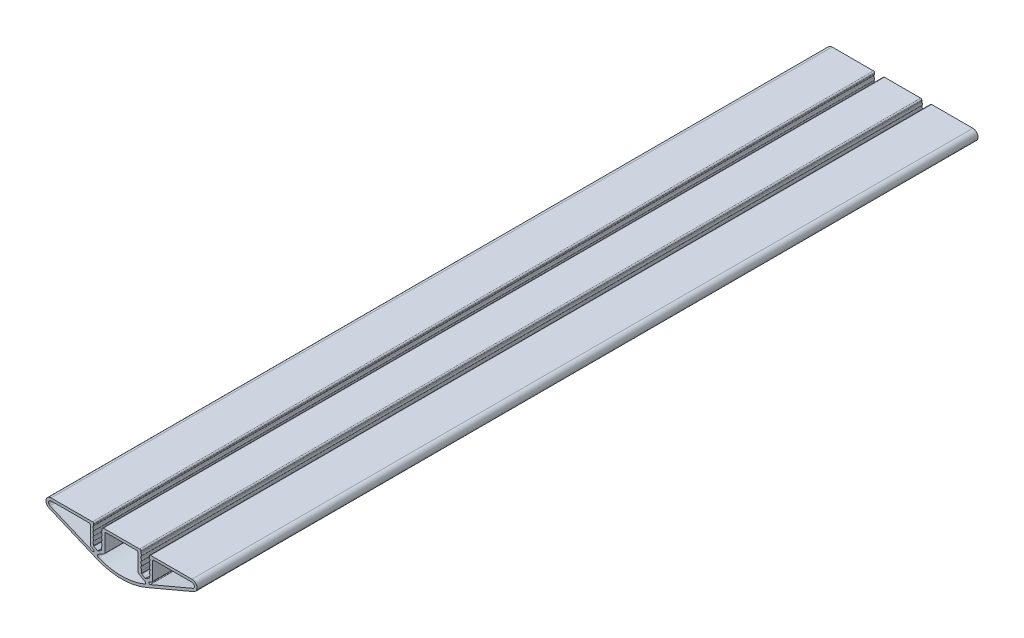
ISO-10303-21;
HEADER;
FILE_DESCRIPTION(('STEP AP214'),'2;1');
FILE_NAME('part.step','',(''),(''),'','','');
FILE_SCHEMA(('AUTOMOTIVE_DESIGN { 1 0 10303 214 1 1 1 1 }'));
ENDSEC;
DATA;
#1=APPLICATION_CONTEXT('core data for automotive mechanical design processes');
#2=APPLICATION_PROTOCOL_DEFINITION('international standard','automotive_design',2000,#1);
#3=PRODUCT_CONTEXT('',#1,'mechanical');
#4=PRODUCT('Part','Part','',(#3));
#5=PRODUCT_RELATED_PRODUCT_CATEGORY('part','',(#4));
#6=PRODUCT_DEFINITION_FORMATION('','',#4);
#7=PRODUCT_DEFINITION_CONTEXT('part definition',#1,'design');
#8=PRODUCT_DEFINITION('design','',#6,#7);
#9=PRODUCT_DEFINITION_SHAPE('','',#8);
#10=(LENGTH_UNIT() NAMED_UNIT(*) SI_UNIT(.MILLI.,.METRE.));
#11=(NAMED_UNIT(*) PLANE_ANGLE_UNIT() SI_UNIT($,.RADIAN.));
#12=(NAMED_UNIT(*) SI_UNIT($,.STERADIAN.) SOLID_ANGLE_UNIT());
#13=UNCERTAINTY_MEASURE_WITH_UNIT(LENGTH_MEASURE(1.E-05),#10,'distance_accuracy_value','');
#14=(GEOMETRIC_REPRESENTATION_CONTEXT(3) GLOBAL_UNCERTAINTY_ASSIGNED_CONTEXT((#13)) GLOBAL_UNIT_ASSIGNED_CONTEXT((#10,
#11,#12)) REPRESENTATION_CONTEXT('',''));
#15=CARTESIAN_POINT('',(0.,0.,0.));
#16=DIRECTION('',(0.,0.,1.));
#17=DIRECTION('',(1.,0.,0.));
#18=AXIS2_PLACEMENT_3D('',#15,#16,#17);
#19=CARTESIAN_POINT('',(474.504802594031,2196.15718930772,300.));
#20=DIRECTION('',(0.,0.,1.));
#21=DIRECTION('',(1.,0.,0.));
#22=AXIS2_PLACEMENT_3D('',#19,#20,#21);
#23=PLANE('',#22);
#24=CARTESIAN_POINT('',(474.504802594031,2196.15718930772,300.));
#25=DIRECTION('',(0.,0.,1.));
#26=DIRECTION('',(1.,0.,0.));
#27=AXIS2_PLACEMENT_3D('',#24,#25,#26);
#28=CIRCLE('',#27,1.96576872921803);
#29=CARTESIAN_POINT('',(475.271878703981,2194.34726087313,300.));
#30=VERTEX_POINT('',#29);
#31=CARTESIAN_POINT('',(474.504802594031,2198.12295803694,300.));
#32=VERTEX_POINT('',#31);
#33=EDGE_CURVE('E815',#30,#32,#28,.T.);
#34=ORIENTED_EDGE('',*,*,#33,.T.);
#35=DIRECTION('',(-1.,0.,0.));
#36=VECTOR('',#35,1.);
#37=CARTESIAN_POINT('',(474.504802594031,2198.12295803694,300.));
#38=LINE('',#37,#36);
#39=CARTESIAN_POINT('',(458.651125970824,2198.12295803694,300.));
#40=VERTEX_POINT('',#39);
#41=EDGE_CURVE('E818',#32,#40,#38,.T.);
#42=ORIENTED_EDGE('',*,*,#41,.T.);
#43=CARTESIAN_POINT('',(458.651125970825,2197.62295803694,300.));
#44=DIRECTION('',(0.,0.,1.));
#45=DIRECTION('',(1.,0.,0.));
#46=AXIS2_PLACEMENT_3D('',#43,#44,#45);
#47=CIRCLE('',#46,0.499999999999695);
#48=CARTESIAN_POINT('',(458.151125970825,2197.62295803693,300.));
#49=VERTEX_POINT('',#48);
#50=EDGE_CURVE('E821',#40,#49,#47,.T.);
#51=ORIENTED_EDGE('',*,*,#50,.T.);
#52=DIRECTION('',(8.14163551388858E-12,-1.,0.));
#53=VECTOR('',#52,1.);
#54=CARTESIAN_POINT('',(458.151125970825,2197.62295803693,300.));
#55=LINE('',#54,#53);
#56=CARTESIAN_POINT('',(458.151125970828,2197.32295803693,300.));
#57=VERTEX_POINT('',#56);
#58=EDGE_CURVE('E823',#49,#57,#55,.T.);
#59=ORIENTED_EDGE('',*,*,#58,.T.);
#60=CARTESIAN_POINT('',(458.951125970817,2197.32295803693,300.));
#61=DIRECTION('',(0.,0.,1.));
#62=DIRECTION('',(1.,0.,0.));
#63=AXIS2_PLACEMENT_3D('',#60,#61,#62);
#64=CIRCLE('',#63,0.799999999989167);
#65=CARTESIAN_POINT('',(458.315451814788,2196.83724375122,300.));
#66=VERTEX_POINT('',#65);
#67=EDGE_CURVE('E825',#57,#66,#64,.T.);
#68=ORIENTED_EDGE('',*,*,#67,.T.);
#69=CARTESIAN_POINT('',(457.838696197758,2196.47295803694,300.));
#70=DIRECTION('',(0.,0.,-1.));
#71=DIRECTION('',(1.,0.,0.));
#72=AXIS2_PLACEMENT_3D('',#69,#70,#71);
#73=CIRCLE('',#72,0.600000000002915);
#74=CARTESIAN_POINT('',(458.315451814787,2196.10867232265,300.));
#75=VERTEX_POINT('',#74);
#76=EDGE_CURVE('E827',#66,#75,#73,.T.);
#77=ORIENTED_EDGE('',*,*,#76,.T.);
#78=CARTESIAN_POINT('',(458.951125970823,2195.62295803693,300.));
#79=DIRECTION('',(0.,0.,1.));
#80=DIRECTION('',(1.,0.,0.));
#81=AXIS2_PLACEMENT_3D('',#78,#79,#80);
#82=CIRCLE('',#81,0.800000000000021);
#83=CARTESIAN_POINT('',(458.315451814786,2195.13724375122,300.));
#84=VERTEX_POINT('',#83);
#85=EDGE_CURVE('E829',#75,#84,#82,.T.);
#86=ORIENTED_EDGE('',*,*,#85,.T.);
#87=CARTESIAN_POINT('',(457.838696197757,2194.77295803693,300.));
#88=DIRECTION('',(0.,0.,-1.));
#89=DIRECTION('',(1.,0.,0.));
#90=AXIS2_PLACEMENT_3D('',#87,#88,#89);
#91=CIRCLE('',#90,0.600000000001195);
#92=CARTESIAN_POINT('',(458.315451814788,2194.40867232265,300.));
#93=VERTEX_POINT('',#92);
#94=EDGE_CURVE('E831',#84,#93,#91,.T.);
#95=ORIENTED_EDGE('',*,*,#94,.T.);
#96=CARTESIAN_POINT('',(458.951125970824,2193.92295803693,300.));
#97=DIRECTION('',(0.,0.,1.));
#98=DIRECTION('',(1.,0.,0.));
#99=AXIS2_PLACEMENT_3D('',#96,#97,#98);
#100=CIRCLE('',#99,0.800000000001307);
#101=CARTESIAN_POINT('',(458.315451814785,2193.43724375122,300.));
#102=VERTEX_POINT('',#101);
#103=EDGE_CURVE('E833',#93,#102,#100,.T.);
#104=ORIENTED_EDGE('',*,*,#103,.T.);
#105=CARTESIAN_POINT('',(457.83869619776,2193.07295803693,300.));
#106=DIRECTION('',(0.,0.,-1.));
#107=DIRECTION('',(1.,0.,0.));
#108=AXIS2_PLACEMENT_3D('',#105,#106,#107);
#109=CIRCLE('',#108,0.599999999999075);
#110=CARTESIAN_POINT('',(458.315451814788,2192.70867232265,300.));
#111=VERTEX_POINT('',#110);
#112=EDGE_CURVE('E835',#102,#111,#109,.T.);
#113=ORIENTED_EDGE('',*,*,#112,.T.);
#114=CARTESIAN_POINT('',(458.951125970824,2192.22295803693,300.));
#115=DIRECTION('',(0.,0.,1.));
#116=DIRECTION('',(1.,0.,0.));
#117=AXIS2_PLACEMENT_3D('',#114,#115,#116);
#118=CIRCLE('',#117,0.79999999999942);
#119=CARTESIAN_POINT('',(458.315451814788,2191.73724375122,300.));
#120=VERTEX_POINT('',#119);
#121=EDGE_CURVE('E837',#111,#120,#118,.T.);
#122=ORIENTED_EDGE('',*,*,#121,.T.);
#123=CARTESIAN_POINT('',(457.838696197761,2191.37295803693,300.));
#124=DIRECTION('',(0.,0.,-1.));
#125=DIRECTION('',(1.,0.,0.));
#126=AXIS2_PLACEMENT_3D('',#123,#124,#125);
#127=CIRCLE('',#126,0.599999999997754);
#128=CARTESIAN_POINT('',(458.315451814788,2191.00867232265,300.));
#129=VERTEX_POINT('',#128);
#130=EDGE_CURVE('E839',#120,#129,#127,.T.);
#131=ORIENTED_EDGE('',*,*,#130,.T.);
#132=CARTESIAN_POINT('',(458.951125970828,2190.52295803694,300.));
#133=DIRECTION('',(0.,0.,1.));
#134=DIRECTION('',(1.,0.,0.));
#135=AXIS2_PLACEMENT_3D('',#132,#133,#134);
#136=CIRCLE('',#135,0.799999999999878);
#137=CARTESIAN_POINT('',(458.151125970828,2190.52295803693,300.));
#138=VERTEX_POINT('',#137);
#139=EDGE_CURVE('E841',#129,#138,#136,.T.);
#140=ORIENTED_EDGE('',*,*,#139,.T.);
#141=DIRECTION('',(1.40529173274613E-12,-1.,0.));
#142=VECTOR('',#141,1.);
#143=CARTESIAN_POINT('',(458.151125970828,2190.52295803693,300.));
#144=LINE('',#143,#142);
#145=CARTESIAN_POINT('',(458.151125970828,2190.40445349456,300.));
#146=VERTEX_POINT('',#145);
#147=EDGE_CURVE('E843',#138,#146,#144,.T.);
#148=ORIENTED_EDGE('',*,*,#147,.T.);
#149=CARTESIAN_POINT('',(457.951125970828,2190.40445349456,300.));
#150=DIRECTION('',(0.,0.,-1.));
#151=DIRECTION('',(1.,0.,0.));
#152=AXIS2_PLACEMENT_3D('',#149,#150,#151);
#153=CIRCLE('',#152,0.199999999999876);
#154=CARTESIAN_POINT('',(458.051125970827,2190.2312484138,300.));
#155=VERTEX_POINT('',#154);
#156=EDGE_CURVE('E845',#146,#155,#153,.T.);
#157=ORIENTED_EDGE('',*,*,#156,.T.);
#158=DIRECTION('',(-0.866025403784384,-0.500000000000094,0.));
#159=VECTOR('',#158,1.);
#160=CARTESIAN_POINT('',(458.051125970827,2190.2312484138,300.));
#161=LINE('',#160,#159);
#162=CARTESIAN_POINT('',(456.651125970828,2189.42295803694,300.));
#163=VERTEX_POINT('',#162);
#164=EDGE_CURVE('E847',#155,#163,#161,.T.);
#165=ORIENTED_EDGE('',*,*,#164,.T.);
#166=DIRECTION('',(-0.866025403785,0.499999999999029,0.));
#167=VECTOR('',#166,1.);
#168=CARTESIAN_POINT('',(456.651125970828,2189.42295803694,300.));
#169=LINE('',#168,#167);
#170=CARTESIAN_POINT('',(455.201125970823,2190.26011592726,300.));
#171=VERTEX_POINT('',#170);
#172=EDGE_CURVE('E849',#163,#171,#169,.T.);
#173=ORIENTED_EDGE('',*,*,#172,.T.);
#174=CARTESIAN_POINT('',(455.251125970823,2190.34671846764,300.));
#175=DIRECTION('',(0.,0.,-1.));
#176=DIRECTION('',(1.,0.,0.));
#177=AXIS2_PLACEMENT_3D('',#174,#175,#176);
#178=CIRCLE('',#177,0.0999999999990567);
#179=CARTESIAN_POINT('',(455.151125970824,2190.34671846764,300.));
#180=VERTEX_POINT('',#179);
#181=EDGE_CURVE('E851',#171,#180,#178,.T.);
#182=ORIENTED_EDGE('',*,*,#181,.T.);
#183=DIRECTION('',(0.,1.,0.));
#184=VECTOR('',#183,1.);
#185=CARTESIAN_POINT('',(455.151125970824,2190.34671846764,300.));
#186=LINE('',#185,#184);
#187=CARTESIAN_POINT('',(455.151125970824,2191.37295803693,300.));
#188=VERTEX_POINT('',#187);
#189=EDGE_CURVE('E853',#180,#188,#186,.T.);
#190=ORIENTED_EDGE('',*,*,#189,.T.);
#191=CARTESIAN_POINT('',(454.351125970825,2191.37295803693,300.));
#192=DIRECTION('',(0.,0.,1.));
#193=DIRECTION('',(1.,0.,0.));
#194=AXIS2_PLACEMENT_3D('',#191,#192,#193);
#195=CIRCLE('',#194,0.799999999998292);
#196=CARTESIAN_POINT('',(454.986800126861,2191.85867232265,300.));
#197=VERTEX_POINT('',#196);
#198=EDGE_CURVE('E855',#188,#197,#195,.T.);
#199=ORIENTED_EDGE('',*,*,#198,.T.);
#200=CARTESIAN_POINT('',(455.463555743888,2192.22295803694,300.));
#201=DIRECTION('',(0.,0.,-1.));
#202=DIRECTION('',(1.,0.,0.));
#203=AXIS2_PLACEMENT_3D('',#200,#201,#202);
#204=CIRCLE('',#203,0.60000000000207);
#205=CARTESIAN_POINT('',(454.986800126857,2192.58724375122,300.));
#206=VERTEX_POINT('',#205);
#207=EDGE_CURVE('E857',#197,#206,#204,.T.);
#208=ORIENTED_EDGE('',*,*,#207,.T.);
#209=CARTESIAN_POINT('',(454.351125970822,2193.07295803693,300.));
#210=DIRECTION('',(0.,0.,1.));
#211=DIRECTION('',(1.,0.,0.));
#212=AXIS2_PLACEMENT_3D('',#209,#210,#211);
#213=CIRCLE('',#212,0.799999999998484);
#214=CARTESIAN_POINT('',(454.986800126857,2193.55867232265,300.));
#215=VERTEX_POINT('',#214);
#216=EDGE_CURVE('E859',#206,#215,#213,.T.);
#217=ORIENTED_EDGE('',*,*,#216,.T.);
#218=CARTESIAN_POINT('',(455.463555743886,2193.92295803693,300.));
#219=DIRECTION('',(0.,0.,-1.));
#220=DIRECTION('',(1.,0.,0.));
#221=AXIS2_PLACEMENT_3D('',#218,#219,#220);
#222=CIRCLE('',#221,0.600000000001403);
#223=CARTESIAN_POINT('',(454.986800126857,2194.28724375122,300.));
#224=VERTEX_POINT('',#223);
#225=EDGE_CURVE('E861',#215,#224,#222,.T.);
#226=ORIENTED_EDGE('',*,*,#225,.T.);
#227=CARTESIAN_POINT('',(454.35112597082,2194.77295803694,300.));
#228=DIRECTION('',(0.,0.,1.));
#229=DIRECTION('',(1.,0.,0.));
#230=AXIS2_PLACEMENT_3D('',#227,#228,#229);
#231=CIRCLE('',#230,0.800000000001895);
#232=CARTESIAN_POINT('',(454.986800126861,2195.25867232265,300.));
#233=VERTEX_POINT('',#232);
#234=EDGE_CURVE('E863',#224,#233,#231,.T.);
#235=ORIENTED_EDGE('',*,*,#234,.T.);
#236=CARTESIAN_POINT('',(455.463555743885,2195.62295803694,300.));
#237=DIRECTION('',(0.,0.,-1.));
#238=DIRECTION('',(1.,0.,0.));
#239=AXIS2_PLACEMENT_3D('',#236,#237,#238);
#240=CIRCLE('',#239,0.599999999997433);
#241=CARTESIAN_POINT('',(454.986800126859,2195.98724375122,300.));
#242=VERTEX_POINT('',#241);
#243=EDGE_CURVE('E865',#233,#242,#240,.T.);
#244=ORIENTED_EDGE('',*,*,#243,.T.);
#245=CARTESIAN_POINT('',(454.351125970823,2196.47295803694,300.));
#246=DIRECTION('',(0.,0.,1.));
#247=DIRECTION('',(1.,0.,0.));
#248=AXIS2_PLACEMENT_3D('',#245,#246,#247);
#249=CIRCLE('',#248,0.800000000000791);
#250=CARTESIAN_POINT('',(455.011436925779,2196.92460994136,300.));
#251=VERTEX_POINT('',#250);
#252=EDGE_CURVE('E867',#242,#251,#249,.T.);
#253=ORIENTED_EDGE('',*,*,#252,.T.);
#254=CARTESIAN_POINT('',(455.506670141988,2197.26334886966,300.));
#255=DIRECTION('',(0.,0.,-1.));
#256=DIRECTION('',(1.,0.,0.));
#257=AXIS2_PLACEMENT_3D('',#254,#255,#256);
#258=CIRCLE('',#257,0.59999999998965);
#259=CARTESIAN_POINT('',(454.906670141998,2197.26334886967,300.));
#260=VERTEX_POINT('',#259);
#261=EDGE_CURVE('E869',#251,#260,#258,.T.);
#262=ORIENTED_EDGE('',*,*,#261,.T.);
#263=DIRECTION('',(9.10754847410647E-12,1.,0.));
#264=VECTOR('',#263,1.);
#265=CARTESIAN_POINT('',(454.906670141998,2197.26334886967,300.));
#266=LINE('',#265,#264);
#267=CARTESIAN_POINT('',(454.906670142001,2197.62295803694,300.));
#268=VERTEX_POINT('',#267);
#269=EDGE_CURVE('E871',#260,#268,#266,.T.);
#270=ORIENTED_EDGE('',*,*,#269,.T.);
#271=CARTESIAN_POINT('',(454.406670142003,2197.62295803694,300.));
#272=DIRECTION('',(0.,0.,1.));
#273=DIRECTION('',(1.,0.,0.));
#274=AXIS2_PLACEMENT_3D('',#271,#272,#273);
#275=CIRCLE('',#274,0.499999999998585);
#276=CARTESIAN_POINT('',(454.406670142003,2198.12295803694,300.));
#277=VERTEX_POINT('',#276);
#278=EDGE_CURVE('E873',#268,#277,#275,.T.);
#279=ORIENTED_EDGE('',*,*,#278,.T.);
#280=DIRECTION('',(-1.,0.,0.));
#281=VECTOR('',#280,1.);
#282=CARTESIAN_POINT('',(454.406670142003,2198.12295803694,300.));
#283=LINE('',#282,#281);
#284=CARTESIAN_POINT('',(440.534472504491,2198.12295803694,300.));
#285=VERTEX_POINT('',#284);
#286=EDGE_CURVE('E875',#277,#285,#283,.T.);
#287=ORIENTED_EDGE('',*,*,#286,.T.);
#288=CARTESIAN_POINT('',(440.534472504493,2197.62295803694,300.));
#289=DIRECTION('',(0.,0.,1.));
#290=DIRECTION('',(1.,0.,0.));
#291=AXIS2_PLACEMENT_3D('',#288,#289,#290);
#292=CIRCLE('',#291,0.499999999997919);
#293=CARTESIAN_POINT('',(440.034472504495,2197.62295803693,300.));
#294=VERTEX_POINT('',#293);
#295=EDGE_CURVE('E877',#285,#294,#292,.T.);
#296=ORIENTED_EDGE('',*,*,#295,.T.);
#297=DIRECTION('',(0.,-1.,0.));
#298=VECTOR('',#297,1.);
#299=CARTESIAN_POINT('',(440.034472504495,2197.62295803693,300.));
#300=LINE('',#299,#298);
#301=CARTESIAN_POINT('',(440.034472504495,2197.26334886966,300.));
#302=VERTEX_POINT('',#301);
#303=EDGE_CURVE('E879',#294,#302,#300,.T.);
#304=ORIENTED_EDGE('',*,*,#303,.T.);
#305=CARTESIAN_POINT('',(439.434472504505,2197.26334886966,300.));
#306=DIRECTION('',(0.,0.,-1.));
#307=DIRECTION('',(1.,0.,0.));
#308=AXIS2_PLACEMENT_3D('',#305,#306,#307);
#309=CIRCLE('',#308,0.599999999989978);
#310=CARTESIAN_POINT('',(439.929705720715,2196.92460994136,300.));
#311=VERTEX_POINT('',#310);
#312=EDGE_CURVE('E881',#302,#311,#309,.T.);
#313=ORIENTED_EDGE('',*,*,#312,.T.);
#314=CARTESIAN_POINT('',(440.590016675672,2196.47295803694,300.));
#315=DIRECTION('',(0.,0.,1.));
#316=DIRECTION('',(1.,0.,0.));
#317=AXIS2_PLACEMENT_3D('',#314,#315,#316);
#318=CIRCLE('',#317,0.800000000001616);
#319=CARTESIAN_POINT('',(439.954342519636,2195.98724375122,300.));
#320=VERTEX_POINT('',#319);
#321=EDGE_CURVE('E883',#311,#320,#318,.T.);
#322=ORIENTED_EDGE('',*,*,#321,.T.);
#323=CARTESIAN_POINT('',(439.477586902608,2195.62295803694,300.));
#324=DIRECTION('',(0.,0.,-1.));
#325=DIRECTION('',(1.,0.,0.));
#326=AXIS2_PLACEMENT_3D('',#323,#324,#325);
#327=CIRCLE('',#326,0.59999999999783);
#328=CARTESIAN_POINT('',(439.954342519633,2195.25867232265,300.));
#329=VERTEX_POINT('',#328);
#330=EDGE_CURVE('E885',#320,#329,#327,.T.);
#331=ORIENTED_EDGE('',*,*,#330,.T.);
#332=CARTESIAN_POINT('',(440.590016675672,2194.77295803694,300.));
#333=DIRECTION('',(0.,0.,1.));
#334=DIRECTION('',(1.,0.,0.));
#335=AXIS2_PLACEMENT_3D('',#332,#333,#334);
#336=CIRCLE('',#335,0.80000000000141);
#337=CARTESIAN_POINT('',(439.954342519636,2194.28724375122,300.));
#338=VERTEX_POINT('',#337);
#339=EDGE_CURVE('E887',#329,#338,#336,.T.);
#340=ORIENTED_EDGE('',*,*,#339,.T.);
#341=CARTESIAN_POINT('',(439.477586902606,2193.92295803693,300.));
#342=DIRECTION('',(0.,0.,-1.));
#343=DIRECTION('',(1.,0.,0.));
#344=AXIS2_PLACEMENT_3D('',#341,#342,#343);
#345=CIRCLE('',#344,0.600000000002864);
#346=CARTESIAN_POINT('',(439.954342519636,2193.55867232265,300.));
#347=VERTEX_POINT('',#346);
#348=EDGE_CURVE('E889',#338,#347,#345,.T.);
#349=ORIENTED_EDGE('',*,*,#348,.T.);
#350=CARTESIAN_POINT('',(440.590016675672,2193.07295803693,300.));
#351=DIRECTION('',(0.,0.,1.));
#352=DIRECTION('',(1.,0.,0.));
#353=AXIS2_PLACEMENT_3D('',#350,#351,#352);
#354=CIRCLE('',#353,0.799999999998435);
#355=CARTESIAN_POINT('',(439.954342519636,2192.58724375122,300.));
#356=VERTEX_POINT('',#355);
#357=EDGE_CURVE('E891',#347,#356,#354,.T.);
#358=ORIENTED_EDGE('',*,*,#357,.T.);
#359=CARTESIAN_POINT('',(439.477586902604,2192.22295803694,300.));
#360=DIRECTION('',(0.,0.,-1.));
#361=DIRECTION('',(1.,0.,0.));
#362=AXIS2_PLACEMENT_3D('',#359,#360,#361);
#363=CIRCLE('',#362,0.600000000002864);
#364=CARTESIAN_POINT('',(439.954342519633,2191.85867232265,300.));
#365=VERTEX_POINT('',#364);
#366=EDGE_CURVE('E893',#356,#365,#363,.T.);
#367=ORIENTED_EDGE('',*,*,#366,.T.);
#368=CARTESIAN_POINT('',(440.590016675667,2191.37295803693,300.));
#369=DIRECTION('',(0.,0.,1.));
#370=DIRECTION('',(1.,0.,0.));
#371=AXIS2_PLACEMENT_3D('',#368,#369,#370);
#372=CIRCLE('',#371,0.799999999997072);
#373=CARTESIAN_POINT('',(439.79001667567,2191.37295803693,300.));
#374=VERTEX_POINT('',#373);
#375=EDGE_CURVE('E895',#365,#374,#372,.T.);
#376=ORIENTED_EDGE('',*,*,#375,.T.);
#377=DIRECTION('',(0.,-1.,0.));
#378=VECTOR('',#377,1.);
#379=CARTESIAN_POINT('',(439.79001667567,2191.37295803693,300.));
#380=LINE('',#379,#378);
#381=CARTESIAN_POINT('',(439.79001667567,2190.34671846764,300.));
#382=VERTEX_POINT('',#381);
#383=EDGE_CURVE('E897',#374,#382,#380,.T.);
#384=ORIENTED_EDGE('',*,*,#383,.T.);
#385=CARTESIAN_POINT('',(439.690016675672,2190.34671846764,300.));
#386=DIRECTION('',(0.,0.,-1.));
#387=DIRECTION('',(1.,0.,0.));
#388=AXIS2_PLACEMENT_3D('',#385,#386,#387);
#389=CIRCLE('',#388,0.0999999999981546);
#390=CARTESIAN_POINT('',(439.74001667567,2190.26011592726,300.));
#391=VERTEX_POINT('',#390);
#392=EDGE_CURVE('E899',#382,#391,#389,.T.);
#393=ORIENTED_EDGE('',*,*,#392,.T.);
#394=DIRECTION('',(-0.86602540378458,-0.499999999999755,0.));
#395=VECTOR('',#394,1.);
#396=CARTESIAN_POINT('',(439.74001667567,2190.26011592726,300.));
#397=LINE('',#396,#395);
#398=CARTESIAN_POINT('',(438.290016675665,2189.42295803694,300.));
#399=VERTEX_POINT('',#398);
#400=EDGE_CURVE('E901',#391,#399,#397,.T.);
#401=ORIENTED_EDGE('',*,*,#400,.T.);
#402=DIRECTION('',(-0.866025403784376,0.500000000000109,0.));
#403=VECTOR('',#402,1.);
#404=CARTESIAN_POINT('',(438.290016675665,2189.42295803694,300.));
#405=LINE('',#404,#403);
#406=CARTESIAN_POINT('',(436.890016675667,2190.2312484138,300.));
#407=VERTEX_POINT('',#406);
#408=EDGE_CURVE('E903',#399,#407,#405,.T.);
#409=ORIENTED_EDGE('',*,*,#408,.T.);
#410=CARTESIAN_POINT('',(436.990016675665,2190.40445349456,300.));
#411=DIRECTION('',(0.,0.,-1.));
#412=DIRECTION('',(1.,0.,0.));
#413=AXIS2_PLACEMENT_3D('',#410,#411,#412);
#414=CIRCLE('',#413,0.200000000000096);
#415=CARTESIAN_POINT('',(436.790016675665,2190.40445349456,300.));
#416=VERTEX_POINT('',#415);
#417=EDGE_CURVE('E905',#407,#416,#414,.T.);
#418=ORIENTED_EDGE('',*,*,#417,.T.);
#419=DIRECTION('',(0.,1.,0.));
#420=VECTOR('',#419,1.);
#421=CARTESIAN_POINT('',(436.790016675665,2190.40445349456,300.));
#422=LINE('',#421,#420);
#423=CARTESIAN_POINT('',(436.790016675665,2190.52295803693,300.));
#424=VERTEX_POINT('',#423);
#425=EDGE_CURVE('E907',#416,#424,#422,.T.);
#426=ORIENTED_EDGE('',*,*,#425,.T.);
#427=CARTESIAN_POINT('',(435.990016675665,2190.52295803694,300.));
#428=DIRECTION('',(0.,0.,1.));
#429=DIRECTION('',(1.,0.,0.));
#430=AXIS2_PLACEMENT_3D('',#427,#428,#429);
#431=CIRCLE('',#430,0.800000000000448);
#432=CARTESIAN_POINT('',(436.625690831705,2191.00867232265,300.));
#433=VERTEX_POINT('',#432);
#434=EDGE_CURVE('E909',#424,#433,#431,.T.);
#435=ORIENTED_EDGE('',*,*,#434,.T.);
#436=CARTESIAN_POINT('',(437.102446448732,2191.37295803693,300.));
#437=DIRECTION('',(0.,0.,-1.));
#438=DIRECTION('',(1.,0.,0.));
#439=AXIS2_PLACEMENT_3D('',#436,#437,#438);
#440=CIRCLE('',#439,0.599999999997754);
#441=CARTESIAN_POINT('',(436.625690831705,2191.73724375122,300.));
#442=VERTEX_POINT('',#441);
#443=EDGE_CURVE('E911',#433,#442,#440,.T.);
#444=ORIENTED_EDGE('',*,*,#443,.T.);
#445=CARTESIAN_POINT('',(435.990016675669,2192.22295803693,300.));
#446=DIRECTION('',(0.,0.,1.));
#447=DIRECTION('',(1.,0.,0.));
#448=AXIS2_PLACEMENT_3D('',#445,#446,#447);
#449=CIRCLE('',#448,0.799999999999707);
#450=CARTESIAN_POINT('',(436.625690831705,2192.70867232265,300.));
#451=VERTEX_POINT('',#450);
#452=EDGE_CURVE('E913',#442,#451,#449,.T.);
#453=ORIENTED_EDGE('',*,*,#452,.T.);
#454=CARTESIAN_POINT('',(437.102446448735,2193.07295803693,300.));
#455=DIRECTION('',(0.,0.,-1.));
#456=DIRECTION('',(1.,0.,0.));
#457=AXIS2_PLACEMENT_3D('',#454,#455,#456);
#458=CIRCLE('',#457,0.600000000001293);
#459=CARTESIAN_POINT('',(436.625690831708,2193.43724375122,300.));
#460=VERTEX_POINT('',#459);
#461=EDGE_CURVE('E915',#451,#460,#458,.T.);
#462=ORIENTED_EDGE('',*,*,#461,.T.);
#463=CARTESIAN_POINT('',(435.99001667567,2193.92295803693,300.));
#464=DIRECTION('',(0.,0.,1.));
#465=DIRECTION('',(1.,0.,0.));
#466=AXIS2_PLACEMENT_3D('',#463,#464,#465);
#467=CIRCLE('',#466,0.799999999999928);
#468=CARTESIAN_POINT('',(436.625690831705,2194.40867232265,300.));
#469=VERTEX_POINT('',#468);
#470=EDGE_CURVE('E917',#460,#469,#467,.T.);
#471=ORIENTED_EDGE('',*,*,#470,.T.);
#472=CARTESIAN_POINT('',(437.102446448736,2194.77295803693,300.));
#473=DIRECTION('',(0.,0.,-1.));
#474=DIRECTION('',(1.,0.,0.));
#475=AXIS2_PLACEMENT_3D('',#472,#473,#474);
#476=CIRCLE('',#475,0.600000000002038);
#477=CARTESIAN_POINT('',(436.625690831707,2195.13724375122,300.));
#478=VERTEX_POINT('',#477);
#479=EDGE_CURVE('E919',#469,#478,#476,.T.);
#480=ORIENTED_EDGE('',*,*,#479,.T.);
#481=CARTESIAN_POINT('',(435.99001667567,2195.62295803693,300.));
#482=DIRECTION('',(0.,0.,1.));
#483=DIRECTION('',(1.,0.,0.));
#484=AXIS2_PLACEMENT_3D('',#481,#482,#483);
#485=CIRCLE('',#484,0.799999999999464);
#486=CARTESIAN_POINT('',(436.625690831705,2196.10867232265,300.));
#487=VERTEX_POINT('',#486);
#488=EDGE_CURVE('E921',#478,#487,#485,.T.);
#489=ORIENTED_EDGE('',*,*,#488,.T.);
#490=CARTESIAN_POINT('',(437.102446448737,2196.47295803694,300.));
#491=DIRECTION('',(0.,0.,-1.));
#492=DIRECTION('',(1.,0.,0.));
#493=AXIS2_PLACEMENT_3D('',#490,#491,#492);
#494=CIRCLE('',#493,0.600000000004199);
#495=CARTESIAN_POINT('',(436.625690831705,2196.83724375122,300.));
#496=VERTEX_POINT('',#495);
#497=EDGE_CURVE('E923',#487,#496,#494,.T.);
#498=ORIENTED_EDGE('',*,*,#497,.T.);
#499=CARTESIAN_POINT('',(435.990016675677,2197.32295803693,300.));
#500=DIRECTION('',(0.,0.,1.));
#501=DIRECTION('',(1.,0.,0.));
#502=AXIS2_PLACEMENT_3D('',#499,#500,#501);
#503=CIRCLE('',#502,0.799999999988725);
#504=CARTESIAN_POINT('',(436.790016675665,2197.32295803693,300.));
#505=VERTEX_POINT('',#504);
#506=EDGE_CURVE('E925',#496,#505,#503,.T.);
#507=ORIENTED_EDGE('',*,*,#506,.T.);
#508=DIRECTION('',(9.25185853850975E-12,1.,0.));
#509=VECTOR('',#508,1.);
#510=CARTESIAN_POINT('',(436.790016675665,2197.32295803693,300.));
#511=LINE('',#510,#509);
#512=CARTESIAN_POINT('',(436.790016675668,2197.62295803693,300.));
#513=VERTEX_POINT('',#512);
#514=EDGE_CURVE('E927',#505,#513,#511,.T.);
#515=ORIENTED_EDGE('',*,*,#514,.T.);
#516=CARTESIAN_POINT('',(436.290016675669,2197.62295803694,300.));
#517=DIRECTION('',(0.,0.,1.));
#518=DIRECTION('',(1.,0.,0.));
#519=AXIS2_PLACEMENT_3D('',#516,#517,#518);
#520=CIRCLE('',#519,0.499999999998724);
#521=CARTESIAN_POINT('',(436.290016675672,2198.12295803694,300.));
#522=VERTEX_POINT('',#521);
#523=EDGE_CURVE('E929',#513,#522,#520,.T.);
#524=ORIENTED_EDGE('',*,*,#523,.T.);
#525=DIRECTION('',(-1.,0.,0.));
#526=VECTOR('',#525,1.);
#527=CARTESIAN_POINT('',(436.290016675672,2198.12295803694,300.));
#528=LINE('',#527,#526);
#529=CARTESIAN_POINT('',(420.436340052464,2198.12295803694,300.));
#530=VERTEX_POINT('',#529);
#531=EDGE_CURVE('E931',#522,#530,#528,.T.);
#532=ORIENTED_EDGE('',*,*,#531,.T.);
#533=CARTESIAN_POINT('',(420.436340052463,2196.15718930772,300.));
#534=DIRECTION('',(0.,0.,1.));
#535=DIRECTION('',(1.,0.,0.));
#536=AXIS2_PLACEMENT_3D('',#533,#534,#535);
#537=CIRCLE('',#536,1.96576872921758);
#538=CARTESIAN_POINT('',(419.669263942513,2194.34726087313,300.));
#539=VERTEX_POINT('',#538);
#540=EDGE_CURVE('E933',#530,#539,#537,.T.);
#541=ORIENTED_EDGE('',*,*,#540,.T.);
#542=DIRECTION('',(0.920722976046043,-0.390216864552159,0.));
#543=VECTOR('',#542,1.);
#544=CARTESIAN_POINT('',(419.669263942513,2194.34726087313,300.));
#545=LINE('',#544,#543);
#546=CARTESIAN_POINT('',(437.917702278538,2186.61328596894,300.));
#547=VERTEX_POINT('',#546);
#548=EDGE_CURVE('E935',#539,#547,#545,.T.);
#549=ORIENTED_EDGE('',*,*,#548,.T.);
#550=CARTESIAN_POINT('',(447.470571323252,2209.15343432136,300.));
#551=DIRECTION('',(0.,0.,1.));
#552=DIRECTION('',(1.,0.,0.));
#553=AXIS2_PLACEMENT_3D('',#550,#551,#552);
#554=CIRCLE('',#553,24.4809230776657);
#555=CARTESIAN_POINT('',(457.023440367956,2186.61328596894,300.));
#556=VERTEX_POINT('',#555);
#557=EDGE_CURVE('E937',#547,#556,#554,.T.);
#558=ORIENTED_EDGE('',*,*,#557,.T.);
#559=DIRECTION('',(0.920722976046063,0.390216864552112,0.));
#560=VECTOR('',#559,1.);
#561=CARTESIAN_POINT('',(457.023440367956,2186.61328596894,300.));
#562=LINE('',#561,#560);
#563=EDGE_CURVE('E939',#556,#30,#562,.T.);
#564=ORIENTED_EDGE('',*,*,#563,.T.);
#565=EDGE_LOOP('',(#34,#42,#51,#59,#68,#77,#86,#95,#104,#113,#122,#131,#140,#148,#157,#165,#173,
#182,#190,#199,#208,#217,#226,#235,#244,#253,#262,#270,#279,#287,#296,#304,#313,#322,#331,#340,
#349,#358,#367,#376,#384,#393,#401,#409,#418,#426,#435,#444,#453,#462,#471,#480,#489,#498,#507,
#515,#524,#532,#541,#549,#558,#564));
#566=FACE_BOUND('',#565,.T.);
#567=DIRECTION('',(-1.,0.,0.));
#568=VECTOR('',#567,1.);
#569=CARTESIAN_POINT('',(453.363555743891,2197.12295803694,300.));
#570=LINE('',#569,#568);
#571=CARTESIAN_POINT('',(453.363555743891,2197.12295803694,300.));
#572=VERTEX_POINT('',#571);
#573=CARTESIAN_POINT('',(441.577586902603,2197.12295803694,300.));
#574=VERTEX_POINT('',#573);
#575=EDGE_CURVE('E730',#572,#574,#570,.T.);
#576=ORIENTED_EDGE('',*,*,#575,.F.);
#577=CARTESIAN_POINT('',(453.36355574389,2196.62295803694,300.));
#578=DIRECTION('',(0.,0.,1.));
#579=DIRECTION('',(1.,0.,0.));
#580=AXIS2_PLACEMENT_3D('',#577,#578,#579);
#581=CIRCLE('',#580,0.499999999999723);
#582=CARTESIAN_POINT('',(453.863555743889,2196.62295803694,300.));
#583=VERTEX_POINT('',#582);
#584=EDGE_CURVE('E728',#583,#572,#581,.T.);
#585=ORIENTED_EDGE('',*,*,#584,.F.);
#586=DIRECTION('',(0.,1.,0.));
#587=VECTOR('',#586,1.);
#588=CARTESIAN_POINT('',(453.863555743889,2189.9931319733,300.));
#589=LINE('',#588,#587);
#590=CARTESIAN_POINT('',(453.863555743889,2189.9931319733,300.));
#591=VERTEX_POINT('',#590);
#592=EDGE_CURVE('E752',#591,#583,#589,.T.);
#593=ORIENTED_EDGE('',*,*,#592,.F.);
#594=CARTESIAN_POINT('',(454.063555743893,2189.9931319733,300.));
#595=DIRECTION('',(0.,0.,-1.));
#596=DIRECTION('',(1.,0.,0.));
#597=AXIS2_PLACEMENT_3D('',#594,#595,#596);
#598=CIRCLE('',#597,0.200000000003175);
#599=CARTESIAN_POINT('',(453.963555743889,2189.81992689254,300.));
#600=VERTEX_POINT('',#599);
#601=EDGE_CURVE('E749',#600,#591,#598,.T.);
#602=ORIENTED_EDGE('',*,*,#601,.F.);
#603=DIRECTION('',(-0.866025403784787,0.499999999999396,0.));
#604=VECTOR('',#603,1.);
#605=CARTESIAN_POINT('',(456.506908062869,2188.35152174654,300.));
#606=LINE('',#605,#604);
#607=CARTESIAN_POINT('',(456.506908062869,2188.35152174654,300.));
#608=VERTEX_POINT('',#607);
#609=EDGE_CURVE('E747',#608,#600,#606,.T.);
#610=ORIENTED_EDGE('',*,*,#609,.F.);
#611=CARTESIAN_POINT('',(456.256908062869,2187.91850904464,300.));
#612=DIRECTION('',(0.,0.,1.));
#613=DIRECTION('',(1.,0.,0.));
#614=AXIS2_PLACEMENT_3D('',#611,#612,#613);
#615=CIRCLE('',#614,0.50000000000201);
#616=CARTESIAN_POINT('',(456.448074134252,2187.45649656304,300.));
#617=VERTEX_POINT('',#616);
#618=EDGE_CURVE('E745',#617,#608,#615,.T.);
#619=ORIENTED_EDGE('',*,*,#618,.F.);
#620=CARTESIAN_POINT('',(447.470571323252,2209.15343432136,300.));
#621=DIRECTION('',(0.,0.,1.));
#622=DIRECTION('',(1.,0.,0.));
#623=AXIS2_PLACEMENT_3D('',#620,#621,#622);
#624=CIRCLE('',#623,23.4808999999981);
#625=CARTESIAN_POINT('',(438.493068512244,2187.45649656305,300.));
#626=VERTEX_POINT('',#625);
#627=EDGE_CURVE('E743',#626,#617,#624,.T.);
#628=ORIENTED_EDGE('',*,*,#627,.F.);
#629=CARTESIAN_POINT('',(438.684234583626,2187.91850904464,300.));
#630=DIRECTION('',(0.,0.,1.));
#631=DIRECTION('',(1.,0.,0.));
#632=AXIS2_PLACEMENT_3D('',#629,#630,#631);
#633=CIRCLE('',#632,0.500000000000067);
#634=CARTESIAN_POINT('',(438.434234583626,2188.35152174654,300.));
#635=VERTEX_POINT('',#634);
#636=EDGE_CURVE('E741',#635,#626,#633,.T.);
#637=ORIENTED_EDGE('',*,*,#636,.F.);
#638=DIRECTION('',(-0.866025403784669,-0.499999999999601,0.));
#639=VECTOR('',#638,1.);
#640=CARTESIAN_POINT('',(440.977586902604,2189.81992689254,300.));
#641=LINE('',#640,#639);
#642=CARTESIAN_POINT('',(440.977586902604,2189.81992689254,300.));
#643=VERTEX_POINT('',#642);
#644=EDGE_CURVE('E739',#643,#635,#641,.T.);
#645=ORIENTED_EDGE('',*,*,#644,.F.);
#646=CARTESIAN_POINT('',(440.8775869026,2189.9931319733,300.));
#647=DIRECTION('',(0.,0.,-1.));
#648=DIRECTION('',(1.,0.,0.));
#649=AXIS2_PLACEMENT_3D('',#646,#647,#648);
#650=CIRCLE('',#649,0.200000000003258);
#651=CARTESIAN_POINT('',(441.077586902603,2189.9931319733,300.));
#652=VERTEX_POINT('',#651);
#653=EDGE_CURVE('E737',#652,#643,#650,.T.);
#654=ORIENTED_EDGE('',*,*,#653,.F.);
#655=DIRECTION('',(0.,-1.,0.));
#656=VECTOR('',#655,1.);
#657=CARTESIAN_POINT('',(441.077586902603,2196.62295803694,300.));
#658=LINE('',#657,#656);
#659=CARTESIAN_POINT('',(441.077586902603,2196.62295803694,300.));
#660=VERTEX_POINT('',#659);
#661=EDGE_CURVE('E735',#660,#652,#658,.T.);
#662=ORIENTED_EDGE('',*,*,#661,.F.);
#663=CARTESIAN_POINT('',(441.577586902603,2196.62295803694,300.));
#664=DIRECTION('',(0.,0.,1.));
#665=DIRECTION('',(1.,0.,0.));
#666=AXIS2_PLACEMENT_3D('',#663,#664,#665);
#667=CIRCLE('',#666,0.499999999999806);
#668=EDGE_CURVE('E733',#574,#660,#667,.T.);
#669=ORIENTED_EDGE('',*,*,#668,.F.);
#670=EDGE_LOOP('',(#576,#585,#593,#602,#610,#619,#628,#637,#645,#654,#662,#669));
#671=FACE_BOUND('',#670,.T.);
#672=DIRECTION('',(-0.90484430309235,0.425742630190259,0.));
#673=VECTOR('',#672,1.);
#674=CARTESIAN_POINT('',(436.694375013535,2189.08313179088,300.));
#675=LINE('',#674,#673);
#676=CARTESIAN_POINT('',(436.694375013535,2189.08313179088,300.));
#677=VERTEX_POINT('',#676);
#678=CARTESIAN_POINT('',(435.674723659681,2189.56289283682,300.));
#679=VERTEX_POINT('',#678);
#680=EDGE_CURVE('E671',#677,#679,#675,.T.);
#681=ORIENTED_EDGE('',*,*,#680,.F.);
#682=CARTESIAN_POINT('',(436.524077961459,2188.72119406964,300.));
#683=DIRECTION('',(0.,0.,1.));
#684=DIRECTION('',(1.,0.,0.));
#685=AXIS2_PLACEMENT_3D('',#682,#683,#684);
#686=CIRCLE('',#685,0.399999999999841);
#687=CARTESIAN_POINT('',(436.437544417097,2188.33066629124,300.));
#688=VERTEX_POINT('',#687);
#689=EDGE_CURVE('E669',#688,#677,#686,.T.);
#690=ORIENTED_EDGE('',*,*,#689,.F.);
#691=DIRECTION('',(0.920803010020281,-0.390027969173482,0.));
#692=VECTOR('',#691,1.);
#693=CARTESIAN_POINT('',(420.059480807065,2195.26798384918,300.));
#694=LINE('',#693,#692);
#695=CARTESIAN_POINT('',(420.059480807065,2195.26798384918,300.));
#696=VERTEX_POINT('',#695);
#697=EDGE_CURVE('E685',#696,#688,#694,.T.);
#698=ORIENTED_EDGE('',*,*,#697,.F.);
#699=CARTESIAN_POINT('',(420.436340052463,2196.15718930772,300.));
#700=DIRECTION('',(0.,0.,1.));
#701=DIRECTION('',(1.,0.,0.));
#702=AXIS2_PLACEMENT_3D('',#699,#700,#701);
#703=CIRCLE('',#702,0.965768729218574);
#704=CARTESIAN_POINT('',(420.436340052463,2197.12295803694,300.));
#705=VERTEX_POINT('',#704);
#706=EDGE_CURVE('E682',#705,#696,#703,.T.);
#707=ORIENTED_EDGE('',*,*,#706,.F.);
#708=DIRECTION('',(-1.,0.,0.));
#709=VECTOR('',#708,1.);
#710=CARTESIAN_POINT('',(435.002446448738,2197.12295803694,300.));
#711=LINE('',#710,#709);
#712=CARTESIAN_POINT('',(435.002446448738,2197.12295803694,300.));
#713=VERTEX_POINT('',#712);
#714=EDGE_CURVE('E680',#713,#705,#711,.T.);
#715=ORIENTED_EDGE('',*,*,#714,.F.);
#716=CARTESIAN_POINT('',(435.002446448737,2196.62295803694,300.));
#717=DIRECTION('',(0.,0.,1.));
#718=DIRECTION('',(1.,0.,0.));
#719=AXIS2_PLACEMENT_3D('',#716,#717,#718);
#720=CIRCLE('',#719,0.500000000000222);
#721=CARTESIAN_POINT('',(435.502446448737,2196.62295803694,300.));
#722=VERTEX_POINT('',#721);
#723=EDGE_CURVE('E678',#722,#713,#720,.T.);
#724=ORIENTED_EDGE('',*,*,#723,.F.);
#725=DIRECTION('',(0.,1.,0.));
#726=VECTOR('',#725,1.);
#727=CARTESIAN_POINT('',(435.502446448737,2189.83434612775,300.));
#728=LINE('',#727,#726);
#729=CARTESIAN_POINT('',(435.502446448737,2189.83434612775,300.));
#730=VERTEX_POINT('',#729);
#731=EDGE_CURVE('E676',#730,#722,#728,.T.);
#732=ORIENTED_EDGE('',*,*,#731,.F.);
#733=CARTESIAN_POINT('',(435.802446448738,2189.83434612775,300.));
#734=DIRECTION('',(0.,0.,-1.));
#735=DIRECTION('',(1.,0.,0.));
#736=AXIS2_PLACEMENT_3D('',#733,#734,#735);
#737=CIRCLE('',#736,0.300000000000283);
#738=EDGE_CURVE('E674',#679,#730,#737,.T.);
#739=ORIENTED_EDGE('',*,*,#738,.F.);
#740=EDGE_LOOP('',(#681,#690,#698,#707,#715,#724,#732,#739));
#741=FACE_BOUND('',#740,.T.);
#742=DIRECTION('',(-1.,0.,0.));
#743=VECTOR('',#742,1.);
#744=CARTESIAN_POINT('',(474.504802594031,2197.12295803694,300.));
#745=LINE('',#744,#743);
#746=CARTESIAN_POINT('',(474.504802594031,2197.12295803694,300.));
#747=VERTEX_POINT('',#746);
#748=CARTESIAN_POINT('',(459.938696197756,2197.12295803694,300.));
#749=VERTEX_POINT('',#748);
#750=EDGE_CURVE('E605',#747,#749,#745,.T.);
#751=ORIENTED_EDGE('',*,*,#750,.F.);
#752=CARTESIAN_POINT('',(474.504802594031,2196.15718930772,300.));
#753=DIRECTION('',(0.,0.,1.));
#754=DIRECTION('',(1.,0.,0.));
#755=AXIS2_PLACEMENT_3D('',#752,#753,#754);
#756=CIRCLE('',#755,0.965768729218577);
#757=CARTESIAN_POINT('',(474.881661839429,2195.26798384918,300.));
#758=VERTEX_POINT('',#757);
#759=EDGE_CURVE('E597',#758,#747,#756,.T.);
#760=ORIENTED_EDGE('',*,*,#759,.F.);
#761=DIRECTION('',(0.920722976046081,0.390216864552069,0.));
#762=VECTOR('',#761,1.);
#763=CARTESIAN_POINT('',(458.523215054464,2188.33501706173,300.));
#764=LINE('',#763,#762);
#765=CARTESIAN_POINT('',(458.523215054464,2188.33501706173,300.));
#766=VERTEX_POINT('',#765);
#767=EDGE_CURVE('E632',#766,#758,#764,.T.);
#768=ORIENTED_EDGE('',*,*,#767,.F.);
#769=DIRECTION('',(0.976276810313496,0.216526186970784,0.));
#770=VECTOR('',#769,1.);
#771=CARTESIAN_POINT('',(458.503598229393,2188.33066629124,300.));
#772=LINE('',#771,#770);
#773=CARTESIAN_POINT('',(458.503598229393,2188.33066629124,300.));
#774=VERTEX_POINT('',#773);
#775=EDGE_CURVE('E630',#774,#766,#772,.T.);
#776=ORIENTED_EDGE('',*,*,#775,.F.);
#777=CARTESIAN_POINT('',(458.417064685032,2188.72119406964,300.));
#778=DIRECTION('',(0.,0.,1.));
#779=DIRECTION('',(1.,0.,0.));
#780=AXIS2_PLACEMENT_3D('',#777,#778,#779);
#781=CIRCLE('',#780,0.400000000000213);
#782=CARTESIAN_POINT('',(458.246767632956,2189.08313179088,300.));
#783=VERTEX_POINT('',#782);
#784=EDGE_CURVE('E628',#783,#774,#781,.T.);
#785=ORIENTED_EDGE('',*,*,#784,.F.);
#786=DIRECTION('',(-0.904844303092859,-0.425742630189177,0.));
#787=VECTOR('',#786,1.);
#788=CARTESIAN_POINT('',(459.266418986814,2189.56289283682,300.));
#789=LINE('',#788,#787);
#790=CARTESIAN_POINT('',(459.266418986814,2189.56289283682,300.));
#791=VERTEX_POINT('',#790);
#792=EDGE_CURVE('E626',#791,#783,#789,.T.);
#793=ORIENTED_EDGE('',*,*,#792,.F.);
#794=CARTESIAN_POINT('',(459.138696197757,2189.83434612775,300.));
#795=DIRECTION('',(0.,0.,-1.));
#796=DIRECTION('',(1.,0.,0.));
#797=AXIS2_PLACEMENT_3D('',#794,#795,#796);
#798=CIRCLE('',#797,0.30000000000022);
#799=CARTESIAN_POINT('',(459.438696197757,2189.83434612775,300.));
#800=VERTEX_POINT('',#799);
#801=EDGE_CURVE('E624',#800,#791,#798,.T.);
#802=ORIENTED_EDGE('',*,*,#801,.F.);
#803=DIRECTION('',(0.,-1.,0.));
#804=VECTOR('',#803,1.);
#805=CARTESIAN_POINT('',(459.438696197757,2196.62295803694,300.));
#806=LINE('',#805,#804);
#807=CARTESIAN_POINT('',(459.438696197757,2196.62295803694,300.));
#808=VERTEX_POINT('',#807);
#809=EDGE_CURVE('E620',#808,#800,#806,.T.);
#810=ORIENTED_EDGE('',*,*,#809,.F.);
#811=CARTESIAN_POINT('',(459.938696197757,2196.62295803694,300.));
#812=DIRECTION('',(0.,0.,1.));
#813=DIRECTION('',(1.,0.,0.));
#814=AXIS2_PLACEMENT_3D('',#811,#812,#813);
#815=CIRCLE('',#814,0.499999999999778);
#816=EDGE_CURVE('E618',#749,#808,#815,.T.);
#817=ORIENTED_EDGE('',*,*,#816,.F.);
#818=EDGE_LOOP('',(#751,#760,#768,#776,#785,#793,#802,#810,#817));
#819=FACE_BOUND('',#818,.T.);
#820=ADVANCED_FACE('F34',(#566,#671,#741,#819),#23,.T.);
#821=CARTESIAN_POINT('',(474.504802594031,2196.15718930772,0.));
#822=DIRECTION('',(0.,0.,1.));
#823=DIRECTION('',(1.,0.,0.));
#824=AXIS2_PLACEMENT_3D('',#821,#822,#823);
#825=PLANE('',#824);
#826=CARTESIAN_POINT('',(436.524077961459,2188.72119406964,0.));
#827=DIRECTION('',(0.,0.,1.));
#828=DIRECTION('',(1.,0.,0.));
#829=AXIS2_PLACEMENT_3D('',#826,#827,#828);
#830=CIRCLE('',#829,0.399999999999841);
#831=CARTESIAN_POINT('',(436.437544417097,2188.33066629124,0.));
#832=VERTEX_POINT('',#831);
#833=CARTESIAN_POINT('',(436.694375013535,2189.08313179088,0.));
#834=VERTEX_POINT('',#833);
#835=EDGE_CURVE('E613',#832,#834,#830,.T.);
#836=ORIENTED_EDGE('',*,*,#835,.T.);
#837=DIRECTION('',(-0.90484430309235,0.425742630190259,0.));
#838=VECTOR('',#837,1.);
#839=CARTESIAN_POINT('',(436.694375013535,2189.08313179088,0.));
#840=LINE('',#839,#838);
#841=CARTESIAN_POINT('',(435.674723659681,2189.56289283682,0.));
#842=VERTEX_POINT('',#841);
#843=EDGE_CURVE('E690',#834,#842,#840,.T.);
#844=ORIENTED_EDGE('',*,*,#843,.T.);
#845=CARTESIAN_POINT('',(435.802446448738,2189.83434612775,0.));
#846=DIRECTION('',(0.,0.,-1.));
#847=DIRECTION('',(1.,0.,0.));
#848=AXIS2_PLACEMENT_3D('',#845,#846,#847);
#849=CIRCLE('',#848,0.300000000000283);
#850=CARTESIAN_POINT('',(435.502446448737,2189.83434612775,0.));
#851=VERTEX_POINT('',#850);
#852=EDGE_CURVE('E693',#842,#851,#849,.T.);
#853=ORIENTED_EDGE('',*,*,#852,.T.);
#854=DIRECTION('',(0.,1.,0.));
#855=VECTOR('',#854,1.);
#856=CARTESIAN_POINT('',(435.502446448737,2189.83434612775,0.));
#857=LINE('',#856,#855);
#858=CARTESIAN_POINT('',(435.502446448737,2196.62295803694,0.));
#859=VERTEX_POINT('',#858);
#860=EDGE_CURVE('E696',#851,#859,#857,.T.);
#861=ORIENTED_EDGE('',*,*,#860,.T.);
#862=CARTESIAN_POINT('',(435.002446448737,2196.62295803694,0.));
#863=DIRECTION('',(0.,0.,1.));
#864=DIRECTION('',(1.,0.,0.));
#865=AXIS2_PLACEMENT_3D('',#862,#863,#864);
#866=CIRCLE('',#865,0.500000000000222);
#867=CARTESIAN_POINT('',(435.002446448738,2197.12295803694,0.));
#868=VERTEX_POINT('',#867);
#869=EDGE_CURVE('E699',#859,#868,#866,.T.);
#870=ORIENTED_EDGE('',*,*,#869,.T.);
#871=DIRECTION('',(-1.,0.,0.));
#872=VECTOR('',#871,1.);
#873=CARTESIAN_POINT('',(435.002446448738,2197.12295803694,0.));
#874=LINE('',#873,#872);
#875=CARTESIAN_POINT('',(420.436340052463,2197.12295803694,0.));
#876=VERTEX_POINT('',#875);
#877=EDGE_CURVE('E702',#868,#876,#874,.T.);
#878=ORIENTED_EDGE('',*,*,#877,.T.);
#879=CARTESIAN_POINT('',(420.436340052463,2196.15718930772,0.));
#880=DIRECTION('',(0.,0.,1.));
#881=DIRECTION('',(1.,0.,0.));
#882=AXIS2_PLACEMENT_3D('',#879,#880,#881);
#883=CIRCLE('',#882,0.965768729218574);
#884=CARTESIAN_POINT('',(420.059480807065,2195.26798384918,0.));
#885=VERTEX_POINT('',#884);
#886=EDGE_CURVE('E705',#876,#885,#883,.T.);
#887=ORIENTED_EDGE('',*,*,#886,.T.);
#888=DIRECTION('',(0.920803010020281,-0.390027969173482,0.));
#889=VECTOR('',#888,1.);
#890=CARTESIAN_POINT('',(420.059480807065,2195.26798384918,0.));
#891=LINE('',#890,#889);
#892=EDGE_CURVE('E672',#885,#832,#891,.T.);
#893=ORIENTED_EDGE('',*,*,#892,.T.);
#894=EDGE_LOOP('',(#836,#844,#853,#861,#870,#878,#887,#893));
#895=FACE_BOUND('',#894,.T.);
#896=CARTESIAN_POINT('',(474.504802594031,2196.15718930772,0.));
#897=DIRECTION('',(0.,0.,1.));
#898=DIRECTION('',(1.,0.,0.));
#899=AXIS2_PLACEMENT_3D('',#896,#897,#898);
#900=CIRCLE('',#899,1.96576872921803);
#901=CARTESIAN_POINT('',(475.271878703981,2194.34726087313,0.));
#902=VERTEX_POINT('',#901);
#903=CARTESIAN_POINT('',(474.504802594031,2198.12295803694,0.));
#904=VERTEX_POINT('',#903);
#905=EDGE_CURVE('E814',#902,#904,#900,.T.);
#906=ORIENTED_EDGE('',*,*,#905,.F.);
#907=DIRECTION('',(0.920722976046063,0.390216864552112,0.));
#908=VECTOR('',#907,1.);
#909=CARTESIAN_POINT('',(457.023440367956,2186.61328596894,0.));
#910=LINE('',#909,#908);
#911=CARTESIAN_POINT('',(457.023440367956,2186.61328596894,0.));
#912=VERTEX_POINT('',#911);
#913=EDGE_CURVE('E819',#912,#902,#910,.T.);
#914=ORIENTED_EDGE('',*,*,#913,.F.);
#915=CARTESIAN_POINT('',(447.470571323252,2209.15343432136,0.));
#916=DIRECTION('',(0.,0.,1.));
#917=DIRECTION('',(1.,0.,0.));
#918=AXIS2_PLACEMENT_3D('',#915,#916,#917);
#919=CIRCLE('',#918,24.4809230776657);
#920=CARTESIAN_POINT('',(437.917702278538,2186.61328596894,0.));
#921=VERTEX_POINT('',#920);
#922=EDGE_CURVE('E1062',#921,#912,#919,.T.);
#923=ORIENTED_EDGE('',*,*,#922,.F.);
#924=DIRECTION('',(0.920722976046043,-0.390216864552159,0.));
#925=VECTOR('',#924,1.);
#926=CARTESIAN_POINT('',(419.669263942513,2194.34726087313,0.));
#927=LINE('',#926,#925);
#928=CARTESIAN_POINT('',(419.669263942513,2194.34726087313,0.));
#929=VERTEX_POINT('',#928);
#930=EDGE_CURVE('E1060',#929,#921,#927,.T.);
#931=ORIENTED_EDGE('',*,*,#930,.F.);
#932=CARTESIAN_POINT('',(420.436340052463,2196.15718930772,0.));
#933=DIRECTION('',(0.,0.,1.));
#934=DIRECTION('',(1.,0.,0.));
#935=AXIS2_PLACEMENT_3D('',#932,#933,#934);
#936=CIRCLE('',#935,1.96576872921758);
#937=CARTESIAN_POINT('',(420.436340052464,2198.12295803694,0.));
#938=VERTEX_POINT('',#937);
#939=EDGE_CURVE('E1058',#938,#929,#936,.T.);
#940=ORIENTED_EDGE('',*,*,#939,.F.);
#941=DIRECTION('',(-1.,0.,0.));
#942=VECTOR('',#941,1.);
#943=CARTESIAN_POINT('',(436.290016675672,2198.12295803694,0.));
#944=LINE('',#943,#942);
#945=CARTESIAN_POINT('',(436.290016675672,2198.12295803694,0.));
#946=VERTEX_POINT('',#945);
#947=EDGE_CURVE('E1056',#946,#938,#944,.T.);
#948=ORIENTED_EDGE('',*,*,#947,.F.);
#949=CARTESIAN_POINT('',(436.290016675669,2197.62295803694,0.));
#950=DIRECTION('',(0.,0.,1.));
#951=DIRECTION('',(1.,0.,0.));
#952=AXIS2_PLACEMENT_3D('',#949,#950,#951);
#953=CIRCLE('',#952,0.499999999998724);
#954=CARTESIAN_POINT('',(436.790016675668,2197.62295803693,0.));
#955=VERTEX_POINT('',#954);
#956=EDGE_CURVE('E1054',#955,#946,#953,.T.);
#957=ORIENTED_EDGE('',*,*,#956,.F.);
#958=DIRECTION('',(9.25185853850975E-12,1.,0.));
#959=VECTOR('',#958,1.);
#960=CARTESIAN_POINT('',(436.790016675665,2197.32295803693,0.));
#961=LINE('',#960,#959);
#962=CARTESIAN_POINT('',(436.790016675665,2197.32295803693,0.));
#963=VERTEX_POINT('',#962);
#964=EDGE_CURVE('E1052',#963,#955,#961,.T.);
#965=ORIENTED_EDGE('',*,*,#964,.F.);
#966=CARTESIAN_POINT('',(435.990016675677,2197.32295803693,0.));
#967=DIRECTION('',(0.,0.,1.));
#968=DIRECTION('',(1.,0.,0.));
#969=AXIS2_PLACEMENT_3D('',#966,#967,#968);
#970=CIRCLE('',#969,0.799999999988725);
#971=CARTESIAN_POINT('',(436.625690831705,2196.83724375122,0.));
#972=VERTEX_POINT('',#971);
#973=EDGE_CURVE('E1050',#972,#963,#970,.T.);
#974=ORIENTED_EDGE('',*,*,#973,.F.);
#975=CARTESIAN_POINT('',(437.102446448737,2196.47295803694,0.));
#976=DIRECTION('',(0.,0.,-1.));
#977=DIRECTION('',(1.,0.,0.));
#978=AXIS2_PLACEMENT_3D('',#975,#976,#977);
#979=CIRCLE('',#978,0.600000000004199);
#980=CARTESIAN_POINT('',(436.625690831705,2196.10867232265,0.));
#981=VERTEX_POINT('',#980);
#982=EDGE_CURVE('E1048',#981,#972,#979,.T.);
#983=ORIENTED_EDGE('',*,*,#982,.F.);
#984=CARTESIAN_POINT('',(435.99001667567,2195.62295803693,0.));
#985=DIRECTION('',(0.,0.,1.));
#986=DIRECTION('',(1.,0.,0.));
#987=AXIS2_PLACEMENT_3D('',#984,#985,#986);
#988=CIRCLE('',#987,0.799999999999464);
#989=CARTESIAN_POINT('',(436.625690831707,2195.13724375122,0.));
#990=VERTEX_POINT('',#989);
#991=EDGE_CURVE('E1046',#990,#981,#988,.T.);
#992=ORIENTED_EDGE('',*,*,#991,.F.);
#993=CARTESIAN_POINT('',(437.102446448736,2194.77295803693,0.));
#994=DIRECTION('',(0.,0.,-1.));
#995=DIRECTION('',(1.,0.,0.));
#996=AXIS2_PLACEMENT_3D('',#993,#994,#995);
#997=CIRCLE('',#996,0.600000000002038);
#998=CARTESIAN_POINT('',(436.625690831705,2194.40867232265,0.));
#999=VERTEX_POINT('',#998);
#1000=EDGE_CURVE('E1044',#999,#990,#997,.T.);
#1001=ORIENTED_EDGE('',*,*,#1000,.F.);
#1002=CARTESIAN_POINT('',(435.99001667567,2193.92295803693,0.));
#1003=DIRECTION('',(0.,0.,1.));
#1004=DIRECTION('',(1.,0.,0.));
#1005=AXIS2_PLACEMENT_3D('',#1002,#1003,#1004);
#1006=CIRCLE('',#1005,0.799999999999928);
#1007=CARTESIAN_POINT('',(436.625690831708,2193.43724375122,0.));
#1008=VERTEX_POINT('',#1007);
#1009=EDGE_CURVE('E1042',#1008,#999,#1006,.T.);
#1010=ORIENTED_EDGE('',*,*,#1009,.F.);
#1011=CARTESIAN_POINT('',(437.102446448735,2193.07295803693,0.));
#1012=DIRECTION('',(0.,0.,-1.));
#1013=DIRECTION('',(1.,0.,0.));
#1014=AXIS2_PLACEMENT_3D('',#1011,#1012,#1013);
#1015=CIRCLE('',#1014,0.600000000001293);
#1016=CARTESIAN_POINT('',(436.625690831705,2192.70867232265,0.));
#1017=VERTEX_POINT('',#1016);
#1018=EDGE_CURVE('E1040',#1017,#1008,#1015,.T.);
#1019=ORIENTED_EDGE('',*,*,#1018,.F.);
#1020=CARTESIAN_POINT('',(435.990016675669,2192.22295803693,0.));
#1021=DIRECTION('',(0.,0.,1.));
#1022=DIRECTION('',(1.,0.,0.));
#1023=AXIS2_PLACEMENT_3D('',#1020,#1021,#1022);
#1024=CIRCLE('',#1023,0.799999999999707);
#1025=CARTESIAN_POINT('',(436.625690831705,2191.73724375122,0.));
#1026=VERTEX_POINT('',#1025);
#1027=EDGE_CURVE('E1038',#1026,#1017,#1024,.T.);
#1028=ORIENTED_EDGE('',*,*,#1027,.F.);
#1029=CARTESIAN_POINT('',(437.102446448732,2191.37295803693,0.));
#1030=DIRECTION('',(0.,0.,-1.));
#1031=DIRECTION('',(1.,0.,0.));
#1032=AXIS2_PLACEMENT_3D('',#1029,#1030,#1031);
#1033=CIRCLE('',#1032,0.599999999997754);
#1034=CARTESIAN_POINT('',(436.625690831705,2191.00867232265,0.));
#1035=VERTEX_POINT('',#1034);
#1036=EDGE_CURVE('E1036',#1035,#1026,#1033,.T.);
#1037=ORIENTED_EDGE('',*,*,#1036,.F.);
#1038=CARTESIAN_POINT('',(435.990016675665,2190.52295803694,0.));
#1039=DIRECTION('',(0.,0.,1.));
#1040=DIRECTION('',(1.,0.,0.));
#1041=AXIS2_PLACEMENT_3D('',#1038,#1039,#1040);
#1042=CIRCLE('',#1041,0.800000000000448);
#1043=CARTESIAN_POINT('',(436.790016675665,2190.52295803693,0.));
#1044=VERTEX_POINT('',#1043);
#1045=EDGE_CURVE('E1034',#1044,#1035,#1042,.T.);
#1046=ORIENTED_EDGE('',*,*,#1045,.F.);
#1047=DIRECTION('',(0.,1.,0.));
#1048=VECTOR('',#1047,1.);
#1049=CARTESIAN_POINT('',(436.790016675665,2190.40445349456,0.));
#1050=LINE('',#1049,#1048);
#1051=CARTESIAN_POINT('',(436.790016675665,2190.40445349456,0.));
#1052=VERTEX_POINT('',#1051);
#1053=EDGE_CURVE('E1032',#1052,#1044,#1050,.T.);
#1054=ORIENTED_EDGE('',*,*,#1053,.F.);
#1055=CARTESIAN_POINT('',(436.990016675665,2190.40445349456,0.));
#1056=DIRECTION('',(0.,0.,-1.));
#1057=DIRECTION('',(1.,0.,0.));
#1058=AXIS2_PLACEMENT_3D('',#1055,#1056,#1057);
#1059=CIRCLE('',#1058,0.200000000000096);
#1060=CARTESIAN_POINT('',(436.890016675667,2190.2312484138,0.));
#1061=VERTEX_POINT('',#1060);
#1062=EDGE_CURVE('E1030',#1061,#1052,#1059,.T.);
#1063=ORIENTED_EDGE('',*,*,#1062,.F.);
#1064=DIRECTION('',(-0.866025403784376,0.500000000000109,0.));
#1065=VECTOR('',#1064,1.);
#1066=CARTESIAN_POINT('',(438.290016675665,2189.42295803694,0.));
#1067=LINE('',#1066,#1065);
#1068=CARTESIAN_POINT('',(438.290016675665,2189.42295803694,0.));
#1069=VERTEX_POINT('',#1068);
#1070=EDGE_CURVE('E1028',#1069,#1061,#1067,.T.);
#1071=ORIENTED_EDGE('',*,*,#1070,.F.);
#1072=DIRECTION('',(-0.86602540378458,-0.499999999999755,0.));
#1073=VECTOR('',#1072,1.);
#1074=CARTESIAN_POINT('',(439.74001667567,2190.26011592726,0.));
#1075=LINE('',#1074,#1073);
#1076=CARTESIAN_POINT('',(439.74001667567,2190.26011592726,0.));
#1077=VERTEX_POINT('',#1076);
#1078=EDGE_CURVE('E1026',#1077,#1069,#1075,.T.);
#1079=ORIENTED_EDGE('',*,*,#1078,.F.);
#1080=CARTESIAN_POINT('',(439.690016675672,2190.34671846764,0.));
#1081=DIRECTION('',(0.,0.,-1.));
#1082=DIRECTION('',(1.,0.,0.));
#1083=AXIS2_PLACEMENT_3D('',#1080,#1081,#1082);
#1084=CIRCLE('',#1083,0.0999999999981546);
#1085=CARTESIAN_POINT('',(439.79001667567,2190.34671846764,0.));
#1086=VERTEX_POINT('',#1085);
#1087=EDGE_CURVE('E1024',#1086,#1077,#1084,.T.);
#1088=ORIENTED_EDGE('',*,*,#1087,.F.);
#1089=DIRECTION('',(0.,-1.,0.));
#1090=VECTOR('',#1089,1.);
#1091=CARTESIAN_POINT('',(439.79001667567,2191.37295803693,0.));
#1092=LINE('',#1091,#1090);
#1093=CARTESIAN_POINT('',(439.79001667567,2191.37295803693,0.));
#1094=VERTEX_POINT('',#1093);
#1095=EDGE_CURVE('E1022',#1094,#1086,#1092,.T.);
#1096=ORIENTED_EDGE('',*,*,#1095,.F.);
#1097=CARTESIAN_POINT('',(440.590016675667,2191.37295803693,0.));
#1098=DIRECTION('',(0.,0.,1.));
#1099=DIRECTION('',(1.,0.,0.));
#1100=AXIS2_PLACEMENT_3D('',#1097,#1098,#1099);
#1101=CIRCLE('',#1100,0.799999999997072);
#1102=CARTESIAN_POINT('',(439.954342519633,2191.85867232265,0.));
#1103=VERTEX_POINT('',#1102);
#1104=EDGE_CURVE('E1020',#1103,#1094,#1101,.T.);
#1105=ORIENTED_EDGE('',*,*,#1104,.F.);
#1106=CARTESIAN_POINT('',(439.477586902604,2192.22295803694,0.));
#1107=DIRECTION('',(0.,0.,-1.));
#1108=DIRECTION('',(1.,0.,0.));
#1109=AXIS2_PLACEMENT_3D('',#1106,#1107,#1108);
#1110=CIRCLE('',#1109,0.600000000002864);
#1111=CARTESIAN_POINT('',(439.954342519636,2192.58724375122,0.));
#1112=VERTEX_POINT('',#1111);
#1113=EDGE_CURVE('E1018',#1112,#1103,#1110,.T.);
#1114=ORIENTED_EDGE('',*,*,#1113,.F.);
#1115=CARTESIAN_POINT('',(440.590016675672,2193.07295803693,0.));
#1116=DIRECTION('',(0.,0.,1.));
#1117=DIRECTION('',(1.,0.,0.));
#1118=AXIS2_PLACEMENT_3D('',#1115,#1116,#1117);
#1119=CIRCLE('',#1118,0.799999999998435);
#1120=CARTESIAN_POINT('',(439.954342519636,2193.55867232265,0.));
#1121=VERTEX_POINT('',#1120);
#1122=EDGE_CURVE('E1016',#1121,#1112,#1119,.T.);
#1123=ORIENTED_EDGE('',*,*,#1122,.F.);
#1124=CARTESIAN_POINT('',(439.477586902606,2193.92295803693,0.));
#1125=DIRECTION('',(0.,0.,-1.));
#1126=DIRECTION('',(1.,0.,0.));
#1127=AXIS2_PLACEMENT_3D('',#1124,#1125,#1126);
#1128=CIRCLE('',#1127,0.600000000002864);
#1129=CARTESIAN_POINT('',(439.954342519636,2194.28724375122,0.));
#1130=VERTEX_POINT('',#1129);
#1131=EDGE_CURVE('E1014',#1130,#1121,#1128,.T.);
#1132=ORIENTED_EDGE('',*,*,#1131,.F.);
#1133=CARTESIAN_POINT('',(440.590016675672,2194.77295803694,0.));
#1134=DIRECTION('',(0.,0.,1.));
#1135=DIRECTION('',(1.,0.,0.));
#1136=AXIS2_PLACEMENT_3D('',#1133,#1134,#1135);
#1137=CIRCLE('',#1136,0.80000000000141);
#1138=CARTESIAN_POINT('',(439.954342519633,2195.25867232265,0.));
#1139=VERTEX_POINT('',#1138);
#1140=EDGE_CURVE('E1012',#1139,#1130,#1137,.T.);
#1141=ORIENTED_EDGE('',*,*,#1140,.F.);
#1142=CARTESIAN_POINT('',(439.477586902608,2195.62295803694,0.));
#1143=DIRECTION('',(0.,0.,-1.));
#1144=DIRECTION('',(1.,0.,0.));
#1145=AXIS2_PLACEMENT_3D('',#1142,#1143,#1144);
#1146=CIRCLE('',#1145,0.59999999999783);
#1147=CARTESIAN_POINT('',(439.954342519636,2195.98724375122,0.));
#1148=VERTEX_POINT('',#1147);
#1149=EDGE_CURVE('E1010',#1148,#1139,#1146,.T.);
#1150=ORIENTED_EDGE('',*,*,#1149,.F.);
#1151=CARTESIAN_POINT('',(440.590016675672,2196.47295803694,0.));
#1152=DIRECTION('',(0.,0.,1.));
#1153=DIRECTION('',(1.,0.,0.));
#1154=AXIS2_PLACEMENT_3D('',#1151,#1152,#1153);
#1155=CIRCLE('',#1154,0.800000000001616);
#1156=CARTESIAN_POINT('',(439.929705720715,2196.92460994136,0.));
#1157=VERTEX_POINT('',#1156);
#1158=EDGE_CURVE('E1008',#1157,#1148,#1155,.T.);
#1159=ORIENTED_EDGE('',*,*,#1158,.F.);
#1160=CARTESIAN_POINT('',(439.434472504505,2197.26334886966,0.));
#1161=DIRECTION('',(0.,0.,-1.));
#1162=DIRECTION('',(1.,0.,0.));
#1163=AXIS2_PLACEMENT_3D('',#1160,#1161,#1162);
#1164=CIRCLE('',#1163,0.599999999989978);
#1165=CARTESIAN_POINT('',(440.034472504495,2197.26334886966,0.));
#1166=VERTEX_POINT('',#1165);
#1167=EDGE_CURVE('E1006',#1166,#1157,#1164,.T.);
#1168=ORIENTED_EDGE('',*,*,#1167,.F.);
#1169=DIRECTION('',(0.,-1.,0.));
#1170=VECTOR('',#1169,1.);
#1171=CARTESIAN_POINT('',(440.034472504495,2197.62295803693,0.));
#1172=LINE('',#1171,#1170);
#1173=CARTESIAN_POINT('',(440.034472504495,2197.62295803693,0.));
#1174=VERTEX_POINT('',#1173);
#1175=EDGE_CURVE('E1004',#1174,#1166,#1172,.T.);
#1176=ORIENTED_EDGE('',*,*,#1175,.F.);
#1177=CARTESIAN_POINT('',(440.534472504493,2197.62295803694,0.));
#1178=DIRECTION('',(0.,0.,1.));
#1179=DIRECTION('',(1.,0.,0.));
#1180=AXIS2_PLACEMENT_3D('',#1177,#1178,#1179);
#1181=CIRCLE('',#1180,0.499999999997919);
#1182=CARTESIAN_POINT('',(440.534472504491,2198.12295803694,0.));
#1183=VERTEX_POINT('',#1182);
#1184=EDGE_CURVE('E1002',#1183,#1174,#1181,.T.);
#1185=ORIENTED_EDGE('',*,*,#1184,.F.);
#1186=DIRECTION('',(-1.,0.,0.));
#1187=VECTOR('',#1186,1.);
#1188=CARTESIAN_POINT('',(454.406670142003,2198.12295803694,0.));
#1189=LINE('',#1188,#1187);
#1190=CARTESIAN_POINT('',(454.406670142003,2198.12295803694,0.));
#1191=VERTEX_POINT('',#1190);
#1192=EDGE_CURVE('E1000',#1191,#1183,#1189,.T.);
#1193=ORIENTED_EDGE('',*,*,#1192,.F.);
#1194=CARTESIAN_POINT('',(454.406670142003,2197.62295803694,0.));
#1195=DIRECTION('',(0.,0.,1.));
#1196=DIRECTION('',(1.,0.,0.));
#1197=AXIS2_PLACEMENT_3D('',#1194,#1195,#1196);
#1198=CIRCLE('',#1197,0.499999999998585);
#1199=CARTESIAN_POINT('',(454.906670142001,2197.62295803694,0.));
#1200=VERTEX_POINT('',#1199);
#1201=EDGE_CURVE('E998',#1200,#1191,#1198,.T.);
#1202=ORIENTED_EDGE('',*,*,#1201,.F.);
#1203=DIRECTION('',(9.10754847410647E-12,1.,0.));
#1204=VECTOR('',#1203,1.);
#1205=CARTESIAN_POINT('',(454.906670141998,2197.26334886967,0.));
#1206=LINE('',#1205,#1204);
#1207=CARTESIAN_POINT('',(454.906670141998,2197.26334886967,0.));
#1208=VERTEX_POINT('',#1207);
#1209=EDGE_CURVE('E996',#1208,#1200,#1206,.T.);
#1210=ORIENTED_EDGE('',*,*,#1209,.F.);
#1211=CARTESIAN_POINT('',(455.506670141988,2197.26334886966,0.));
#1212=DIRECTION('',(0.,0.,-1.));
#1213=DIRECTION('',(1.,0.,0.));
#1214=AXIS2_PLACEMENT_3D('',#1211,#1212,#1213);
#1215=CIRCLE('',#1214,0.59999999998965);
#1216=CARTESIAN_POINT('',(455.011436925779,2196.92460994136,0.));
#1217=VERTEX_POINT('',#1216);
#1218=EDGE_CURVE('E994',#1217,#1208,#1215,.T.);
#1219=ORIENTED_EDGE('',*,*,#1218,.F.);
#1220=CARTESIAN_POINT('',(454.351125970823,2196.47295803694,0.));
#1221=DIRECTION('',(0.,0.,1.));
#1222=DIRECTION('',(1.,0.,0.));
#1223=AXIS2_PLACEMENT_3D('',#1220,#1221,#1222);
#1224=CIRCLE('',#1223,0.800000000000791);
#1225=CARTESIAN_POINT('',(454.986800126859,2195.98724375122,0.));
#1226=VERTEX_POINT('',#1225);
#1227=EDGE_CURVE('E992',#1226,#1217,#1224,.T.);
#1228=ORIENTED_EDGE('',*,*,#1227,.F.);
#1229=CARTESIAN_POINT('',(455.463555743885,2195.62295803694,0.));
#1230=DIRECTION('',(0.,0.,-1.));
#1231=DIRECTION('',(1.,0.,0.));
#1232=AXIS2_PLACEMENT_3D('',#1229,#1230,#1231);
#1233=CIRCLE('',#1232,0.599999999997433);
#1234=CARTESIAN_POINT('',(454.986800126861,2195.25867232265,0.));
#1235=VERTEX_POINT('',#1234);
#1236=EDGE_CURVE('E990',#1235,#1226,#1233,.T.);
#1237=ORIENTED_EDGE('',*,*,#1236,.F.);
#1238=CARTESIAN_POINT('',(454.35112597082,2194.77295803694,0.));
#1239=DIRECTION('',(0.,0.,1.));
#1240=DIRECTION('',(1.,0.,0.));
#1241=AXIS2_PLACEMENT_3D('',#1238,#1239,#1240);
#1242=CIRCLE('',#1241,0.800000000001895);
#1243=CARTESIAN_POINT('',(454.986800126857,2194.28724375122,0.));
#1244=VERTEX_POINT('',#1243);
#1245=EDGE_CURVE('E988',#1244,#1235,#1242,.T.);
#1246=ORIENTED_EDGE('',*,*,#1245,.F.);
#1247=CARTESIAN_POINT('',(455.463555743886,2193.92295803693,0.));
#1248=DIRECTION('',(0.,0.,-1.));
#1249=DIRECTION('',(1.,0.,0.));
#1250=AXIS2_PLACEMENT_3D('',#1247,#1248,#1249);
#1251=CIRCLE('',#1250,0.600000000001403);
#1252=CARTESIAN_POINT('',(454.986800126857,2193.55867232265,0.));
#1253=VERTEX_POINT('',#1252);
#1254=EDGE_CURVE('E986',#1253,#1244,#1251,.T.);
#1255=ORIENTED_EDGE('',*,*,#1254,.F.);
#1256=CARTESIAN_POINT('',(454.351125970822,2193.07295803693,0.));
#1257=DIRECTION('',(0.,0.,1.));
#1258=DIRECTION('',(1.,0.,0.));
#1259=AXIS2_PLACEMENT_3D('',#1256,#1257,#1258);
#1260=CIRCLE('',#1259,0.799999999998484);
#1261=CARTESIAN_POINT('',(454.986800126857,2192.58724375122,0.));
#1262=VERTEX_POINT('',#1261);
#1263=EDGE_CURVE('E984',#1262,#1253,#1260,.T.);
#1264=ORIENTED_EDGE('',*,*,#1263,.F.);
#1265=CARTESIAN_POINT('',(455.463555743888,2192.22295803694,0.));
#1266=DIRECTION('',(0.,0.,-1.));
#1267=DIRECTION('',(1.,0.,0.));
#1268=AXIS2_PLACEMENT_3D('',#1265,#1266,#1267);
#1269=CIRCLE('',#1268,0.60000000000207);
#1270=CARTESIAN_POINT('',(454.986800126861,2191.85867232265,0.));
#1271=VERTEX_POINT('',#1270);
#1272=EDGE_CURVE('E982',#1271,#1262,#1269,.T.);
#1273=ORIENTED_EDGE('',*,*,#1272,.F.);
#1274=CARTESIAN_POINT('',(454.351125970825,2191.37295803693,0.));
#1275=DIRECTION('',(0.,0.,1.));
#1276=DIRECTION('',(1.,0.,0.));
#1277=AXIS2_PLACEMENT_3D('',#1274,#1275,#1276);
#1278=CIRCLE('',#1277,0.799999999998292);
#1279=CARTESIAN_POINT('',(455.151125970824,2191.37295803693,0.));
#1280=VERTEX_POINT('',#1279);
#1281=EDGE_CURVE('E980',#1280,#1271,#1278,.T.);
#1282=ORIENTED_EDGE('',*,*,#1281,.F.);
#1283=DIRECTION('',(0.,1.,0.));
#1284=VECTOR('',#1283,1.);
#1285=CARTESIAN_POINT('',(455.151125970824,2190.34671846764,0.));
#1286=LINE('',#1285,#1284);
#1287=CARTESIAN_POINT('',(455.151125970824,2190.34671846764,0.));
#1288=VERTEX_POINT('',#1287);
#1289=EDGE_CURVE('E978',#1288,#1280,#1286,.T.);
#1290=ORIENTED_EDGE('',*,*,#1289,.F.);
#1291=CARTESIAN_POINT('',(455.251125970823,2190.34671846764,0.));
#1292=DIRECTION('',(0.,0.,-1.));
#1293=DIRECTION('',(1.,0.,0.));
#1294=AXIS2_PLACEMENT_3D('',#1291,#1292,#1293);
#1295=CIRCLE('',#1294,0.0999999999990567);
#1296=CARTESIAN_POINT('',(455.201125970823,2190.26011592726,0.));
#1297=VERTEX_POINT('',#1296);
#1298=EDGE_CURVE('E976',#1297,#1288,#1295,.T.);
#1299=ORIENTED_EDGE('',*,*,#1298,.F.);
#1300=DIRECTION('',(-0.866025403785,0.499999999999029,0.));
#1301=VECTOR('',#1300,1.);
#1302=CARTESIAN_POINT('',(456.651125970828,2189.42295803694,0.));
#1303=LINE('',#1302,#1301);
#1304=CARTESIAN_POINT('',(456.651125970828,2189.42295803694,0.));
#1305=VERTEX_POINT('',#1304);
#1306=EDGE_CURVE('E974',#1305,#1297,#1303,.T.);
#1307=ORIENTED_EDGE('',*,*,#1306,.F.);
#1308=DIRECTION('',(-0.866025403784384,-0.500000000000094,0.));
#1309=VECTOR('',#1308,1.);
#1310=CARTESIAN_POINT('',(458.051125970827,2190.2312484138,0.));
#1311=LINE('',#1310,#1309);
#1312=CARTESIAN_POINT('',(458.051125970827,2190.2312484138,0.));
#1313=VERTEX_POINT('',#1312);
#1314=EDGE_CURVE('E972',#1313,#1305,#1311,.T.);
#1315=ORIENTED_EDGE('',*,*,#1314,.F.);
#1316=CARTESIAN_POINT('',(457.951125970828,2190.40445349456,0.));
#1317=DIRECTION('',(0.,0.,-1.));
#1318=DIRECTION('',(1.,0.,0.));
#1319=AXIS2_PLACEMENT_3D('',#1316,#1317,#1318);
#1320=CIRCLE('',#1319,0.199999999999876);
#1321=CARTESIAN_POINT('',(458.151125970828,2190.40445349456,0.));
#1322=VERTEX_POINT('',#1321);
#1323=EDGE_CURVE('E970',#1322,#1313,#1320,.T.);
#1324=ORIENTED_EDGE('',*,*,#1323,.F.);
#1325=DIRECTION('',(1.40529173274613E-12,-1.,0.));
#1326=VECTOR('',#1325,1.);
#1327=CARTESIAN_POINT('',(458.151125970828,2190.52295803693,0.));
#1328=LINE('',#1327,#1326);
#1329=CARTESIAN_POINT('',(458.151125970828,2190.52295803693,0.));
#1330=VERTEX_POINT('',#1329);
#1331=EDGE_CURVE('E968',#1330,#1322,#1328,.T.);
#1332=ORIENTED_EDGE('',*,*,#1331,.F.);
#1333=CARTESIAN_POINT('',(458.951125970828,2190.52295803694,0.));
#1334=DIRECTION('',(0.,0.,1.));
#1335=DIRECTION('',(1.,0.,0.));
#1336=AXIS2_PLACEMENT_3D('',#1333,#1334,#1335);
#1337=CIRCLE('',#1336,0.799999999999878);
#1338=CARTESIAN_POINT('',(458.315451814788,2191.00867232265,0.));
#1339=VERTEX_POINT('',#1338);
#1340=EDGE_CURVE('E966',#1339,#1330,#1337,.T.);
#1341=ORIENTED_EDGE('',*,*,#1340,.F.);
#1342=CARTESIAN_POINT('',(457.838696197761,2191.37295803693,0.));
#1343=DIRECTION('',(0.,0.,-1.));
#1344=DIRECTION('',(1.,0.,0.));
#1345=AXIS2_PLACEMENT_3D('',#1342,#1343,#1344);
#1346=CIRCLE('',#1345,0.599999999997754);
#1347=CARTESIAN_POINT('',(458.315451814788,2191.73724375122,0.));
#1348=VERTEX_POINT('',#1347);
#1349=EDGE_CURVE('E964',#1348,#1339,#1346,.T.);
#1350=ORIENTED_EDGE('',*,*,#1349,.F.);
#1351=CARTESIAN_POINT('',(458.951125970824,2192.22295803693,0.));
#1352=DIRECTION('',(0.,0.,1.));
#1353=DIRECTION('',(1.,0.,0.));
#1354=AXIS2_PLACEMENT_3D('',#1351,#1352,#1353);
#1355=CIRCLE('',#1354,0.79999999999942);
#1356=CARTESIAN_POINT('',(458.315451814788,2192.70867232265,0.));
#1357=VERTEX_POINT('',#1356);
#1358=EDGE_CURVE('E962',#1357,#1348,#1355,.T.);
#1359=ORIENTED_EDGE('',*,*,#1358,.F.);
#1360=CARTESIAN_POINT('',(457.83869619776,2193.07295803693,0.));
#1361=DIRECTION('',(0.,0.,-1.));
#1362=DIRECTION('',(1.,0.,0.));
#1363=AXIS2_PLACEMENT_3D('',#1360,#1361,#1362);
#1364=CIRCLE('',#1363,0.599999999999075);
#1365=CARTESIAN_POINT('',(458.315451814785,2193.43724375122,0.));
#1366=VERTEX_POINT('',#1365);
#1367=EDGE_CURVE('E960',#1366,#1357,#1364,.T.);
#1368=ORIENTED_EDGE('',*,*,#1367,.F.);
#1369=CARTESIAN_POINT('',(458.951125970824,2193.92295803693,0.));
#1370=DIRECTION('',(0.,0.,1.));
#1371=DIRECTION('',(1.,0.,0.));
#1372=AXIS2_PLACEMENT_3D('',#1369,#1370,#1371);
#1373=CIRCLE('',#1372,0.800000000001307);
#1374=CARTESIAN_POINT('',(458.315451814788,2194.40867232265,0.));
#1375=VERTEX_POINT('',#1374);
#1376=EDGE_CURVE('E958',#1375,#1366,#1373,.T.);
#1377=ORIENTED_EDGE('',*,*,#1376,.F.);
#1378=CARTESIAN_POINT('',(457.838696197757,2194.77295803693,0.));
#1379=DIRECTION('',(0.,0.,-1.));
#1380=DIRECTION('',(1.,0.,0.));
#1381=AXIS2_PLACEMENT_3D('',#1378,#1379,#1380);
#1382=CIRCLE('',#1381,0.600000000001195);
#1383=CARTESIAN_POINT('',(458.315451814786,2195.13724375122,0.));
#1384=VERTEX_POINT('',#1383);
#1385=EDGE_CURVE('E956',#1384,#1375,#1382,.T.);
#1386=ORIENTED_EDGE('',*,*,#1385,.F.);
#1387=CARTESIAN_POINT('',(458.951125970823,2195.62295803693,0.));
#1388=DIRECTION('',(0.,0.,1.));
#1389=DIRECTION('',(1.,0.,0.));
#1390=AXIS2_PLACEMENT_3D('',#1387,#1388,#1389);
#1391=CIRCLE('',#1390,0.800000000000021);
#1392=CARTESIAN_POINT('',(458.315451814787,2196.10867232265,0.));
#1393=VERTEX_POINT('',#1392);
#1394=EDGE_CURVE('E954',#1393,#1384,#1391,.T.);
#1395=ORIENTED_EDGE('',*,*,#1394,.F.);
#1396=CARTESIAN_POINT('',(457.838696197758,2196.47295803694,0.));
#1397=DIRECTION('',(0.,0.,-1.));
#1398=DIRECTION('',(1.,0.,0.));
#1399=AXIS2_PLACEMENT_3D('',#1396,#1397,#1398);
#1400=CIRCLE('',#1399,0.600000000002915);
#1401=CARTESIAN_POINT('',(458.315451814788,2196.83724375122,0.));
#1402=VERTEX_POINT('',#1401);
#1403=EDGE_CURVE('E952',#1402,#1393,#1400,.T.);
#1404=ORIENTED_EDGE('',*,*,#1403,.F.);
#1405=CARTESIAN_POINT('',(458.951125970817,2197.32295803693,0.));
#1406=DIRECTION('',(0.,0.,1.));
#1407=DIRECTION('',(1.,0.,0.));
#1408=AXIS2_PLACEMENT_3D('',#1405,#1406,#1407);
#1409=CIRCLE('',#1408,0.799999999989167);
#1410=CARTESIAN_POINT('',(458.151125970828,2197.32295803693,0.));
#1411=VERTEX_POINT('',#1410);
#1412=EDGE_CURVE('E950',#1411,#1402,#1409,.T.);
#1413=ORIENTED_EDGE('',*,*,#1412,.F.);
#1414=DIRECTION('',(8.14163551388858E-12,-1.,0.));
#1415=VECTOR('',#1414,1.);
#1416=CARTESIAN_POINT('',(458.151125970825,2197.62295803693,0.));
#1417=LINE('',#1416,#1415);
#1418=CARTESIAN_POINT('',(458.151125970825,2197.62295803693,0.));
#1419=VERTEX_POINT('',#1418);
#1420=EDGE_CURVE('E948',#1419,#1411,#1417,.T.);
#1421=ORIENTED_EDGE('',*,*,#1420,.F.);
#1422=CARTESIAN_POINT('',(458.651125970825,2197.62295803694,0.));
#1423=DIRECTION('',(0.,0.,1.));
#1424=DIRECTION('',(1.,0.,0.));
#1425=AXIS2_PLACEMENT_3D('',#1422,#1423,#1424);
#1426=CIRCLE('',#1425,0.499999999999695);
#1427=CARTESIAN_POINT('',(458.651125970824,2198.12295803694,0.));
#1428=VERTEX_POINT('',#1427);
#1429=EDGE_CURVE('E946',#1428,#1419,#1426,.T.);
#1430=ORIENTED_EDGE('',*,*,#1429,.F.);
#1431=DIRECTION('',(-1.,0.,0.));
#1432=VECTOR('',#1431,1.);
#1433=CARTESIAN_POINT('',(474.504802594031,2198.12295803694,0.));
#1434=LINE('',#1433,#1432);
#1435=EDGE_CURVE('E944',#904,#1428,#1434,.T.);
#1436=ORIENTED_EDGE('',*,*,#1435,.F.);
#1437=EDGE_LOOP('',(#906,#914,#923,#931,#940,#948,#957,#965,#974,#983,#992,#1001,#1010,#1019,
#1028,#1037,#1046,#1054,#1063,#1071,#1079,#1088,#1096,#1105,#1114,#1123,#1132,#1141,#1150,#1159,
#1168,#1176,#1185,#1193,#1202,#1210,#1219,#1228,#1237,#1246,#1255,#1264,#1273,#1282,#1290,#1299,
#1307,#1315,#1324,#1332,#1341,#1350,#1359,#1368,#1377,#1386,#1395,#1404,#1413,#1421,#1430,#1436));
#1438=FACE_BOUND('',#1437,.T.);
#1439=CARTESIAN_POINT('',(453.36355574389,2196.62295803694,0.));
#1440=DIRECTION('',(0.,0.,1.));
#1441=DIRECTION('',(1.,0.,0.));
#1442=AXIS2_PLACEMENT_3D('',#1439,#1440,#1441);
#1443=CIRCLE('',#1442,0.499999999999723);
#1444=CARTESIAN_POINT('',(453.863555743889,2196.62295803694,0.));
#1445=VERTEX_POINT('',#1444);
#1446=CARTESIAN_POINT('',(453.363555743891,2197.12295803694,0.));
#1447=VERTEX_POINT('',#1446);
#1448=EDGE_CURVE('E727',#1445,#1447,#1443,.T.);
#1449=ORIENTED_EDGE('',*,*,#1448,.T.);
#1450=DIRECTION('',(-1.,0.,0.));
#1451=VECTOR('',#1450,1.);
#1452=CARTESIAN_POINT('',(453.363555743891,2197.12295803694,0.));
#1453=LINE('',#1452,#1451);
#1454=CARTESIAN_POINT('',(441.577586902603,2197.12295803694,0.));
#1455=VERTEX_POINT('',#1454);
#1456=EDGE_CURVE('E757',#1447,#1455,#1453,.T.);
#1457=ORIENTED_EDGE('',*,*,#1456,.T.);
#1458=CARTESIAN_POINT('',(441.577586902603,2196.62295803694,0.));
#1459=DIRECTION('',(0.,0.,1.));
#1460=DIRECTION('',(1.,0.,0.));
#1461=AXIS2_PLACEMENT_3D('',#1458,#1459,#1460);
#1462=CIRCLE('',#1461,0.499999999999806);
#1463=CARTESIAN_POINT('',(441.077586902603,2196.62295803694,0.));
#1464=VERTEX_POINT('',#1463);
#1465=EDGE_CURVE('E760',#1455,#1464,#1462,.T.);
#1466=ORIENTED_EDGE('',*,*,#1465,.T.);
#1467=DIRECTION('',(0.,-1.,0.));
#1468=VECTOR('',#1467,1.);
#1469=CARTESIAN_POINT('',(441.077586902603,2196.62295803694,0.));
#1470=LINE('',#1469,#1468);
#1471=CARTESIAN_POINT('',(441.077586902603,2189.9931319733,0.));
#1472=VERTEX_POINT('',#1471);
#1473=EDGE_CURVE('E763',#1464,#1472,#1470,.T.);
#1474=ORIENTED_EDGE('',*,*,#1473,.T.);
#1475=CARTESIAN_POINT('',(440.8775869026,2189.9931319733,0.));
#1476=DIRECTION('',(0.,0.,-1.));
#1477=DIRECTION('',(1.,0.,0.));
#1478=AXIS2_PLACEMENT_3D('',#1475,#1476,#1477);
#1479=CIRCLE('',#1478,0.200000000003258);
#1480=CARTESIAN_POINT('',(440.977586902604,2189.81992689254,0.));
#1481=VERTEX_POINT('',#1480);
#1482=EDGE_CURVE('E766',#1472,#1481,#1479,.T.);
#1483=ORIENTED_EDGE('',*,*,#1482,.T.);
#1484=DIRECTION('',(-0.866025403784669,-0.499999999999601,0.));
#1485=VECTOR('',#1484,1.);
#1486=CARTESIAN_POINT('',(440.977586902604,2189.81992689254,0.));
#1487=LINE('',#1486,#1485);
#1488=CARTESIAN_POINT('',(438.434234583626,2188.35152174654,0.));
#1489=VERTEX_POINT('',#1488);
#1490=EDGE_CURVE('E769',#1481,#1489,#1487,.T.);
#1491=ORIENTED_EDGE('',*,*,#1490,.T.);
#1492=CARTESIAN_POINT('',(438.684234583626,2187.91850904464,0.));
#1493=DIRECTION('',(0.,0.,1.));
#1494=DIRECTION('',(1.,0.,0.));
#1495=AXIS2_PLACEMENT_3D('',#1492,#1493,#1494);
#1496=CIRCLE('',#1495,0.500000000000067);
#1497=CARTESIAN_POINT('',(438.493068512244,2187.45649656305,0.));
#1498=VERTEX_POINT('',#1497);
#1499=EDGE_CURVE('E772',#1489,#1498,#1496,.T.);
#1500=ORIENTED_EDGE('',*,*,#1499,.T.);
#1501=CARTESIAN_POINT('',(447.470571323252,2209.15343432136,0.));
#1502=DIRECTION('',(0.,0.,1.));
#1503=DIRECTION('',(1.,0.,0.));
#1504=AXIS2_PLACEMENT_3D('',#1501,#1502,#1503);
#1505=CIRCLE('',#1504,23.4808999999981);
#1506=CARTESIAN_POINT('',(456.448074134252,2187.45649656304,0.));
#1507=VERTEX_POINT('',#1506);
#1508=EDGE_CURVE('E775',#1498,#1507,#1505,.T.);
#1509=ORIENTED_EDGE('',*,*,#1508,.T.);
#1510=CARTESIAN_POINT('',(456.256908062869,2187.91850904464,0.));
#1511=DIRECTION('',(0.,0.,1.));
#1512=DIRECTION('',(1.,0.,0.));
#1513=AXIS2_PLACEMENT_3D('',#1510,#1511,#1512);
#1514=CIRCLE('',#1513,0.50000000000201);
#1515=CARTESIAN_POINT('',(456.506908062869,2188.35152174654,0.));
#1516=VERTEX_POINT('',#1515);
#1517=EDGE_CURVE('E778',#1507,#1516,#1514,.T.);
#1518=ORIENTED_EDGE('',*,*,#1517,.T.);
#1519=DIRECTION('',(-0.866025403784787,0.499999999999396,0.));
#1520=VECTOR('',#1519,1.);
#1521=CARTESIAN_POINT('',(456.506908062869,2188.35152174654,0.));
#1522=LINE('',#1521,#1520);
#1523=CARTESIAN_POINT('',(453.963555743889,2189.81992689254,0.));
#1524=VERTEX_POINT('',#1523);
#1525=EDGE_CURVE('E781',#1516,#1524,#1522,.T.);
#1526=ORIENTED_EDGE('',*,*,#1525,.T.);
#1527=CARTESIAN_POINT('',(454.063555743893,2189.9931319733,0.));
#1528=DIRECTION('',(0.,0.,-1.));
#1529=DIRECTION('',(1.,0.,0.));
#1530=AXIS2_PLACEMENT_3D('',#1527,#1528,#1529);
#1531=CIRCLE('',#1530,0.200000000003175);
#1532=CARTESIAN_POINT('',(453.863555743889,2189.9931319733,0.));
#1533=VERTEX_POINT('',#1532);
#1534=EDGE_CURVE('E784',#1524,#1533,#1531,.T.);
#1535=ORIENTED_EDGE('',*,*,#1534,.T.);
#1536=DIRECTION('',(0.,1.,0.));
#1537=VECTOR('',#1536,1.);
#1538=CARTESIAN_POINT('',(453.863555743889,2189.9931319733,0.));
#1539=LINE('',#1538,#1537);
#1540=EDGE_CURVE('E731',#1533,#1445,#1539,.T.);
#1541=ORIENTED_EDGE('',*,*,#1540,.T.);
#1542=EDGE_LOOP('',(#1449,#1457,#1466,#1474,#1483,#1491,#1500,#1509,#1518,#1526,#1535,#1541));
#1543=FACE_BOUND('',#1542,.T.);
#1544=CARTESIAN_POINT('',(474.504802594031,2196.15718930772,0.));
#1545=DIRECTION('',(0.,0.,1.));
#1546=DIRECTION('',(1.,0.,0.));
#1547=AXIS2_PLACEMENT_3D('',#1544,#1545,#1546);
#1548=CIRCLE('',#1547,0.965768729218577);
#1549=CARTESIAN_POINT('',(474.881661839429,2195.26798384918,0.));
#1550=VERTEX_POINT('',#1549);
#1551=CARTESIAN_POINT('',(474.504802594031,2197.12295803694,0.));
#1552=VERTEX_POINT('',#1551);
#1553=EDGE_CURVE('E57',#1550,#1552,#1548,.T.);
#1554=ORIENTED_EDGE('',*,*,#1553,.T.);
#1555=DIRECTION('',(-1.,0.,0.));
#1556=VECTOR('',#1555,1.);
#1557=CARTESIAN_POINT('',(474.504802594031,2197.12295803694,0.));
#1558=LINE('',#1557,#1556);
#1559=CARTESIAN_POINT('',(459.938696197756,2197.12295803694,0.));
#1560=VERTEX_POINT('',#1559);
#1561=EDGE_CURVE('E612',#1552,#1560,#1558,.T.);
#1562=ORIENTED_EDGE('',*,*,#1561,.T.);
#1563=CARTESIAN_POINT('',(459.938696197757,2196.62295803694,0.));
#1564=DIRECTION('',(0.,0.,1.));
#1565=DIRECTION('',(1.,0.,0.));
#1566=AXIS2_PLACEMENT_3D('',#1563,#1564,#1565);
#1567=CIRCLE('',#1566,0.499999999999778);
#1568=CARTESIAN_POINT('',(459.438696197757,2196.62295803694,0.));
#1569=VERTEX_POINT('',#1568);
#1570=EDGE_CURVE('E636',#1560,#1569,#1567,.T.);
#1571=ORIENTED_EDGE('',*,*,#1570,.T.);
#1572=DIRECTION('',(0.,-1.,0.));
#1573=VECTOR('',#1572,1.);
#1574=CARTESIAN_POINT('',(459.438696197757,2196.62295803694,0.));
#1575=LINE('',#1574,#1573);
#1576=CARTESIAN_POINT('',(459.438696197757,2189.83434612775,0.));
#1577=VERTEX_POINT('',#1576);
#1578=EDGE_CURVE('E639',#1569,#1577,#1575,.T.);
#1579=ORIENTED_EDGE('',*,*,#1578,.T.);
#1580=CARTESIAN_POINT('',(459.138696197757,2189.83434612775,0.));
#1581=DIRECTION('',(0.,0.,-1.));
#1582=DIRECTION('',(1.,0.,0.));
#1583=AXIS2_PLACEMENT_3D('',#1580,#1581,#1582);
#1584=CIRCLE('',#1583,0.30000000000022);
#1585=CARTESIAN_POINT('',(459.266418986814,2189.56289283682,0.));
#1586=VERTEX_POINT('',#1585);
#1587=EDGE_CURVE('E642',#1577,#1586,#1584,.T.);
#1588=ORIENTED_EDGE('',*,*,#1587,.T.);
#1589=DIRECTION('',(-0.904844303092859,-0.425742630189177,0.));
#1590=VECTOR('',#1589,1.);
#1591=CARTESIAN_POINT('',(459.266418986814,2189.56289283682,0.));
#1592=LINE('',#1591,#1590);
#1593=CARTESIAN_POINT('',(458.246767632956,2189.08313179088,0.));
#1594=VERTEX_POINT('',#1593);
#1595=EDGE_CURVE('E645',#1586,#1594,#1592,.T.);
#1596=ORIENTED_EDGE('',*,*,#1595,.T.);
#1597=CARTESIAN_POINT('',(458.417064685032,2188.72119406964,0.));
#1598=DIRECTION('',(0.,0.,1.));
#1599=DIRECTION('',(1.,0.,0.));
#1600=AXIS2_PLACEMENT_3D('',#1597,#1598,#1599);
#1601=CIRCLE('',#1600,0.400000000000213);
#1602=CARTESIAN_POINT('',(458.503598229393,2188.33066629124,0.));
#1603=VERTEX_POINT('',#1602);
#1604=EDGE_CURVE('E648',#1594,#1603,#1601,.T.);
#1605=ORIENTED_EDGE('',*,*,#1604,.T.);
#1606=DIRECTION('',(0.976276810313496,0.216526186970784,0.));
#1607=VECTOR('',#1606,1.);
#1608=CARTESIAN_POINT('',(458.503598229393,2188.33066629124,0.));
#1609=LINE('',#1608,#1607);
#1610=CARTESIAN_POINT('',(458.523215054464,2188.33501706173,0.));
#1611=VERTEX_POINT('',#1610);
#1612=EDGE_CURVE('E651',#1603,#1611,#1609,.T.);
#1613=ORIENTED_EDGE('',*,*,#1612,.T.);
#1614=DIRECTION('',(0.920722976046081,0.390216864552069,0.));
#1615=VECTOR('',#1614,1.);
#1616=CARTESIAN_POINT('',(458.523215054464,2188.33501706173,0.));
#1617=LINE('',#1616,#1615);
#1618=EDGE_CURVE('E606',#1611,#1550,#1617,.T.);
#1619=ORIENTED_EDGE('',*,*,#1618,.T.);
#1620=EDGE_LOOP('',(#1554,#1562,#1571,#1579,#1588,#1596,#1605,#1613,#1619));
#1621=FACE_BOUND('',#1620,.T.);
#1622=ADVANCED_FACE('F1254',(#895,#1438,#1543,#1621),#825,.F.);
#1623=CARTESIAN_POINT('',(474.504802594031,2196.15718930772,300.));
#1624=DIRECTION('',(0.,0.,-1.));
#1625=DIRECTION('',(-1.,0.,0.));
#1626=AXIS2_PLACEMENT_3D('',#1623,#1624,#1625);
#1627=CYLINDRICAL_SURFACE('',#1626,1.96576872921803);
#1628=ORIENTED_EDGE('',*,*,#905,.T.);
#1629=DIRECTION('',(0.,0.,-1.));
#1630=VECTOR('',#1629,1.);
#1631=CARTESIAN_POINT('',(474.504802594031,2198.12295803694,300.));
#1632=LINE('',#1631,#1630);
#1633=EDGE_CURVE('E11',#32,#904,#1632,.T.);
#1634=ORIENTED_EDGE('',*,*,#1633,.F.);
#1635=ORIENTED_EDGE('',*,*,#33,.F.);
#1636=DIRECTION('',(0.,0.,-1.));
#1637=VECTOR('',#1636,1.);
#1638=CARTESIAN_POINT('',(475.271878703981,2194.34726087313,300.));
#1639=LINE('',#1638,#1637);
#1640=EDGE_CURVE('E941',#30,#902,#1639,.T.);
#1641=ORIENTED_EDGE('',*,*,#1640,.T.);
#1642=EDGE_LOOP('',(#1628,#1634,#1635,#1641));
#1643=FACE_BOUND('',#1642,.T.);
#1644=ADVANCED_FACE('F36',(#1643),#1627,.T.);
#1645=CARTESIAN_POINT('',(474.504802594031,2198.12295803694,300.));
#1646=DIRECTION('',(0.,-1.,0.));
#1647=DIRECTION('',(0.,0.,-1.));
#1648=AXIS2_PLACEMENT_3D('',#1645,#1646,#1647);
#1649=PLANE('',#1648);
#1650=ORIENTED_EDGE('',*,*,#1435,.T.);
#1651=DIRECTION('',(0.,0.,-1.));
#1652=VECTOR('',#1651,1.);
#1653=CARTESIAN_POINT('',(458.651125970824,2198.12295803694,300.));
#1654=LINE('',#1653,#1652);
#1655=EDGE_CURVE('E42',#40,#1428,#1654,.T.);
#1656=ORIENTED_EDGE('',*,*,#1655,.F.);
#1657=ORIENTED_EDGE('',*,*,#41,.F.);
#1658=ORIENTED_EDGE('',*,*,#1633,.T.);
#1659=EDGE_LOOP('',(#1650,#1656,#1657,#1658));
#1660=FACE_BOUND('',#1659,.T.);
#1661=ADVANCED_FACE('F1272',(#1660),#1649,.F.);
#1662=CARTESIAN_POINT('',(458.651125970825,2197.62295803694,300.));
#1663=DIRECTION('',(0.,0.,-1.));
#1664=DIRECTION('',(-1.,0.,0.));
#1665=AXIS2_PLACEMENT_3D('',#1662,#1663,#1664);
#1666=CYLINDRICAL_SURFACE('',#1665,0.499999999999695);
#1667=ORIENTED_EDGE('',*,*,#1429,.T.);
#1668=DIRECTION('',(0.,0.,-1.));
#1669=VECTOR('',#1668,1.);
#1670=CARTESIAN_POINT('',(458.151125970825,2197.62295803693,300.));
#1671=LINE('',#1670,#1669);
#1672=EDGE_CURVE('E1241',#49,#1419,#1671,.T.);
#1673=ORIENTED_EDGE('',*,*,#1672,.F.);
#1674=ORIENTED_EDGE('',*,*,#50,.F.);
#1675=ORIENTED_EDGE('',*,*,#1655,.T.);
#1676=EDGE_LOOP('',(#1667,#1673,#1674,#1675));
#1677=FACE_BOUND('',#1676,.T.);
#1678=ADVANCED_FACE('F1248',(#1677),#1666,.T.);
#1679=CARTESIAN_POINT('',(458.151125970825,2197.62295803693,300.));
#1680=DIRECTION('',(1.,8.14163551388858E-12,0.));
#1681=DIRECTION('',(-8.14163551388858E-12,1.,0.));
#1682=AXIS2_PLACEMENT_3D('',#1679,#1680,#1681);
#1683=PLANE('',#1682);
#1684=ORIENTED_EDGE('',*,*,#1420,.T.);
#1685=DIRECTION('',(0.,0.,-1.));
#1686=VECTOR('',#1685,1.);
#1687=CARTESIAN_POINT('',(458.151125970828,2197.32295803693,300.));
#1688=LINE('',#1687,#1686);
#1689=EDGE_CURVE('E1238',#57,#1411,#1688,.T.);
#1690=ORIENTED_EDGE('',*,*,#1689,.F.);
#1691=ORIENTED_EDGE('',*,*,#58,.F.);
#1692=ORIENTED_EDGE('',*,*,#1672,.T.);
#1693=EDGE_LOOP('',(#1684,#1690,#1691,#1692));
#1694=FACE_BOUND('',#1693,.T.);
#1695=ADVANCED_FACE('F1260',(#1694),#1683,.F.);
#1696=CARTESIAN_POINT('',(458.951125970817,2197.32295803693,300.));
#1697=DIRECTION('',(0.,0.,-1.));
#1698=DIRECTION('',(-1.,0.,0.));
#1699=AXIS2_PLACEMENT_3D('',#1696,#1697,#1698);
#1700=CYLINDRICAL_SURFACE('',#1699,0.799999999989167);
#1701=ORIENTED_EDGE('',*,*,#1412,.T.);
#1702=DIRECTION('',(0.,0.,-1.));
#1703=VECTOR('',#1702,1.);
#1704=CARTESIAN_POINT('',(458.315451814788,2196.83724375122,300.));
#1705=LINE('',#1704,#1703);
#1706=EDGE_CURVE('E1235',#66,#1402,#1705,.T.);
#1707=ORIENTED_EDGE('',*,*,#1706,.F.);
#1708=ORIENTED_EDGE('',*,*,#67,.F.);
#1709=ORIENTED_EDGE('',*,*,#1689,.T.);
#1710=EDGE_LOOP('',(#1701,#1707,#1708,#1709));
#1711=FACE_BOUND('',#1710,.T.);
#1712=ADVANCED_FACE('F1264',(#1711),#1700,.T.);
#1713=CARTESIAN_POINT('',(457.838696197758,2196.47295803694,300.));
#1714=DIRECTION('',(0.,0.,-1.));
#1715=DIRECTION('',(-1.,0.,0.));
#1716=AXIS2_PLACEMENT_3D('',#1713,#1714,#1715);
#1717=CYLINDRICAL_SURFACE('',#1716,0.600000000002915);
#1718=ORIENTED_EDGE('',*,*,#1403,.T.);
#1719=DIRECTION('',(0.,0.,-1.));
#1720=VECTOR('',#1719,1.);
#1721=CARTESIAN_POINT('',(458.315451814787,2196.10867232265,300.));
#1722=LINE('',#1721,#1720);
#1723=EDGE_CURVE('E1232',#75,#1393,#1722,.T.);
#1724=ORIENTED_EDGE('',*,*,#1723,.F.);
#1725=ORIENTED_EDGE('',*,*,#76,.F.);
#1726=ORIENTED_EDGE('',*,*,#1706,.T.);
#1727=EDGE_LOOP('',(#1718,#1724,#1725,#1726));
#1728=FACE_BOUND('',#1727,.T.);
#1729=ADVANCED_FACE('F1555',(#1728),#1717,.F.);
#1730=CARTESIAN_POINT('',(458.951125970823,2195.62295803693,300.));
#1731=DIRECTION('',(0.,0.,-1.));
#1732=DIRECTION('',(-1.,0.,0.));
#1733=AXIS2_PLACEMENT_3D('',#1730,#1731,#1732);
#1734=CYLINDRICAL_SURFACE('',#1733,0.800000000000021);
#1735=ORIENTED_EDGE('',*,*,#1394,.T.);
#1736=DIRECTION('',(0.,0.,-1.));
#1737=VECTOR('',#1736,1.);
#1738=CARTESIAN_POINT('',(458.315451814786,2195.13724375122,300.));
#1739=LINE('',#1738,#1737);
#1740=EDGE_CURVE('E1229',#84,#1384,#1739,.T.);
#1741=ORIENTED_EDGE('',*,*,#1740,.F.);
#1742=ORIENTED_EDGE('',*,*,#85,.F.);
#1743=ORIENTED_EDGE('',*,*,#1723,.T.);
#1744=EDGE_LOOP('',(#1735,#1741,#1742,#1743));
#1745=FACE_BOUND('',#1744,.T.);
#1746=ADVANCED_FACE('F1553',(#1745),#1734,.T.);
#1747=CARTESIAN_POINT('',(457.838696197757,2194.77295803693,300.));
#1748=DIRECTION('',(0.,0.,-1.));
#1749=DIRECTION('',(-1.,0.,0.));
#1750=AXIS2_PLACEMENT_3D('',#1747,#1748,#1749);
#1751=CYLINDRICAL_SURFACE('',#1750,0.600000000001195);
#1752=ORIENTED_EDGE('',*,*,#1385,.T.);
#1753=DIRECTION('',(0.,0.,-1.));
#1754=VECTOR('',#1753,1.);
#1755=CARTESIAN_POINT('',(458.315451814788,2194.40867232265,300.));
#1756=LINE('',#1755,#1754);
#1757=EDGE_CURVE('E1226',#93,#1375,#1756,.T.);
#1758=ORIENTED_EDGE('',*,*,#1757,.F.);
#1759=ORIENTED_EDGE('',*,*,#94,.F.);
#1760=ORIENTED_EDGE('',*,*,#1740,.T.);
#1761=EDGE_LOOP('',(#1752,#1758,#1759,#1760));
#1762=FACE_BOUND('',#1761,.T.);
#1763=ADVANCED_FACE('F1548',(#1762),#1751,.F.);
#1764=CARTESIAN_POINT('',(458.951125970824,2193.92295803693,300.));
#1765=DIRECTION('',(0.,0.,-1.));
#1766=DIRECTION('',(-1.,0.,0.));
#1767=AXIS2_PLACEMENT_3D('',#1764,#1765,#1766);
#1768=CYLINDRICAL_SURFACE('',#1767,0.800000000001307);
#1769=ORIENTED_EDGE('',*,*,#1376,.T.);
#1770=DIRECTION('',(0.,0.,-1.));
#1771=VECTOR('',#1770,1.);
#1772=CARTESIAN_POINT('',(458.315451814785,2193.43724375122,300.));
#1773=LINE('',#1772,#1771);
#1774=EDGE_CURVE('E1223',#102,#1366,#1773,.T.);
#1775=ORIENTED_EDGE('',*,*,#1774,.F.);
#1776=ORIENTED_EDGE('',*,*,#103,.F.);
#1777=ORIENTED_EDGE('',*,*,#1757,.T.);
#1778=EDGE_LOOP('',(#1769,#1775,#1776,#1777));
#1779=FACE_BOUND('',#1778,.T.);
#1780=ADVANCED_FACE('F1543',(#1779),#1768,.T.);
#1781=CARTESIAN_POINT('',(457.83869619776,2193.07295803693,300.));
#1782=DIRECTION('',(0.,0.,-1.));
#1783=DIRECTION('',(-1.,0.,0.));
#1784=AXIS2_PLACEMENT_3D('',#1781,#1782,#1783);
#1785=CYLINDRICAL_SURFACE('',#1784,0.599999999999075);
#1786=ORIENTED_EDGE('',*,*,#1367,.T.);
#1787=DIRECTION('',(0.,0.,-1.));
#1788=VECTOR('',#1787,1.);
#1789=CARTESIAN_POINT('',(458.315451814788,2192.70867232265,300.));
#1790=LINE('',#1789,#1788);
#1791=EDGE_CURVE('E1220',#111,#1357,#1790,.T.);
#1792=ORIENTED_EDGE('',*,*,#1791,.F.);
#1793=ORIENTED_EDGE('',*,*,#112,.F.);
#1794=ORIENTED_EDGE('',*,*,#1774,.T.);
#1795=EDGE_LOOP('',(#1786,#1792,#1793,#1794));
#1796=FACE_BOUND('',#1795,.T.);
#1797=ADVANCED_FACE('F1539',(#1796),#1785,.F.);
#1798=CARTESIAN_POINT('',(458.951125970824,2192.22295803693,300.));
#1799=DIRECTION('',(0.,0.,-1.));
#1800=DIRECTION('',(-1.,0.,0.));
#1801=AXIS2_PLACEMENT_3D('',#1798,#1799,#1800);
#1802=CYLINDRICAL_SURFACE('',#1801,0.79999999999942);
#1803=ORIENTED_EDGE('',*,*,#1358,.T.);
#1804=DIRECTION('',(0.,0.,-1.));
#1805=VECTOR('',#1804,1.);
#1806=CARTESIAN_POINT('',(458.315451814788,2191.73724375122,300.));
#1807=LINE('',#1806,#1805);
#1808=EDGE_CURVE('E1217',#120,#1348,#1807,.T.);
#1809=ORIENTED_EDGE('',*,*,#1808,.F.);
#1810=ORIENTED_EDGE('',*,*,#121,.F.);
#1811=ORIENTED_EDGE('',*,*,#1791,.T.);
#1812=EDGE_LOOP('',(#1803,#1809,#1810,#1811));
#1813=FACE_BOUND('',#1812,.T.);
#1814=ADVANCED_FACE('F1534',(#1813),#1802,.T.);
#1815=CARTESIAN_POINT('',(457.838696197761,2191.37295803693,300.));
#1816=DIRECTION('',(0.,0.,-1.));
#1817=DIRECTION('',(-1.,0.,0.));
#1818=AXIS2_PLACEMENT_3D('',#1815,#1816,#1817);
#1819=CYLINDRICAL_SURFACE('',#1818,0.599999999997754);
#1820=ORIENTED_EDGE('',*,*,#1349,.T.);
#1821=DIRECTION('',(0.,0.,-1.));
#1822=VECTOR('',#1821,1.);
#1823=CARTESIAN_POINT('',(458.315451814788,2191.00867232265,300.));
#1824=LINE('',#1823,#1822);
#1825=EDGE_CURVE('E1214',#129,#1339,#1824,.T.);
#1826=ORIENTED_EDGE('',*,*,#1825,.F.);
#1827=ORIENTED_EDGE('',*,*,#130,.F.);
#1828=ORIENTED_EDGE('',*,*,#1808,.T.);
#1829=EDGE_LOOP('',(#1820,#1826,#1827,#1828));
#1830=FACE_BOUND('',#1829,.T.);
#1831=ADVANCED_FACE('F1528',(#1830),#1819,.F.);
#1832=CARTESIAN_POINT('',(458.951125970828,2190.52295803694,300.));
#1833=DIRECTION('',(0.,0.,-1.));
#1834=DIRECTION('',(-1.,0.,0.));
#1835=AXIS2_PLACEMENT_3D('',#1832,#1833,#1834);
#1836=CYLINDRICAL_SURFACE('',#1835,0.799999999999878);
#1837=ORIENTED_EDGE('',*,*,#1340,.T.);
#1838=DIRECTION('',(0.,0.,-1.));
#1839=VECTOR('',#1838,1.);
#1840=CARTESIAN_POINT('',(458.151125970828,2190.52295803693,300.));
#1841=LINE('',#1840,#1839);
#1842=EDGE_CURVE('E1211',#138,#1330,#1841,.T.);
#1843=ORIENTED_EDGE('',*,*,#1842,.F.);
#1844=ORIENTED_EDGE('',*,*,#139,.F.);
#1845=ORIENTED_EDGE('',*,*,#1825,.T.);
#1846=EDGE_LOOP('',(#1837,#1843,#1844,#1845));
#1847=FACE_BOUND('',#1846,.T.);
#1848=ADVANCED_FACE('F1524',(#1847),#1836,.T.);
#1849=CARTESIAN_POINT('',(458.151125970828,2190.52295803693,300.));
#1850=DIRECTION('',(1.,1.40529173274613E-12,0.));
#1851=DIRECTION('',(-1.40529173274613E-12,1.,0.));
#1852=AXIS2_PLACEMENT_3D('',#1849,#1850,#1851);
#1853=PLANE('',#1852);
#1854=ORIENTED_EDGE('',*,*,#1331,.T.);
#1855=DIRECTION('',(0.,0.,-1.));
#1856=VECTOR('',#1855,1.);
#1857=CARTESIAN_POINT('',(458.151125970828,2190.40445349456,300.));
#1858=LINE('',#1857,#1856);
#1859=EDGE_CURVE('E1208',#146,#1322,#1858,.T.);
#1860=ORIENTED_EDGE('',*,*,#1859,.F.);
#1861=ORIENTED_EDGE('',*,*,#147,.F.);
#1862=ORIENTED_EDGE('',*,*,#1842,.T.);
#1863=EDGE_LOOP('',(#1854,#1860,#1861,#1862));
#1864=FACE_BOUND('',#1863,.T.);
#1865=ADVANCED_FACE('F1519',(#1864),#1853,.F.);
#1866=CARTESIAN_POINT('',(457.951125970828,2190.40445349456,300.));
#1867=DIRECTION('',(0.,0.,-1.));
#1868=DIRECTION('',(-1.,0.,0.));
#1869=AXIS2_PLACEMENT_3D('',#1866,#1867,#1868);
#1870=CYLINDRICAL_SURFACE('',#1869,0.199999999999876);
#1871=ORIENTED_EDGE('',*,*,#1323,.T.);
#1872=DIRECTION('',(0.,0.,-1.));
#1873=VECTOR('',#1872,1.);
#1874=CARTESIAN_POINT('',(458.051125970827,2190.2312484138,300.));
#1875=LINE('',#1874,#1873);
#1876=EDGE_CURVE('E1205',#155,#1313,#1875,.T.);
#1877=ORIENTED_EDGE('',*,*,#1876,.F.);
#1878=ORIENTED_EDGE('',*,*,#156,.F.);
#1879=ORIENTED_EDGE('',*,*,#1859,.T.);
#1880=EDGE_LOOP('',(#1871,#1877,#1878,#1879));
#1881=FACE_BOUND('',#1880,.T.);
#1882=ADVANCED_FACE('F1513',(#1881),#1870,.F.);
#1883=CARTESIAN_POINT('',(458.051125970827,2190.2312484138,300.));
#1884=DIRECTION('',(0.500000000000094,-0.866025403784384,0.));
#1885=DIRECTION('',(0.866025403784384,0.500000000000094,0.));
#1886=AXIS2_PLACEMENT_3D('',#1883,#1884,#1885);
#1887=PLANE('',#1886);
#1888=ORIENTED_EDGE('',*,*,#1314,.T.);
#1889=DIRECTION('',(0.,0.,-1.));
#1890=VECTOR('',#1889,1.);
#1891=CARTESIAN_POINT('',(456.651125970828,2189.42295803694,300.));
#1892=LINE('',#1891,#1890);
#1893=EDGE_CURVE('E1202',#163,#1305,#1892,.T.);
#1894=ORIENTED_EDGE('',*,*,#1893,.F.);
#1895=ORIENTED_EDGE('',*,*,#164,.F.);
#1896=ORIENTED_EDGE('',*,*,#1876,.T.);
#1897=EDGE_LOOP('',(#1888,#1894,#1895,#1896));
#1898=FACE_BOUND('',#1897,.T.);
#1899=ADVANCED_FACE('F1509',(#1898),#1887,.F.);
#1900=CARTESIAN_POINT('',(456.651125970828,2189.42295803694,300.));
#1901=DIRECTION('',(-0.499999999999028,-0.866025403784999,0.));
#1902=DIRECTION('',(0.866025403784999,-0.499999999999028,0.));
#1903=AXIS2_PLACEMENT_3D('',#1900,#1901,#1902);
#1904=PLANE('',#1903);
#1905=ORIENTED_EDGE('',*,*,#1306,.T.);
#1906=DIRECTION('',(0.,0.,-1.));
#1907=VECTOR('',#1906,1.);
#1908=CARTESIAN_POINT('',(455.201125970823,2190.26011592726,300.));
#1909=LINE('',#1908,#1907);
#1910=EDGE_CURVE('E1199',#171,#1297,#1909,.T.);
#1911=ORIENTED_EDGE('',*,*,#1910,.F.);
#1912=ORIENTED_EDGE('',*,*,#172,.F.);
#1913=ORIENTED_EDGE('',*,*,#1893,.T.);
#1914=EDGE_LOOP('',(#1905,#1911,#1912,#1913));
#1915=FACE_BOUND('',#1914,.T.);
#1916=ADVANCED_FACE('F1504',(#1915),#1904,.F.);
#1917=CARTESIAN_POINT('',(455.251125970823,2190.34671846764,300.));
#1918=DIRECTION('',(0.,0.,-1.));
#1919=DIRECTION('',(-1.,0.,0.));
#1920=AXIS2_PLACEMENT_3D('',#1917,#1918,#1919);
#1921=CYLINDRICAL_SURFACE('',#1920,0.0999999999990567);
#1922=ORIENTED_EDGE('',*,*,#1298,.T.);
#1923=DIRECTION('',(0.,0.,-1.));
#1924=VECTOR('',#1923,1.);
#1925=CARTESIAN_POINT('',(455.151125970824,2190.34671846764,300.));
#1926=LINE('',#1925,#1924);
#1927=EDGE_CURVE('E1196',#180,#1288,#1926,.T.);
#1928=ORIENTED_EDGE('',*,*,#1927,.F.);
#1929=ORIENTED_EDGE('',*,*,#181,.F.);
#1930=ORIENTED_EDGE('',*,*,#1910,.T.);
#1931=EDGE_LOOP('',(#1922,#1928,#1929,#1930));
#1932=FACE_BOUND('',#1931,.T.);
#1933=ADVANCED_FACE('F1498',(#1932),#1921,.F.);
#1934=CARTESIAN_POINT('',(455.151125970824,2190.34671846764,300.));
#1935=DIRECTION('',(-1.,0.,0.));
#1936=DIRECTION('',(0.,0.,1.));
#1937=AXIS2_PLACEMENT_3D('',#1934,#1935,#1936);
#1938=PLANE('',#1937);
#1939=ORIENTED_EDGE('',*,*,#1289,.T.);
#1940=DIRECTION('',(0.,0.,-1.));
#1941=VECTOR('',#1940,1.);
#1942=CARTESIAN_POINT('',(455.151125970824,2191.37295803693,300.));
#1943=LINE('',#1942,#1941);
#1944=EDGE_CURVE('E1193',#188,#1280,#1943,.T.);
#1945=ORIENTED_EDGE('',*,*,#1944,.F.);
#1946=ORIENTED_EDGE('',*,*,#189,.F.);
#1947=ORIENTED_EDGE('',*,*,#1927,.T.);
#1948=EDGE_LOOP('',(#1939,#1945,#1946,#1947));
#1949=FACE_BOUND('',#1948,.T.);
#1950=ADVANCED_FACE('F1494',(#1949),#1938,.F.);
#1951=CARTESIAN_POINT('',(454.351125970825,2191.37295803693,300.));
#1952=DIRECTION('',(0.,0.,-1.));
#1953=DIRECTION('',(-1.,0.,0.));
#1954=AXIS2_PLACEMENT_3D('',#1951,#1952,#1953);
#1955=CYLINDRICAL_SURFACE('',#1954,0.799999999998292);
#1956=ORIENTED_EDGE('',*,*,#1281,.T.);
#1957=DIRECTION('',(0.,0.,-1.));
#1958=VECTOR('',#1957,1.);
#1959=CARTESIAN_POINT('',(454.986800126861,2191.85867232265,300.));
#1960=LINE('',#1959,#1958);
#1961=EDGE_CURVE('E1190',#197,#1271,#1960,.T.);
#1962=ORIENTED_EDGE('',*,*,#1961,.F.);
#1963=ORIENTED_EDGE('',*,*,#198,.F.);
#1964=ORIENTED_EDGE('',*,*,#1944,.T.);
#1965=EDGE_LOOP('',(#1956,#1962,#1963,#1964));
#1966=FACE_BOUND('',#1965,.T.);
#1967=ADVANCED_FACE('F1489',(#1966),#1955,.T.);
#1968=CARTESIAN_POINT('',(455.463555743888,2192.22295803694,300.));
#1969=DIRECTION('',(0.,0.,-1.));
#1970=DIRECTION('',(-1.,0.,0.));
#1971=AXIS2_PLACEMENT_3D('',#1968,#1969,#1970);
#1972=CYLINDRICAL_SURFACE('',#1971,0.60000000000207);
#1973=ORIENTED_EDGE('',*,*,#1272,.T.);
#1974=DIRECTION('',(0.,0.,-1.));
#1975=VECTOR('',#1974,1.);
#1976=CARTESIAN_POINT('',(454.986800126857,2192.58724375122,300.));
#1977=LINE('',#1976,#1975);
#1978=EDGE_CURVE('E1187',#206,#1262,#1977,.T.);
#1979=ORIENTED_EDGE('',*,*,#1978,.F.);
#1980=ORIENTED_EDGE('',*,*,#207,.F.);
#1981=ORIENTED_EDGE('',*,*,#1961,.T.);
#1982=EDGE_LOOP('',(#1973,#1979,#1980,#1981));
#1983=FACE_BOUND('',#1982,.T.);
#1984=ADVANCED_FACE('F1483',(#1983),#1972,.F.);
#1985=CARTESIAN_POINT('',(454.351125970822,2193.07295803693,300.));
#1986=DIRECTION('',(0.,0.,-1.));
#1987=DIRECTION('',(-1.,0.,0.));
#1988=AXIS2_PLACEMENT_3D('',#1985,#1986,#1987);
#1989=CYLINDRICAL_SURFACE('',#1988,0.799999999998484);
#1990=ORIENTED_EDGE('',*,*,#1263,.T.);
#1991=DIRECTION('',(0.,0.,-1.));
#1992=VECTOR('',#1991,1.);
#1993=CARTESIAN_POINT('',(454.986800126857,2193.55867232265,300.));
#1994=LINE('',#1993,#1992);
#1995=EDGE_CURVE('E1184',#215,#1253,#1994,.T.);
#1996=ORIENTED_EDGE('',*,*,#1995,.F.);
#1997=ORIENTED_EDGE('',*,*,#216,.F.);
#1998=ORIENTED_EDGE('',*,*,#1978,.T.);
#1999=EDGE_LOOP('',(#1990,#1996,#1997,#1998));
#2000=FACE_BOUND('',#1999,.T.);
#2001=ADVANCED_FACE('F1479',(#2000),#1989,.T.);
#2002=CARTESIAN_POINT('',(455.463555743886,2193.92295803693,300.));
#2003=DIRECTION('',(0.,0.,-1.));
#2004=DIRECTION('',(-1.,0.,0.));
#2005=AXIS2_PLACEMENT_3D('',#2002,#2003,#2004);
#2006=CYLINDRICAL_SURFACE('',#2005,0.600000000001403);
#2007=ORIENTED_EDGE('',*,*,#1254,.T.);
#2008=DIRECTION('',(0.,0.,-1.));
#2009=VECTOR('',#2008,1.);
#2010=CARTESIAN_POINT('',(454.986800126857,2194.28724375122,300.));
#2011=LINE('',#2010,#2009);
#2012=EDGE_CURVE('E1181',#224,#1244,#2011,.T.);
#2013=ORIENTED_EDGE('',*,*,#2012,.F.);
#2014=ORIENTED_EDGE('',*,*,#225,.F.);
#2015=ORIENTED_EDGE('',*,*,#1995,.T.);
#2016=EDGE_LOOP('',(#2007,#2013,#2014,#2015));
#2017=FACE_BOUND('',#2016,.T.);
#2018=ADVANCED_FACE('F1474',(#2017),#2006,.F.);
#2019=CARTESIAN_POINT('',(454.35112597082,2194.77295803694,300.));
#2020=DIRECTION('',(0.,0.,-1.));
#2021=DIRECTION('',(-1.,0.,0.));
#2022=AXIS2_PLACEMENT_3D('',#2019,#2020,#2021);
#2023=CYLINDRICAL_SURFACE('',#2022,0.800000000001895);
#2024=ORIENTED_EDGE('',*,*,#1245,.T.);
#2025=DIRECTION('',(0.,0.,-1.));
#2026=VECTOR('',#2025,1.);
#2027=CARTESIAN_POINT('',(454.986800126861,2195.25867232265,300.));
#2028=LINE('',#2027,#2026);
#2029=EDGE_CURVE('E1178',#233,#1235,#2028,.T.);
#2030=ORIENTED_EDGE('',*,*,#2029,.F.);
#2031=ORIENTED_EDGE('',*,*,#234,.F.);
#2032=ORIENTED_EDGE('',*,*,#2012,.T.);
#2033=EDGE_LOOP('',(#2024,#2030,#2031,#2032));
#2034=FACE_BOUND('',#2033,.T.);
#2035=ADVANCED_FACE('F1468',(#2034),#2023,.T.);
#2036=CARTESIAN_POINT('',(455.463555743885,2195.62295803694,300.));
#2037=DIRECTION('',(0.,0.,-1.));
#2038=DIRECTION('',(-1.,0.,0.));
#2039=AXIS2_PLACEMENT_3D('',#2036,#2037,#2038);
#2040=CYLINDRICAL_SURFACE('',#2039,0.599999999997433);
#2041=ORIENTED_EDGE('',*,*,#1236,.T.);
#2042=DIRECTION('',(0.,0.,-1.));
#2043=VECTOR('',#2042,1.);
#2044=CARTESIAN_POINT('',(454.986800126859,2195.98724375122,300.));
#2045=LINE('',#2044,#2043);
#2046=EDGE_CURVE('E1175',#242,#1226,#2045,.T.);
#2047=ORIENTED_EDGE('',*,*,#2046,.F.);
#2048=ORIENTED_EDGE('',*,*,#243,.F.);
#2049=ORIENTED_EDGE('',*,*,#2029,.T.);
#2050=EDGE_LOOP('',(#2041,#2047,#2048,#2049));
#2051=FACE_BOUND('',#2050,.T.);
#2052=ADVANCED_FACE('F1464',(#2051),#2040,.F.);
#2053=CARTESIAN_POINT('',(454.351125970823,2196.47295803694,300.));
#2054=DIRECTION('',(0.,0.,-1.));
#2055=DIRECTION('',(-1.,0.,0.));
#2056=AXIS2_PLACEMENT_3D('',#2053,#2054,#2055);
#2057=CYLINDRICAL_SURFACE('',#2056,0.800000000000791);
#2058=ORIENTED_EDGE('',*,*,#1227,.T.);
#2059=DIRECTION('',(0.,0.,-1.));
#2060=VECTOR('',#2059,1.);
#2061=CARTESIAN_POINT('',(455.011436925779,2196.92460994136,300.));
#2062=LINE('',#2061,#2060);
#2063=EDGE_CURVE('E1172',#251,#1217,#2062,.T.);
#2064=ORIENTED_EDGE('',*,*,#2063,.F.);
#2065=ORIENTED_EDGE('',*,*,#252,.F.);
#2066=ORIENTED_EDGE('',*,*,#2046,.T.);
#2067=EDGE_LOOP('',(#2058,#2064,#2065,#2066));
#2068=FACE_BOUND('',#2067,.T.);
#2069=ADVANCED_FACE('F1459',(#2068),#2057,.T.);
#2070=CARTESIAN_POINT('',(455.506670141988,2197.26334886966,300.));
#2071=DIRECTION('',(0.,0.,-1.));
#2072=DIRECTION('',(-1.,0.,0.));
#2073=AXIS2_PLACEMENT_3D('',#2070,#2071,#2072);
#2074=CYLINDRICAL_SURFACE('',#2073,0.59999999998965);
#2075=ORIENTED_EDGE('',*,*,#1218,.T.);
#2076=DIRECTION('',(0.,0.,-1.));
#2077=VECTOR('',#2076,1.);
#2078=CARTESIAN_POINT('',(454.906670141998,2197.26334886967,300.));
#2079=LINE('',#2078,#2077);
#2080=EDGE_CURVE('E1169',#260,#1208,#2079,.T.);
#2081=ORIENTED_EDGE('',*,*,#2080,.F.);
#2082=ORIENTED_EDGE('',*,*,#261,.F.);
#2083=ORIENTED_EDGE('',*,*,#2063,.T.);
#2084=EDGE_LOOP('',(#2075,#2081,#2082,#2083));
#2085=FACE_BOUND('',#2084,.T.);
#2086=ADVANCED_FACE('F1453',(#2085),#2074,.F.);
#2087=CARTESIAN_POINT('',(454.906670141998,2197.26334886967,300.));
#2088=DIRECTION('',(-1.,9.10754847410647E-12,0.));
#2089=DIRECTION('',(-9.10754847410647E-12,-1.,0.));
#2090=AXIS2_PLACEMENT_3D('',#2087,#2088,#2089);
#2091=PLANE('',#2090);
#2092=ORIENTED_EDGE('',*,*,#1209,.T.);
#2093=DIRECTION('',(0.,0.,-1.));
#2094=VECTOR('',#2093,1.);
#2095=CARTESIAN_POINT('',(454.906670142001,2197.62295803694,300.));
#2096=LINE('',#2095,#2094);
#2097=EDGE_CURVE('E1166',#268,#1200,#2096,.T.);
#2098=ORIENTED_EDGE('',*,*,#2097,.F.);
#2099=ORIENTED_EDGE('',*,*,#269,.F.);
#2100=ORIENTED_EDGE('',*,*,#2080,.T.);
#2101=EDGE_LOOP('',(#2092,#2098,#2099,#2100));
#2102=FACE_BOUND('',#2101,.T.);
#2103=ADVANCED_FACE('F1449',(#2102),#2091,.F.);
#2104=CARTESIAN_POINT('',(454.406670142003,2197.62295803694,300.));
#2105=DIRECTION('',(0.,0.,-1.));
#2106=DIRECTION('',(-1.,0.,0.));
#2107=AXIS2_PLACEMENT_3D('',#2104,#2105,#2106);
#2108=CYLINDRICAL_SURFACE('',#2107,0.499999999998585);
#2109=ORIENTED_EDGE('',*,*,#1201,.T.);
#2110=DIRECTION('',(0.,0.,-1.));
#2111=VECTOR('',#2110,1.);
#2112=CARTESIAN_POINT('',(454.406670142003,2198.12295803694,300.));
#2113=LINE('',#2112,#2111);
#2114=EDGE_CURVE('E1163',#277,#1191,#2113,.T.);
#2115=ORIENTED_EDGE('',*,*,#2114,.F.);
#2116=ORIENTED_EDGE('',*,*,#278,.F.);
#2117=ORIENTED_EDGE('',*,*,#2097,.T.);
#2118=EDGE_LOOP('',(#2109,#2115,#2116,#2117));
#2119=FACE_BOUND('',#2118,.T.);
#2120=ADVANCED_FACE('F1444',(#2119),#2108,.T.);
#2121=CARTESIAN_POINT('',(454.406670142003,2198.12295803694,300.));
#2122=DIRECTION('',(0.,-1.,0.));
#2123=DIRECTION('',(0.,0.,-1.));
#2124=AXIS2_PLACEMENT_3D('',#2121,#2122,#2123);
#2125=PLANE('',#2124);
#2126=ORIENTED_EDGE('',*,*,#1192,.T.);
#2127=DIRECTION('',(0.,0.,-1.));
#2128=VECTOR('',#2127,1.);
#2129=CARTESIAN_POINT('',(440.534472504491,2198.12295803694,300.));
#2130=LINE('',#2129,#2128);
#2131=EDGE_CURVE('E1160',#285,#1183,#2130,.T.);
#2132=ORIENTED_EDGE('',*,*,#2131,.F.);
#2133=ORIENTED_EDGE('',*,*,#286,.F.);
#2134=ORIENTED_EDGE('',*,*,#2114,.T.);
#2135=EDGE_LOOP('',(#2126,#2132,#2133,#2134));
#2136=FACE_BOUND('',#2135,.T.);
#2137=ADVANCED_FACE('F1438',(#2136),#2125,.F.);
#2138=CARTESIAN_POINT('',(440.534472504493,2197.62295803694,300.));
#2139=DIRECTION('',(0.,0.,-1.));
#2140=DIRECTION('',(-1.,0.,0.));
#2141=AXIS2_PLACEMENT_3D('',#2138,#2139,#2140);
#2142=CYLINDRICAL_SURFACE('',#2141,0.499999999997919);
#2143=ORIENTED_EDGE('',*,*,#1184,.T.);
#2144=DIRECTION('',(0.,0.,-1.));
#2145=VECTOR('',#2144,1.);
#2146=CARTESIAN_POINT('',(440.034472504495,2197.62295803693,300.));
#2147=LINE('',#2146,#2145);
#2148=EDGE_CURVE('E1157',#294,#1174,#2147,.T.);
#2149=ORIENTED_EDGE('',*,*,#2148,.F.);
#2150=ORIENTED_EDGE('',*,*,#295,.F.);
#2151=ORIENTED_EDGE('',*,*,#2131,.T.);
#2152=EDGE_LOOP('',(#2143,#2149,#2150,#2151));
#2153=FACE_BOUND('',#2152,.T.);
#2154=ADVANCED_FACE('F1434',(#2153),#2142,.T.);
#2155=CARTESIAN_POINT('',(440.034472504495,2197.62295803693,300.));
#2156=DIRECTION('',(1.,0.,0.));
#2157=DIRECTION('',(0.,0.,-1.));
#2158=AXIS2_PLACEMENT_3D('',#2155,#2156,#2157);
#2159=PLANE('',#2158);
#2160=ORIENTED_EDGE('',*,*,#1175,.T.);
#2161=DIRECTION('',(0.,0.,-1.));
#2162=VECTOR('',#2161,1.);
#2163=CARTESIAN_POINT('',(440.034472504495,2197.26334886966,300.));
#2164=LINE('',#2163,#2162);
#2165=EDGE_CURVE('E1154',#302,#1166,#2164,.T.);
#2166=ORIENTED_EDGE('',*,*,#2165,.F.);
#2167=ORIENTED_EDGE('',*,*,#303,.F.);
#2168=ORIENTED_EDGE('',*,*,#2148,.T.);
#2169=EDGE_LOOP('',(#2160,#2166,#2167,#2168));
#2170=FACE_BOUND('',#2169,.T.);
#2171=ADVANCED_FACE('F1429',(#2170),#2159,.F.);
#2172=CARTESIAN_POINT('',(439.434472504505,2197.26334886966,300.));
#2173=DIRECTION('',(0.,0.,-1.));
#2174=DIRECTION('',(-1.,0.,0.));
#2175=AXIS2_PLACEMENT_3D('',#2172,#2173,#2174);
#2176=CYLINDRICAL_SURFACE('',#2175,0.599999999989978);
#2177=ORIENTED_EDGE('',*,*,#1167,.T.);
#2178=DIRECTION('',(0.,0.,-1.));
#2179=VECTOR('',#2178,1.);
#2180=CARTESIAN_POINT('',(439.929705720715,2196.92460994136,300.));
#2181=LINE('',#2180,#2179);
#2182=EDGE_CURVE('E1151',#311,#1157,#2181,.T.);
#2183=ORIENTED_EDGE('',*,*,#2182,.F.);
#2184=ORIENTED_EDGE('',*,*,#312,.F.);
#2185=ORIENTED_EDGE('',*,*,#2165,.T.);
#2186=EDGE_LOOP('',(#2177,#2183,#2184,#2185));
#2187=FACE_BOUND('',#2186,.T.);
#2188=ADVANCED_FACE('F1423',(#2187),#2176,.F.);
#2189=CARTESIAN_POINT('',(440.590016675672,2196.47295803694,300.));
#2190=DIRECTION('',(0.,0.,-1.));
#2191=DIRECTION('',(-1.,0.,0.));
#2192=AXIS2_PLACEMENT_3D('',#2189,#2190,#2191);
#2193=CYLINDRICAL_SURFACE('',#2192,0.800000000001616);
#2194=ORIENTED_EDGE('',*,*,#1158,.T.);
#2195=DIRECTION('',(0.,0.,-1.));
#2196=VECTOR('',#2195,1.);
#2197=CARTESIAN_POINT('',(439.954342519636,2195.98724375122,300.));
#2198=LINE('',#2197,#2196);
#2199=EDGE_CURVE('E1148',#320,#1148,#2198,.T.);
#2200=ORIENTED_EDGE('',*,*,#2199,.F.);
#2201=ORIENTED_EDGE('',*,*,#321,.F.);
#2202=ORIENTED_EDGE('',*,*,#2182,.T.);
#2203=EDGE_LOOP('',(#2194,#2200,#2201,#2202));
#2204=FACE_BOUND('',#2203,.T.);
#2205=ADVANCED_FACE('F1419',(#2204),#2193,.T.);
#2206=CARTESIAN_POINT('',(439.477586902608,2195.62295803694,300.));
#2207=DIRECTION('',(0.,0.,-1.));
#2208=DIRECTION('',(-1.,0.,0.));
#2209=AXIS2_PLACEMENT_3D('',#2206,#2207,#2208);
#2210=CYLINDRICAL_SURFACE('',#2209,0.59999999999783);
#2211=ORIENTED_EDGE('',*,*,#1149,.T.);
#2212=DIRECTION('',(0.,0.,-1.));
#2213=VECTOR('',#2212,1.);
#2214=CARTESIAN_POINT('',(439.954342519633,2195.25867232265,300.));
#2215=LINE('',#2214,#2213);
#2216=EDGE_CURVE('E1145',#329,#1139,#2215,.T.);
#2217=ORIENTED_EDGE('',*,*,#2216,.F.);
#2218=ORIENTED_EDGE('',*,*,#330,.F.);
#2219=ORIENTED_EDGE('',*,*,#2199,.T.);
#2220=EDGE_LOOP('',(#2211,#2217,#2218,#2219));
#2221=FACE_BOUND('',#2220,.T.);
#2222=ADVANCED_FACE('F1414',(#2221),#2210,.F.);
#2223=CARTESIAN_POINT('',(440.590016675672,2194.77295803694,300.));
#2224=DIRECTION('',(0.,0.,-1.));
#2225=DIRECTION('',(-1.,0.,0.));
#2226=AXIS2_PLACEMENT_3D('',#2223,#2224,#2225);
#2227=CYLINDRICAL_SURFACE('',#2226,0.80000000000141);
#2228=ORIENTED_EDGE('',*,*,#1140,.T.);
#2229=DIRECTION('',(0.,0.,-1.));
#2230=VECTOR('',#2229,1.);
#2231=CARTESIAN_POINT('',(439.954342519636,2194.28724375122,300.));
#2232=LINE('',#2231,#2230);
#2233=EDGE_CURVE('E1142',#338,#1130,#2232,.T.);
#2234=ORIENTED_EDGE('',*,*,#2233,.F.);
#2235=ORIENTED_EDGE('',*,*,#339,.F.);
#2236=ORIENTED_EDGE('',*,*,#2216,.T.);
#2237=EDGE_LOOP('',(#2228,#2234,#2235,#2236));
#2238=FACE_BOUND('',#2237,.T.);
#2239=ADVANCED_FACE('F1408',(#2238),#2227,.T.);
#2240=CARTESIAN_POINT('',(439.477586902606,2193.92295803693,300.));
#2241=DIRECTION('',(0.,0.,-1.));
#2242=DIRECTION('',(-1.,0.,0.));
#2243=AXIS2_PLACEMENT_3D('',#2240,#2241,#2242);
#2244=CYLINDRICAL_SURFACE('',#2243,0.600000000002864);
#2245=ORIENTED_EDGE('',*,*,#1131,.T.);
#2246=DIRECTION('',(0.,0.,-1.));
#2247=VECTOR('',#2246,1.);
#2248=CARTESIAN_POINT('',(439.954342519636,2193.55867232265,300.));
#2249=LINE('',#2248,#2247);
#2250=EDGE_CURVE('E1139',#347,#1121,#2249,.T.);
#2251=ORIENTED_EDGE('',*,*,#2250,.F.);
#2252=ORIENTED_EDGE('',*,*,#348,.F.);
#2253=ORIENTED_EDGE('',*,*,#2233,.T.);
#2254=EDGE_LOOP('',(#2245,#2251,#2252,#2253));
#2255=FACE_BOUND('',#2254,.T.);
#2256=ADVANCED_FACE('F1404',(#2255),#2244,.F.);
#2257=CARTESIAN_POINT('',(440.590016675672,2193.07295803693,300.));
#2258=DIRECTION('',(0.,0.,-1.));
#2259=DIRECTION('',(-1.,0.,0.));
#2260=AXIS2_PLACEMENT_3D('',#2257,#2258,#2259);
#2261=CYLINDRICAL_SURFACE('',#2260,0.799999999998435);
#2262=ORIENTED_EDGE('',*,*,#1122,.T.);
#2263=DIRECTION('',(0.,0.,-1.));
#2264=VECTOR('',#2263,1.);
#2265=CARTESIAN_POINT('',(439.954342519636,2192.58724375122,300.));
#2266=LINE('',#2265,#2264);
#2267=EDGE_CURVE('E1136',#356,#1112,#2266,.T.);
#2268=ORIENTED_EDGE('',*,*,#2267,.F.);
#2269=ORIENTED_EDGE('',*,*,#357,.F.);
#2270=ORIENTED_EDGE('',*,*,#2250,.T.);
#2271=EDGE_LOOP('',(#2262,#2268,#2269,#2270));
#2272=FACE_BOUND('',#2271,.T.);
#2273=ADVANCED_FACE('F1399',(#2272),#2261,.T.);
#2274=CARTESIAN_POINT('',(439.477586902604,2192.22295803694,300.));
#2275=DIRECTION('',(0.,0.,-1.));
#2276=DIRECTION('',(-1.,0.,0.));
#2277=AXIS2_PLACEMENT_3D('',#2274,#2275,#2276);
#2278=CYLINDRICAL_SURFACE('',#2277,0.600000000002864);
#2279=ORIENTED_EDGE('',*,*,#1113,.T.);
#2280=DIRECTION('',(0.,0.,-1.));
#2281=VECTOR('',#2280,1.);
#2282=CARTESIAN_POINT('',(439.954342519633,2191.85867232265,300.));
#2283=LINE('',#2282,#2281);
#2284=EDGE_CURVE('E1133',#365,#1103,#2283,.T.);
#2285=ORIENTED_EDGE('',*,*,#2284,.F.);
#2286=ORIENTED_EDGE('',*,*,#366,.F.);
#2287=ORIENTED_EDGE('',*,*,#2267,.T.);
#2288=EDGE_LOOP('',(#2279,#2285,#2286,#2287));
#2289=FACE_BOUND('',#2288,.T.);
#2290=ADVANCED_FACE('F1393',(#2289),#2278,.F.);
#2291=CARTESIAN_POINT('',(440.590016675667,2191.37295803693,300.));
#2292=DIRECTION('',(0.,0.,-1.));
#2293=DIRECTION('',(-1.,0.,0.));
#2294=AXIS2_PLACEMENT_3D('',#2291,#2292,#2293);
#2295=CYLINDRICAL_SURFACE('',#2294,0.799999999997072);
#2296=ORIENTED_EDGE('',*,*,#1104,.T.);
#2297=DIRECTION('',(0.,0.,-1.));
#2298=VECTOR('',#2297,1.);
#2299=CARTESIAN_POINT('',(439.79001667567,2191.37295803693,300.));
#2300=LINE('',#2299,#2298);
#2301=EDGE_CURVE('E1130',#374,#1094,#2300,.T.);
#2302=ORIENTED_EDGE('',*,*,#2301,.F.);
#2303=ORIENTED_EDGE('',*,*,#375,.F.);
#2304=ORIENTED_EDGE('',*,*,#2284,.T.);
#2305=EDGE_LOOP('',(#2296,#2302,#2303,#2304));
#2306=FACE_BOUND('',#2305,.T.);
#2307=ADVANCED_FACE('F1389',(#2306),#2295,.T.);
#2308=CARTESIAN_POINT('',(439.79001667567,2191.37295803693,300.));
#2309=DIRECTION('',(1.,0.,0.));
#2310=DIRECTION('',(0.,0.,-1.));
#2311=AXIS2_PLACEMENT_3D('',#2308,#2309,#2310);
#2312=PLANE('',#2311);
#2313=ORIENTED_EDGE('',*,*,#1095,.T.);
#2314=DIRECTION('',(0.,0.,-1.));
#2315=VECTOR('',#2314,1.);
#2316=CARTESIAN_POINT('',(439.79001667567,2190.34671846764,300.));
#2317=LINE('',#2316,#2315);
#2318=EDGE_CURVE('E1127',#382,#1086,#2317,.T.);
#2319=ORIENTED_EDGE('',*,*,#2318,.F.);
#2320=ORIENTED_EDGE('',*,*,#383,.F.);
#2321=ORIENTED_EDGE('',*,*,#2301,.T.);
#2322=EDGE_LOOP('',(#2313,#2319,#2320,#2321));
#2323=FACE_BOUND('',#2322,.T.);
#2324=ADVANCED_FACE('F1384',(#2323),#2312,.F.);
#2325=CARTESIAN_POINT('',(439.690016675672,2190.34671846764,300.));
#2326=DIRECTION('',(0.,0.,-1.));
#2327=DIRECTION('',(-1.,0.,0.));
#2328=AXIS2_PLACEMENT_3D('',#2325,#2326,#2327);
#2329=CYLINDRICAL_SURFACE('',#2328,0.0999999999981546);
#2330=ORIENTED_EDGE('',*,*,#1087,.T.);
#2331=DIRECTION('',(0.,0.,-1.));
#2332=VECTOR('',#2331,1.);
#2333=CARTESIAN_POINT('',(439.74001667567,2190.26011592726,300.));
#2334=LINE('',#2333,#2332);
#2335=EDGE_CURVE('E1124',#391,#1077,#2334,.T.);
#2336=ORIENTED_EDGE('',*,*,#2335,.F.);
#2337=ORIENTED_EDGE('',*,*,#392,.F.);
#2338=ORIENTED_EDGE('',*,*,#2318,.T.);
#2339=EDGE_LOOP('',(#2330,#2336,#2337,#2338));
#2340=FACE_BOUND('',#2339,.T.);
#2341=ADVANCED_FACE('F1378',(#2340),#2329,.F.);
#2342=CARTESIAN_POINT('',(439.74001667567,2190.26011592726,300.));
#2343=DIRECTION('',(0.499999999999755,-0.86602540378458,0.));
#2344=DIRECTION('',(0.86602540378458,0.499999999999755,0.));
#2345=AXIS2_PLACEMENT_3D('',#2342,#2343,#2344);
#2346=PLANE('',#2345);
#2347=ORIENTED_EDGE('',*,*,#1078,.T.);
#2348=DIRECTION('',(0.,0.,-1.));
#2349=VECTOR('',#2348,1.);
#2350=CARTESIAN_POINT('',(438.290016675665,2189.42295803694,300.));
#2351=LINE('',#2350,#2349);
#2352=EDGE_CURVE('E1121',#399,#1069,#2351,.T.);
#2353=ORIENTED_EDGE('',*,*,#2352,.F.);
#2354=ORIENTED_EDGE('',*,*,#400,.F.);
#2355=ORIENTED_EDGE('',*,*,#2335,.T.);
#2356=EDGE_LOOP('',(#2347,#2353,#2354,#2355));
#2357=FACE_BOUND('',#2356,.T.);
#2358=ADVANCED_FACE('F1374',(#2357),#2346,.F.);
#2359=CARTESIAN_POINT('',(438.290016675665,2189.42295803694,300.));
#2360=DIRECTION('',(-0.500000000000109,-0.866025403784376,0.));
#2361=DIRECTION('',(0.866025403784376,-0.500000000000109,0.));
#2362=AXIS2_PLACEMENT_3D('',#2359,#2360,#2361);
#2363=PLANE('',#2362);
#2364=ORIENTED_EDGE('',*,*,#1070,.T.);
#2365=DIRECTION('',(0.,0.,-1.));
#2366=VECTOR('',#2365,1.);
#2367=CARTESIAN_POINT('',(436.890016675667,2190.2312484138,300.));
#2368=LINE('',#2367,#2366);
#2369=EDGE_CURVE('E1118',#407,#1061,#2368,.T.);
#2370=ORIENTED_EDGE('',*,*,#2369,.F.);
#2371=ORIENTED_EDGE('',*,*,#408,.F.);
#2372=ORIENTED_EDGE('',*,*,#2352,.T.);
#2373=EDGE_LOOP('',(#2364,#2370,#2371,#2372));
#2374=FACE_BOUND('',#2373,.T.);
#2375=ADVANCED_FACE('F1369',(#2374),#2363,.F.);
#2376=CARTESIAN_POINT('',(436.990016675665,2190.40445349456,300.));
#2377=DIRECTION('',(0.,0.,-1.));
#2378=DIRECTION('',(-1.,0.,0.));
#2379=AXIS2_PLACEMENT_3D('',#2376,#2377,#2378);
#2380=CYLINDRICAL_SURFACE('',#2379,0.200000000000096);
#2381=ORIENTED_EDGE('',*,*,#1062,.T.);
#2382=DIRECTION('',(0.,0.,-1.));
#2383=VECTOR('',#2382,1.);
#2384=CARTESIAN_POINT('',(436.790016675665,2190.40445349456,300.));
#2385=LINE('',#2384,#2383);
#2386=EDGE_CURVE('E1115',#416,#1052,#2385,.T.);
#2387=ORIENTED_EDGE('',*,*,#2386,.F.);
#2388=ORIENTED_EDGE('',*,*,#417,.F.);
#2389=ORIENTED_EDGE('',*,*,#2369,.T.);
#2390=EDGE_LOOP('',(#2381,#2387,#2388,#2389));
#2391=FACE_BOUND('',#2390,.T.);
#2392=ADVANCED_FACE('F1363',(#2391),#2380,.F.);
#2393=CARTESIAN_POINT('',(436.790016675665,2190.40445349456,300.));
#2394=DIRECTION('',(-1.,0.,0.));
#2395=DIRECTION('',(0.,0.,1.));
#2396=AXIS2_PLACEMENT_3D('',#2393,#2394,#2395);
#2397=PLANE('',#2396);
#2398=ORIENTED_EDGE('',*,*,#1053,.T.);
#2399=DIRECTION('',(0.,0.,-1.));
#2400=VECTOR('',#2399,1.);
#2401=CARTESIAN_POINT('',(436.790016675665,2190.52295803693,300.));
#2402=LINE('',#2401,#2400);
#2403=EDGE_CURVE('E1112',#424,#1044,#2402,.T.);
#2404=ORIENTED_EDGE('',*,*,#2403,.F.);
#2405=ORIENTED_EDGE('',*,*,#425,.F.);
#2406=ORIENTED_EDGE('',*,*,#2386,.T.);
#2407=EDGE_LOOP('',(#2398,#2404,#2405,#2406));
#2408=FACE_BOUND('',#2407,.T.);
#2409=ADVANCED_FACE('F1359',(#2408),#2397,.F.);
#2410=CARTESIAN_POINT('',(435.990016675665,2190.52295803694,300.));
#2411=DIRECTION('',(0.,0.,-1.));
#2412=DIRECTION('',(-1.,0.,0.));
#2413=AXIS2_PLACEMENT_3D('',#2410,#2411,#2412);
#2414=CYLINDRICAL_SURFACE('',#2413,0.800000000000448);
#2415=ORIENTED_EDGE('',*,*,#1045,.T.);
#2416=DIRECTION('',(0.,0.,-1.));
#2417=VECTOR('',#2416,1.);
#2418=CARTESIAN_POINT('',(436.625690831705,2191.00867232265,300.));
#2419=LINE('',#2418,#2417);
#2420=EDGE_CURVE('E1109',#433,#1035,#2419,.T.);
#2421=ORIENTED_EDGE('',*,*,#2420,.F.);
#2422=ORIENTED_EDGE('',*,*,#434,.F.);
#2423=ORIENTED_EDGE('',*,*,#2403,.T.);
#2424=EDGE_LOOP('',(#2415,#2421,#2422,#2423));
#2425=FACE_BOUND('',#2424,.T.);
#2426=ADVANCED_FACE('F1354',(#2425),#2414,.T.);
#2427=CARTESIAN_POINT('',(437.102446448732,2191.37295803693,300.));
#2428=DIRECTION('',(0.,0.,-1.));
#2429=DIRECTION('',(-1.,0.,0.));
#2430=AXIS2_PLACEMENT_3D('',#2427,#2428,#2429);
#2431=CYLINDRICAL_SURFACE('',#2430,0.599999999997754);
#2432=ORIENTED_EDGE('',*,*,#1036,.T.);
#2433=DIRECTION('',(0.,0.,-1.));
#2434=VECTOR('',#2433,1.);
#2435=CARTESIAN_POINT('',(436.625690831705,2191.73724375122,300.));
#2436=LINE('',#2435,#2434);
#2437=EDGE_CURVE('E1106',#442,#1026,#2436,.T.);
#2438=ORIENTED_EDGE('',*,*,#2437,.F.);
#2439=ORIENTED_EDGE('',*,*,#443,.F.);
#2440=ORIENTED_EDGE('',*,*,#2420,.T.);
#2441=EDGE_LOOP('',(#2432,#2438,#2439,#2440));
#2442=FACE_BOUND('',#2441,.T.);
#2443=ADVANCED_FACE('F1348',(#2442),#2431,.F.);
#2444=CARTESIAN_POINT('',(435.990016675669,2192.22295803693,300.));
#2445=DIRECTION('',(0.,0.,-1.));
#2446=DIRECTION('',(-1.,0.,0.));
#2447=AXIS2_PLACEMENT_3D('',#2444,#2445,#2446);
#2448=CYLINDRICAL_SURFACE('',#2447,0.799999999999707);
#2449=ORIENTED_EDGE('',*,*,#1027,.T.);
#2450=DIRECTION('',(0.,0.,-1.));
#2451=VECTOR('',#2450,1.);
#2452=CARTESIAN_POINT('',(436.625690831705,2192.70867232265,300.));
#2453=LINE('',#2452,#2451);
#2454=EDGE_CURVE('E1103',#451,#1017,#2453,.T.);
#2455=ORIENTED_EDGE('',*,*,#2454,.F.);
#2456=ORIENTED_EDGE('',*,*,#452,.F.);
#2457=ORIENTED_EDGE('',*,*,#2437,.T.);
#2458=EDGE_LOOP('',(#2449,#2455,#2456,#2457));
#2459=FACE_BOUND('',#2458,.T.);
#2460=ADVANCED_FACE('F1344',(#2459),#2448,.T.);
#2461=CARTESIAN_POINT('',(437.102446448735,2193.07295803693,300.));
#2462=DIRECTION('',(0.,0.,-1.));
#2463=DIRECTION('',(-1.,0.,0.));
#2464=AXIS2_PLACEMENT_3D('',#2461,#2462,#2463);
#2465=CYLINDRICAL_SURFACE('',#2464,0.600000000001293);
#2466=ORIENTED_EDGE('',*,*,#1018,.T.);
#2467=DIRECTION('',(0.,0.,-1.));
#2468=VECTOR('',#2467,1.);
#2469=CARTESIAN_POINT('',(436.625690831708,2193.43724375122,300.));
#2470=LINE('',#2469,#2468);
#2471=EDGE_CURVE('E1100',#460,#1008,#2470,.T.);
#2472=ORIENTED_EDGE('',*,*,#2471,.F.);
#2473=ORIENTED_EDGE('',*,*,#461,.F.);
#2474=ORIENTED_EDGE('',*,*,#2454,.T.);
#2475=EDGE_LOOP('',(#2466,#2472,#2473,#2474));
#2476=FACE_BOUND('',#2475,.T.);
#2477=ADVANCED_FACE('F1339',(#2476),#2465,.F.);
#2478=CARTESIAN_POINT('',(435.99001667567,2193.92295803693,300.));
#2479=DIRECTION('',(0.,0.,-1.));
#2480=DIRECTION('',(-1.,0.,0.));
#2481=AXIS2_PLACEMENT_3D('',#2478,#2479,#2480);
#2482=CYLINDRICAL_SURFACE('',#2481,0.799999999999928);
#2483=ORIENTED_EDGE('',*,*,#1009,.T.);
#2484=DIRECTION('',(0.,0.,-1.));
#2485=VECTOR('',#2484,1.);
#2486=CARTESIAN_POINT('',(436.625690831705,2194.40867232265,300.));
#2487=LINE('',#2486,#2485);
#2488=EDGE_CURVE('E1097',#469,#999,#2487,.T.);
#2489=ORIENTED_EDGE('',*,*,#2488,.F.);
#2490=ORIENTED_EDGE('',*,*,#470,.F.);
#2491=ORIENTED_EDGE('',*,*,#2471,.T.);
#2492=EDGE_LOOP('',(#2483,#2489,#2490,#2491));
#2493=FACE_BOUND('',#2492,.T.);
#2494=ADVANCED_FACE('F1333',(#2493),#2482,.T.);
#2495=CARTESIAN_POINT('',(437.102446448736,2194.77295803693,300.));
#2496=DIRECTION('',(0.,0.,-1.));
#2497=DIRECTION('',(-1.,0.,0.));
#2498=AXIS2_PLACEMENT_3D('',#2495,#2496,#2497);
#2499=CYLINDRICAL_SURFACE('',#2498,0.600000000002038);
#2500=ORIENTED_EDGE('',*,*,#1000,.T.);
#2501=DIRECTION('',(0.,0.,-1.));
#2502=VECTOR('',#2501,1.);
#2503=CARTESIAN_POINT('',(436.625690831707,2195.13724375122,300.));
#2504=LINE('',#2503,#2502);
#2505=EDGE_CURVE('E1094',#478,#990,#2504,.T.);
#2506=ORIENTED_EDGE('',*,*,#2505,.F.);
#2507=ORIENTED_EDGE('',*,*,#479,.F.);
#2508=ORIENTED_EDGE('',*,*,#2488,.T.);
#2509=EDGE_LOOP('',(#2500,#2506,#2507,#2508));
#2510=FACE_BOUND('',#2509,.T.);
#2511=ADVANCED_FACE('F1329',(#2510),#2499,.F.);
#2512=CARTESIAN_POINT('',(435.99001667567,2195.62295803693,300.));
#2513=DIRECTION('',(0.,0.,-1.));
#2514=DIRECTION('',(-1.,0.,0.));
#2515=AXIS2_PLACEMENT_3D('',#2512,#2513,#2514);
#2516=CYLINDRICAL_SURFACE('',#2515,0.799999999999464);
#2517=ORIENTED_EDGE('',*,*,#991,.T.);
#2518=DIRECTION('',(0.,0.,-1.));
#2519=VECTOR('',#2518,1.);
#2520=CARTESIAN_POINT('',(436.625690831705,2196.10867232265,300.));
#2521=LINE('',#2520,#2519);
#2522=EDGE_CURVE('E1091',#487,#981,#2521,.T.);
#2523=ORIENTED_EDGE('',*,*,#2522,.F.);
#2524=ORIENTED_EDGE('',*,*,#488,.F.);
#2525=ORIENTED_EDGE('',*,*,#2505,.T.);
#2526=EDGE_LOOP('',(#2517,#2523,#2524,#2525));
#2527=FACE_BOUND('',#2526,.T.);
#2528=ADVANCED_FACE('F1324',(#2527),#2516,.T.);
#2529=CARTESIAN_POINT('',(437.102446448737,2196.47295803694,300.));
#2530=DIRECTION('',(0.,0.,-1.));
#2531=DIRECTION('',(-1.,0.,0.));
#2532=AXIS2_PLACEMENT_3D('',#2529,#2530,#2531);
#2533=CYLINDRICAL_SURFACE('',#2532,0.600000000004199);
#2534=ORIENTED_EDGE('',*,*,#982,.T.);
#2535=DIRECTION('',(0.,0.,-1.));
#2536=VECTOR('',#2535,1.);
#2537=CARTESIAN_POINT('',(436.625690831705,2196.83724375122,300.));
#2538=LINE('',#2537,#2536);
#2539=EDGE_CURVE('E1088',#496,#972,#2538,.T.);
#2540=ORIENTED_EDGE('',*,*,#2539,.F.);
#2541=ORIENTED_EDGE('',*,*,#497,.F.);
#2542=ORIENTED_EDGE('',*,*,#2522,.T.);
#2543=EDGE_LOOP('',(#2534,#2540,#2541,#2542));
#2544=FACE_BOUND('',#2543,.T.);
#2545=ADVANCED_FACE('F1318',(#2544),#2533,.F.);
#2546=CARTESIAN_POINT('',(435.990016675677,2197.32295803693,300.));
#2547=DIRECTION('',(0.,0.,-1.));
#2548=DIRECTION('',(-1.,0.,0.));
#2549=AXIS2_PLACEMENT_3D('',#2546,#2547,#2548);
#2550=CYLINDRICAL_SURFACE('',#2549,0.799999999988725);
#2551=ORIENTED_EDGE('',*,*,#973,.T.);
#2552=DIRECTION('',(0.,0.,-1.));
#2553=VECTOR('',#2552,1.);
#2554=CARTESIAN_POINT('',(436.790016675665,2197.32295803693,300.));
#2555=LINE('',#2554,#2553);
#2556=EDGE_CURVE('E1085',#505,#963,#2555,.T.);
#2557=ORIENTED_EDGE('',*,*,#2556,.F.);
#2558=ORIENTED_EDGE('',*,*,#506,.F.);
#2559=ORIENTED_EDGE('',*,*,#2539,.T.);
#2560=EDGE_LOOP('',(#2551,#2557,#2558,#2559));
#2561=FACE_BOUND('',#2560,.T.);
#2562=ADVANCED_FACE('F1314',(#2561),#2550,.T.);
#2563=CARTESIAN_POINT('',(436.790016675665,2197.32295803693,300.));
#2564=DIRECTION('',(-1.,9.25185853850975E-12,0.));
#2565=DIRECTION('',(-9.25185853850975E-12,-1.,0.));
#2566=AXIS2_PLACEMENT_3D('',#2563,#2564,#2565);
#2567=PLANE('',#2566);
#2568=ORIENTED_EDGE('',*,*,#964,.T.);
#2569=DIRECTION('',(0.,0.,-1.));
#2570=VECTOR('',#2569,1.);
#2571=CARTESIAN_POINT('',(436.790016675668,2197.62295803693,300.));
#2572=LINE('',#2571,#2570);
#2573=EDGE_CURVE('E1082',#513,#955,#2572,.T.);
#2574=ORIENTED_EDGE('',*,*,#2573,.F.);
#2575=ORIENTED_EDGE('',*,*,#514,.F.);
#2576=ORIENTED_EDGE('',*,*,#2556,.T.);
#2577=EDGE_LOOP('',(#2568,#2574,#2575,#2576));
#2578=FACE_BOUND('',#2577,.T.);
#2579=ADVANCED_FACE('F1309',(#2578),#2567,.F.);
#2580=CARTESIAN_POINT('',(436.290016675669,2197.62295803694,300.));
#2581=DIRECTION('',(0.,0.,-1.));
#2582=DIRECTION('',(-1.,0.,0.));
#2583=AXIS2_PLACEMENT_3D('',#2580,#2581,#2582);
#2584=CYLINDRICAL_SURFACE('',#2583,0.499999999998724);
#2585=ORIENTED_EDGE('',*,*,#956,.T.);
#2586=DIRECTION('',(0.,0.,-1.));
#2587=VECTOR('',#2586,1.);
#2588=CARTESIAN_POINT('',(436.290016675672,2198.12295803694,300.));
#2589=LINE('',#2588,#2587);
#2590=EDGE_CURVE('E1079',#522,#946,#2589,.T.);
#2591=ORIENTED_EDGE('',*,*,#2590,.F.);
#2592=ORIENTED_EDGE('',*,*,#523,.F.);
#2593=ORIENTED_EDGE('',*,*,#2573,.T.);
#2594=EDGE_LOOP('',(#2585,#2591,#2592,#2593));
#2595=FACE_BOUND('',#2594,.T.);
#2596=ADVANCED_FACE('F1303',(#2595),#2584,.T.);
#2597=CARTESIAN_POINT('',(436.290016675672,2198.12295803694,300.));
#2598=DIRECTION('',(0.,-1.,0.));
#2599=DIRECTION('',(0.,0.,-1.));
#2600=AXIS2_PLACEMENT_3D('',#2597,#2598,#2599);
#2601=PLANE('',#2600);
#2602=ORIENTED_EDGE('',*,*,#947,.T.);
#2603=DIRECTION('',(0.,0.,-1.));
#2604=VECTOR('',#2603,1.);
#2605=CARTESIAN_POINT('',(420.436340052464,2198.12295803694,300.));
#2606=LINE('',#2605,#2604);
#2607=EDGE_CURVE('E1076',#530,#938,#2606,.T.);
#2608=ORIENTED_EDGE('',*,*,#2607,.F.);
#2609=ORIENTED_EDGE('',*,*,#531,.F.);
#2610=ORIENTED_EDGE('',*,*,#2590,.T.);
#2611=EDGE_LOOP('',(#2602,#2608,#2609,#2610));
#2612=FACE_BOUND('',#2611,.T.);
#2613=ADVANCED_FACE('F1299',(#2612),#2601,.F.);
#2614=CARTESIAN_POINT('',(420.436340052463,2196.15718930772,300.));
#2615=DIRECTION('',(0.,0.,-1.));
#2616=DIRECTION('',(-1.,0.,0.));
#2617=AXIS2_PLACEMENT_3D('',#2614,#2615,#2616);
#2618=CYLINDRICAL_SURFACE('',#2617,1.96576872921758);
#2619=ORIENTED_EDGE('',*,*,#939,.T.);
#2620=DIRECTION('',(0.,0.,-1.));
#2621=VECTOR('',#2620,1.);
#2622=CARTESIAN_POINT('',(419.669263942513,2194.34726087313,300.));
#2623=LINE('',#2622,#2621);
#2624=EDGE_CURVE('E1073',#539,#929,#2623,.T.);
#2625=ORIENTED_EDGE('',*,*,#2624,.F.);
#2626=ORIENTED_EDGE('',*,*,#540,.F.);
#2627=ORIENTED_EDGE('',*,*,#2607,.T.);
#2628=EDGE_LOOP('',(#2619,#2625,#2626,#2627));
#2629=FACE_BOUND('',#2628,.T.);
#2630=ADVANCED_FACE('F1294',(#2629),#2618,.T.);
#2631=CARTESIAN_POINT('',(419.669263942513,2194.34726087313,300.));
#2632=DIRECTION('',(0.390216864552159,0.920722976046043,0.));
#2633=DIRECTION('',(-0.920722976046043,0.390216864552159,0.));
#2634=AXIS2_PLACEMENT_3D('',#2631,#2632,#2633);
#2635=PLANE('',#2634);
#2636=ORIENTED_EDGE('',*,*,#930,.T.);
#2637=DIRECTION('',(0.,0.,-1.));
#2638=VECTOR('',#2637,1.);
#2639=CARTESIAN_POINT('',(437.917702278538,2186.61328596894,300.));
#2640=LINE('',#2639,#2638);
#2641=EDGE_CURVE('E1070',#547,#921,#2640,.T.);
#2642=ORIENTED_EDGE('',*,*,#2641,.F.);
#2643=ORIENTED_EDGE('',*,*,#548,.F.);
#2644=ORIENTED_EDGE('',*,*,#2624,.T.);
#2645=EDGE_LOOP('',(#2636,#2642,#2643,#2644));
#2646=FACE_BOUND('',#2645,.T.);
#2647=ADVANCED_FACE('F1288',(#2646),#2635,.F.);
#2648=CARTESIAN_POINT('',(447.470571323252,2209.15343432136,300.));
#2649=DIRECTION('',(0.,0.,-1.));
#2650=DIRECTION('',(-1.,0.,0.));
#2651=AXIS2_PLACEMENT_3D('',#2648,#2649,#2650);
#2652=CYLINDRICAL_SURFACE('',#2651,24.4809230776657);
#2653=ORIENTED_EDGE('',*,*,#922,.T.);
#2654=DIRECTION('',(0.,0.,-1.));
#2655=VECTOR('',#2654,1.);
#2656=CARTESIAN_POINT('',(457.023440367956,2186.61328596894,300.));
#2657=LINE('',#2656,#2655);
#2658=EDGE_CURVE('E1067',#556,#912,#2657,.T.);
#2659=ORIENTED_EDGE('',*,*,#2658,.F.);
#2660=ORIENTED_EDGE('',*,*,#557,.F.);
#2661=ORIENTED_EDGE('',*,*,#2641,.T.);
#2662=EDGE_LOOP('',(#2653,#2659,#2660,#2661));
#2663=FACE_BOUND('',#2662,.T.);
#2664=ADVANCED_FACE('F1284',(#2663),#2652,.T.);
#2665=CARTESIAN_POINT('',(457.023440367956,2186.61328596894,300.));
#2666=DIRECTION('',(-0.390216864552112,0.920722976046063,0.));
#2667=DIRECTION('',(-0.920722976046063,-0.390216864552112,0.));
#2668=AXIS2_PLACEMENT_3D('',#2665,#2666,#2667);
#2669=PLANE('',#2668);
#2670=ORIENTED_EDGE('',*,*,#913,.T.);
#2671=ORIENTED_EDGE('',*,*,#1640,.F.);
#2672=ORIENTED_EDGE('',*,*,#563,.F.);
#2673=ORIENTED_EDGE('',*,*,#2658,.T.);
#2674=EDGE_LOOP('',(#2670,#2671,#2672,#2673));
#2675=FACE_BOUND('',#2674,.T.);
#2676=ADVANCED_FACE('F1279',(#2675),#2669,.F.);
#2677=CARTESIAN_POINT('',(453.36355574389,2196.62295803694,300.));
#2678=DIRECTION('',(0.,0.,-1.));
#2679=DIRECTION('',(-1.,0.,0.));
#2680=AXIS2_PLACEMENT_3D('',#2677,#2678,#2679);
#2681=CYLINDRICAL_SURFACE('',#2680,0.499999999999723);
#2682=ORIENTED_EDGE('',*,*,#1448,.F.);
#2683=DIRECTION('',(0.,0.,-1.));
#2684=VECTOR('',#2683,1.);
#2685=CARTESIAN_POINT('',(453.863555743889,2196.62295803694,300.));
#2686=LINE('',#2685,#2684);
#2687=EDGE_CURVE('E754',#583,#1445,#2686,.T.);
#2688=ORIENTED_EDGE('',*,*,#2687,.F.);
#2689=ORIENTED_EDGE('',*,*,#584,.T.);
#2690=DIRECTION('',(0.,0.,-1.));
#2691=VECTOR('',#2690,1.);
#2692=CARTESIAN_POINT('',(453.363555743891,2197.12295803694,300.));
#2693=LINE('',#2692,#2691);
#2694=EDGE_CURVE('E811',#572,#1447,#2693,.T.);
#2695=ORIENTED_EDGE('',*,*,#2694,.T.);
#2696=EDGE_LOOP('',(#2682,#2688,#2689,#2695));
#2697=FACE_BOUND('',#2696,.T.);
#2698=ADVANCED_FACE('F1572',(#2697),#2681,.F.);
#2699=CARTESIAN_POINT('',(453.363555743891,2197.12295803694,300.));
#2700=DIRECTION('',(0.,-1.,0.));
#2701=DIRECTION('',(0.,0.,-1.));
#2702=AXIS2_PLACEMENT_3D('',#2699,#2700,#2701);
#2703=PLANE('',#2702);
#2704=ORIENTED_EDGE('',*,*,#1456,.F.);
#2705=ORIENTED_EDGE('',*,*,#2694,.F.);
#2706=ORIENTED_EDGE('',*,*,#575,.T.);
#2707=DIRECTION('',(0.,0.,-1.));
#2708=VECTOR('',#2707,1.);
#2709=CARTESIAN_POINT('',(441.577586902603,2197.12295803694,300.));
#2710=LINE('',#2709,#2708);
#2711=EDGE_CURVE('E809',#574,#1455,#2710,.T.);
#2712=ORIENTED_EDGE('',*,*,#2711,.T.);
#2713=EDGE_LOOP('',(#2704,#2705,#2706,#2712));
#2714=FACE_BOUND('',#2713,.T.);
#2715=ADVANCED_FACE('F1910',(#2714),#2703,.T.);
#2716=CARTESIAN_POINT('',(441.577586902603,2196.62295803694,300.));
#2717=DIRECTION('',(0.,0.,-1.));
#2718=DIRECTION('',(-1.,0.,0.));
#2719=AXIS2_PLACEMENT_3D('',#2716,#2717,#2718);
#2720=CYLINDRICAL_SURFACE('',#2719,0.499999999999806);
#2721=ORIENTED_EDGE('',*,*,#1465,.F.);
#2722=ORIENTED_EDGE('',*,*,#2711,.F.);
#2723=ORIENTED_EDGE('',*,*,#668,.T.);
#2724=DIRECTION('',(0.,0.,-1.));
#2725=VECTOR('',#2724,1.);
#2726=CARTESIAN_POINT('',(441.077586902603,2196.62295803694,300.));
#2727=LINE('',#2726,#2725);
#2728=EDGE_CURVE('E807',#660,#1464,#2727,.T.);
#2729=ORIENTED_EDGE('',*,*,#2728,.T.);
#2730=EDGE_LOOP('',(#2721,#2722,#2723,#2729));
#2731=FACE_BOUND('',#2730,.T.);
#2732=ADVANCED_FACE('F1917',(#2731),#2720,.F.);
#2733=CARTESIAN_POINT('',(441.077586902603,2196.62295803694,300.));
#2734=DIRECTION('',(1.,0.,0.));
#2735=DIRECTION('',(0.,0.,-1.));
#2736=AXIS2_PLACEMENT_3D('',#2733,#2734,#2735);
#2737=PLANE('',#2736);
#2738=ORIENTED_EDGE('',*,*,#1473,.F.);
#2739=ORIENTED_EDGE('',*,*,#2728,.F.);
#2740=ORIENTED_EDGE('',*,*,#661,.T.);
#2741=DIRECTION('',(0.,0.,-1.));
#2742=VECTOR('',#2741,1.);
#2743=CARTESIAN_POINT('',(441.077586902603,2189.9931319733,300.));
#2744=LINE('',#2743,#2742);
#2745=EDGE_CURVE('E805',#652,#1472,#2744,.T.);
#2746=ORIENTED_EDGE('',*,*,#2745,.T.);
#2747=EDGE_LOOP('',(#2738,#2739,#2740,#2746));
#2748=FACE_BOUND('',#2747,.T.);
#2749=ADVANCED_FACE('F1924',(#2748),#2737,.T.);
#2750=CARTESIAN_POINT('',(440.8775869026,2189.9931319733,300.));
#2751=DIRECTION('',(0.,0.,-1.));
#2752=DIRECTION('',(-1.,0.,0.));
#2753=AXIS2_PLACEMENT_3D('',#2750,#2751,#2752);
#2754=CYLINDRICAL_SURFACE('',#2753,0.200000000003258);
#2755=ORIENTED_EDGE('',*,*,#1482,.F.);
#2756=ORIENTED_EDGE('',*,*,#2745,.F.);
#2757=ORIENTED_EDGE('',*,*,#653,.T.);
#2758=DIRECTION('',(0.,0.,-1.));
#2759=VECTOR('',#2758,1.);
#2760=CARTESIAN_POINT('',(440.977586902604,2189.81992689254,300.));
#2761=LINE('',#2760,#2759);
#2762=EDGE_CURVE('E803',#643,#1481,#2761,.T.);
#2763=ORIENTED_EDGE('',*,*,#2762,.T.);
#2764=EDGE_LOOP('',(#2755,#2756,#2757,#2763));
#2765=FACE_BOUND('',#2764,.T.);
#2766=ADVANCED_FACE('F1932',(#2765),#2754,.T.);
#2767=CARTESIAN_POINT('',(440.977586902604,2189.81992689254,300.));
#2768=DIRECTION('',(0.499999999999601,-0.866025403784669,0.));
#2769=DIRECTION('',(0.866025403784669,0.499999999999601,0.));
#2770=AXIS2_PLACEMENT_3D('',#2767,#2768,#2769);
#2771=PLANE('',#2770);
#2772=ORIENTED_EDGE('',*,*,#1490,.F.);
#2773=ORIENTED_EDGE('',*,*,#2762,.F.);
#2774=ORIENTED_EDGE('',*,*,#644,.T.);
#2775=DIRECTION('',(0.,0.,-1.));
#2776=VECTOR('',#2775,1.);
#2777=CARTESIAN_POINT('',(438.434234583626,2188.35152174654,300.));
#2778=LINE('',#2777,#2776);
#2779=EDGE_CURVE('E801',#635,#1489,#2778,.T.);
#2780=ORIENTED_EDGE('',*,*,#2779,.T.);
#2781=EDGE_LOOP('',(#2772,#2773,#2774,#2780));
#2782=FACE_BOUND('',#2781,.T.);
#2783=ADVANCED_FACE('F1940',(#2782),#2771,.T.);
#2784=CARTESIAN_POINT('',(438.684234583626,2187.91850904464,300.));
#2785=DIRECTION('',(0.,0.,-1.));
#2786=DIRECTION('',(-1.,0.,0.));
#2787=AXIS2_PLACEMENT_3D('',#2784,#2785,#2786);
#2788=CYLINDRICAL_SURFACE('',#2787,0.500000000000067);
#2789=ORIENTED_EDGE('',*,*,#1499,.F.);
#2790=ORIENTED_EDGE('',*,*,#2779,.F.);
#2791=ORIENTED_EDGE('',*,*,#636,.T.);
#2792=DIRECTION('',(0.,0.,-1.));
#2793=VECTOR('',#2792,1.);
#2794=CARTESIAN_POINT('',(438.493068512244,2187.45649656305,300.));
#2795=LINE('',#2794,#2793);
#2796=EDGE_CURVE('E799',#626,#1498,#2795,.T.);
#2797=ORIENTED_EDGE('',*,*,#2796,.T.);
#2798=EDGE_LOOP('',(#2789,#2790,#2791,#2797));
#2799=FACE_BOUND('',#2798,.T.);
#2800=ADVANCED_FACE('F1948',(#2799),#2788,.F.);
#2801=CARTESIAN_POINT('',(447.470571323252,2209.15343432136,300.));
#2802=DIRECTION('',(0.,0.,-1.));
#2803=DIRECTION('',(-1.,0.,0.));
#2804=AXIS2_PLACEMENT_3D('',#2801,#2802,#2803);
#2805=CYLINDRICAL_SURFACE('',#2804,23.4808999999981);
#2806=ORIENTED_EDGE('',*,*,#1508,.F.);
#2807=ORIENTED_EDGE('',*,*,#2796,.F.);
#2808=ORIENTED_EDGE('',*,*,#627,.T.);
#2809=DIRECTION('',(0.,0.,-1.));
#2810=VECTOR('',#2809,1.);
#2811=CARTESIAN_POINT('',(456.448074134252,2187.45649656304,300.));
#2812=LINE('',#2811,#2810);
#2813=EDGE_CURVE('E797',#617,#1507,#2812,.T.);
#2814=ORIENTED_EDGE('',*,*,#2813,.T.);
#2815=EDGE_LOOP('',(#2806,#2807,#2808,#2814));
#2816=FACE_BOUND('',#2815,.T.);
#2817=ADVANCED_FACE('F1956',(#2816),#2805,.F.);
#2818=CARTESIAN_POINT('',(456.256908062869,2187.91850904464,300.));
#2819=DIRECTION('',(0.,0.,-1.));
#2820=DIRECTION('',(-1.,0.,0.));
#2821=AXIS2_PLACEMENT_3D('',#2818,#2819,#2820);
#2822=CYLINDRICAL_SURFACE('',#2821,0.50000000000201);
#2823=ORIENTED_EDGE('',*,*,#1517,.F.);
#2824=ORIENTED_EDGE('',*,*,#2813,.F.);
#2825=ORIENTED_EDGE('',*,*,#618,.T.);
#2826=DIRECTION('',(0.,0.,-1.));
#2827=VECTOR('',#2826,1.);
#2828=CARTESIAN_POINT('',(456.506908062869,2188.35152174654,300.));
#2829=LINE('',#2828,#2827);
#2830=EDGE_CURVE('E795',#608,#1516,#2829,.T.);
#2831=ORIENTED_EDGE('',*,*,#2830,.T.);
#2832=EDGE_LOOP('',(#2823,#2824,#2825,#2831));
#2833=FACE_BOUND('',#2832,.T.);
#2834=ADVANCED_FACE('F1964',(#2833),#2822,.F.);
#2835=CARTESIAN_POINT('',(456.506908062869,2188.35152174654,300.));
#2836=DIRECTION('',(-0.499999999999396,-0.866025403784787,0.));
#2837=DIRECTION('',(0.866025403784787,-0.499999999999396,0.));
#2838=AXIS2_PLACEMENT_3D('',#2835,#2836,#2837);
#2839=PLANE('',#2838);
#2840=ORIENTED_EDGE('',*,*,#1525,.F.);
#2841=ORIENTED_EDGE('',*,*,#2830,.F.);
#2842=ORIENTED_EDGE('',*,*,#609,.T.);
#2843=DIRECTION('',(0.,0.,-1.));
#2844=VECTOR('',#2843,1.);
#2845=CARTESIAN_POINT('',(453.963555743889,2189.81992689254,300.));
#2846=LINE('',#2845,#2844);
#2847=EDGE_CURVE('E793',#600,#1524,#2846,.T.);
#2848=ORIENTED_EDGE('',*,*,#2847,.T.);
#2849=EDGE_LOOP('',(#2840,#2841,#2842,#2848));
#2850=FACE_BOUND('',#2849,.T.);
#2851=ADVANCED_FACE('F1972',(#2850),#2839,.T.);
#2852=CARTESIAN_POINT('',(454.063555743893,2189.9931319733,300.));
#2853=DIRECTION('',(0.,0.,-1.));
#2854=DIRECTION('',(-1.,0.,0.));
#2855=AXIS2_PLACEMENT_3D('',#2852,#2853,#2854);
#2856=CYLINDRICAL_SURFACE('',#2855,0.200000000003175);
#2857=ORIENTED_EDGE('',*,*,#1534,.F.);
#2858=ORIENTED_EDGE('',*,*,#2847,.F.);
#2859=ORIENTED_EDGE('',*,*,#601,.T.);
#2860=DIRECTION('',(0.,0.,-1.));
#2861=VECTOR('',#2860,1.);
#2862=CARTESIAN_POINT('',(453.863555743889,2189.9931319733,300.));
#2863=LINE('',#2862,#2861);
#2864=EDGE_CURVE('E791',#591,#1533,#2863,.T.);
#2865=ORIENTED_EDGE('',*,*,#2864,.T.);
#2866=EDGE_LOOP('',(#2857,#2858,#2859,#2865));
#2867=FACE_BOUND('',#2866,.T.);
#2868=ADVANCED_FACE('F1980',(#2867),#2856,.T.);
#2869=CARTESIAN_POINT('',(453.863555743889,2189.9931319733,300.));
#2870=DIRECTION('',(-1.,0.,0.));
#2871=DIRECTION('',(0.,0.,1.));
#2872=AXIS2_PLACEMENT_3D('',#2869,#2870,#2871);
#2873=PLANE('',#2872);
#2874=ORIENTED_EDGE('',*,*,#1540,.F.);
#2875=ORIENTED_EDGE('',*,*,#2864,.F.);
#2876=ORIENTED_EDGE('',*,*,#592,.T.);
#2877=ORIENTED_EDGE('',*,*,#2687,.T.);
#2878=EDGE_LOOP('',(#2874,#2875,#2876,#2877));
#2879=FACE_BOUND('',#2878,.T.);
#2880=ADVANCED_FACE('F1988',(#2879),#2873,.T.);
#2881=CARTESIAN_POINT('',(436.524077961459,2188.72119406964,300.));
#2882=DIRECTION('',(0.,0.,-1.));
#2883=DIRECTION('',(-1.,0.,0.));
#2884=AXIS2_PLACEMENT_3D('',#2881,#2882,#2883);
#2885=CYLINDRICAL_SURFACE('',#2884,0.399999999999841);
#2886=ORIENTED_EDGE('',*,*,#835,.F.);
#2887=DIRECTION('',(0.,0.,-1.));
#2888=VECTOR('',#2887,1.);
#2889=CARTESIAN_POINT('',(436.437544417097,2188.33066629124,300.));
#2890=LINE('',#2889,#2888);
#2891=EDGE_CURVE('E687',#688,#832,#2890,.T.);
#2892=ORIENTED_EDGE('',*,*,#2891,.F.);
#2893=ORIENTED_EDGE('',*,*,#689,.T.);
#2894=DIRECTION('',(0.,0.,-1.));
#2895=VECTOR('',#2894,1.);
#2896=CARTESIAN_POINT('',(436.694375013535,2189.08313179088,300.));
#2897=LINE('',#2896,#2895);
#2898=EDGE_CURVE('E724',#677,#834,#2897,.T.);
#2899=ORIENTED_EDGE('',*,*,#2898,.T.);
#2900=EDGE_LOOP('',(#2886,#2892,#2893,#2899));
#2901=FACE_BOUND('',#2900,.T.);
#2902=ADVANCED_FACE('F1996',(#2901),#2885,.F.);
#2903=CARTESIAN_POINT('',(436.694375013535,2189.08313179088,300.));
#2904=DIRECTION('',(-0.425742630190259,-0.90484430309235,0.));
#2905=DIRECTION('',(0.90484430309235,-0.425742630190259,0.));
#2906=AXIS2_PLACEMENT_3D('',#2903,#2904,#2905);
#2907=PLANE('',#2906);
#2908=ORIENTED_EDGE('',*,*,#843,.F.);
#2909=ORIENTED_EDGE('',*,*,#2898,.F.);
#2910=ORIENTED_EDGE('',*,*,#680,.T.);
#2911=DIRECTION('',(0.,0.,-1.));
#2912=VECTOR('',#2911,1.);
#2913=CARTESIAN_POINT('',(435.674723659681,2189.56289283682,300.));
#2914=LINE('',#2913,#2912);
#2915=EDGE_CURVE('E722',#679,#842,#2914,.T.);
#2916=ORIENTED_EDGE('',*,*,#2915,.T.);
#2917=EDGE_LOOP('',(#2908,#2909,#2910,#2916));
#2918=FACE_BOUND('',#2917,.T.);
#2919=ADVANCED_FACE('F2004',(#2918),#2907,.T.);
#2920=CARTESIAN_POINT('',(435.802446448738,2189.83434612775,300.));
#2921=DIRECTION('',(0.,0.,-1.));
#2922=DIRECTION('',(-1.,0.,0.));
#2923=AXIS2_PLACEMENT_3D('',#2920,#2921,#2922);
#2924=CYLINDRICAL_SURFACE('',#2923,0.300000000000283);
#2925=ORIENTED_EDGE('',*,*,#852,.F.);
#2926=ORIENTED_EDGE('',*,*,#2915,.F.);
#2927=ORIENTED_EDGE('',*,*,#738,.T.);
#2928=DIRECTION('',(0.,0.,-1.));
#2929=VECTOR('',#2928,1.);
#2930=CARTESIAN_POINT('',(435.502446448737,2189.83434612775,300.));
#2931=LINE('',#2930,#2929);
#2932=EDGE_CURVE('E720',#730,#851,#2931,.T.);
#2933=ORIENTED_EDGE('',*,*,#2932,.T.);
#2934=EDGE_LOOP('',(#2925,#2926,#2927,#2933));
#2935=FACE_BOUND('',#2934,.T.);
#2936=ADVANCED_FACE('F2012',(#2935),#2924,.T.);
#2937=CARTESIAN_POINT('',(435.502446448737,2189.83434612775,300.));
#2938=DIRECTION('',(-1.,0.,0.));
#2939=DIRECTION('',(0.,0.,1.));
#2940=AXIS2_PLACEMENT_3D('',#2937,#2938,#2939);
#2941=PLANE('',#2940);
#2942=ORIENTED_EDGE('',*,*,#860,.F.);
#2943=ORIENTED_EDGE('',*,*,#2932,.F.);
#2944=ORIENTED_EDGE('',*,*,#731,.T.);
#2945=DIRECTION('',(0.,0.,-1.));
#2946=VECTOR('',#2945,1.);
#2947=CARTESIAN_POINT('',(435.502446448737,2196.62295803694,300.));
#2948=LINE('',#2947,#2946);
#2949=EDGE_CURVE('E718',#722,#859,#2948,.T.);
#2950=ORIENTED_EDGE('',*,*,#2949,.T.);
#2951=EDGE_LOOP('',(#2942,#2943,#2944,#2950));
#2952=FACE_BOUND('',#2951,.T.);
#2953=ADVANCED_FACE('F2020',(#2952),#2941,.T.);
#2954=CARTESIAN_POINT('',(435.002446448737,2196.62295803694,300.));
#2955=DIRECTION('',(0.,0.,-1.));
#2956=DIRECTION('',(-1.,0.,0.));
#2957=AXIS2_PLACEMENT_3D('',#2954,#2955,#2956);
#2958=CYLINDRICAL_SURFACE('',#2957,0.500000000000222);
#2959=ORIENTED_EDGE('',*,*,#869,.F.);
#2960=ORIENTED_EDGE('',*,*,#2949,.F.);
#2961=ORIENTED_EDGE('',*,*,#723,.T.);
#2962=DIRECTION('',(0.,0.,-1.));
#2963=VECTOR('',#2962,1.);
#2964=CARTESIAN_POINT('',(435.002446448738,2197.12295803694,300.));
#2965=LINE('',#2964,#2963);
#2966=EDGE_CURVE('E716',#713,#868,#2965,.T.);
#2967=ORIENTED_EDGE('',*,*,#2966,.T.);
#2968=EDGE_LOOP('',(#2959,#2960,#2961,#2967));
#2969=FACE_BOUND('',#2968,.T.);
#2970=ADVANCED_FACE('F2028',(#2969),#2958,.F.);
#2971=CARTESIAN_POINT('',(435.002446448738,2197.12295803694,300.));
#2972=DIRECTION('',(0.,-1.,0.));
#2973=DIRECTION('',(0.,0.,-1.));
#2974=AXIS2_PLACEMENT_3D('',#2971,#2972,#2973);
#2975=PLANE('',#2974);
#2976=ORIENTED_EDGE('',*,*,#877,.F.);
#2977=ORIENTED_EDGE('',*,*,#2966,.F.);
#2978=ORIENTED_EDGE('',*,*,#714,.T.);
#2979=DIRECTION('',(0.,0.,-1.));
#2980=VECTOR('',#2979,1.);
#2981=CARTESIAN_POINT('',(420.436340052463,2197.12295803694,300.));
#2982=LINE('',#2981,#2980);
#2983=EDGE_CURVE('E714',#705,#876,#2982,.T.);
#2984=ORIENTED_EDGE('',*,*,#2983,.T.);
#2985=EDGE_LOOP('',(#2976,#2977,#2978,#2984));
#2986=FACE_BOUND('',#2985,.T.);
#2987=ADVANCED_FACE('F2036',(#2986),#2975,.T.);
#2988=CARTESIAN_POINT('',(420.436340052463,2196.15718930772,300.));
#2989=DIRECTION('',(0.,0.,-1.));
#2990=DIRECTION('',(-1.,0.,0.));
#2991=AXIS2_PLACEMENT_3D('',#2988,#2989,#2990);
#2992=CYLINDRICAL_SURFACE('',#2991,0.965768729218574);
#2993=ORIENTED_EDGE('',*,*,#886,.F.);
#2994=ORIENTED_EDGE('',*,*,#2983,.F.);
#2995=ORIENTED_EDGE('',*,*,#706,.T.);
#2996=DIRECTION('',(0.,0.,-1.));
#2997=VECTOR('',#2996,1.);
#2998=CARTESIAN_POINT('',(420.059480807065,2195.26798384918,300.));
#2999=LINE('',#2998,#2997);
#3000=EDGE_CURVE('E712',#696,#885,#2999,.T.);
#3001=ORIENTED_EDGE('',*,*,#3000,.T.);
#3002=EDGE_LOOP('',(#2993,#2994,#2995,#3001));
#3003=FACE_BOUND('',#3002,.T.);
#3004=ADVANCED_FACE('F2044',(#3003),#2992,.F.);
#3005=CARTESIAN_POINT('',(420.059480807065,2195.26798384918,300.));
#3006=DIRECTION('',(0.390027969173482,0.920803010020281,0.));
#3007=DIRECTION('',(-0.920803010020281,0.390027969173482,0.));
#3008=AXIS2_PLACEMENT_3D('',#3005,#3006,#3007);
#3009=PLANE('',#3008);
#3010=ORIENTED_EDGE('',*,*,#892,.F.);
#3011=ORIENTED_EDGE('',*,*,#3000,.F.);
#3012=ORIENTED_EDGE('',*,*,#697,.T.);
#3013=ORIENTED_EDGE('',*,*,#2891,.T.);
#3014=EDGE_LOOP('',(#3010,#3011,#3012,#3013));
#3015=FACE_BOUND('',#3014,.T.);
#3016=ADVANCED_FACE('F2052',(#3015),#3009,.T.);
#3017=CARTESIAN_POINT('',(474.504802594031,2196.15718930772,300.));
#3018=DIRECTION('',(0.,0.,-1.));
#3019=DIRECTION('',(-1.,0.,0.));
#3020=AXIS2_PLACEMENT_3D('',#3017,#3018,#3019);
#3021=CYLINDRICAL_SURFACE('',#3020,0.965768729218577);
#3022=ORIENTED_EDGE('',*,*,#1553,.F.);
#3023=DIRECTION('',(0.,0.,-1.));
#3024=VECTOR('',#3023,1.);
#3025=CARTESIAN_POINT('',(474.881661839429,2195.26798384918,300.));
#3026=LINE('',#3025,#3024);
#3027=EDGE_CURVE('E601',#758,#1550,#3026,.T.);
#3028=ORIENTED_EDGE('',*,*,#3027,.F.);
#3029=ORIENTED_EDGE('',*,*,#759,.T.);
#3030=DIRECTION('',(0.,0.,-1.));
#3031=VECTOR('',#3030,1.);
#3032=CARTESIAN_POINT('',(474.504802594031,2197.12295803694,300.));
#3033=LINE('',#3032,#3031);
#3034=EDGE_CURVE('E600',#747,#1552,#3033,.T.);
#3035=ORIENTED_EDGE('',*,*,#3034,.T.);
#3036=EDGE_LOOP('',(#3022,#3028,#3029,#3035));
#3037=FACE_BOUND('',#3036,.T.);
#3038=ADVANCED_FACE('F599',(#3037),#3021,.F.);
#3039=CARTESIAN_POINT('',(474.504802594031,2197.12295803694,300.));
#3040=DIRECTION('',(0.,-1.,0.));
#3041=DIRECTION('',(0.,0.,-1.));
#3042=AXIS2_PLACEMENT_3D('',#3039,#3040,#3041);
#3043=PLANE('',#3042);
#3044=ORIENTED_EDGE('',*,*,#1561,.F.);
#3045=ORIENTED_EDGE('',*,*,#3034,.F.);
#3046=ORIENTED_EDGE('',*,*,#750,.T.);
#3047=DIRECTION('',(0.,0.,-1.));
#3048=VECTOR('',#3047,1.);
#3049=CARTESIAN_POINT('',(459.938696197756,2197.12295803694,300.));
#3050=LINE('',#3049,#3048);
#3051=EDGE_CURVE('E614',#749,#1560,#3050,.T.);
#3052=ORIENTED_EDGE('',*,*,#3051,.T.);
#3053=EDGE_LOOP('',(#3044,#3045,#3046,#3052));
#3054=FACE_BOUND('',#3053,.T.);
#3055=ADVANCED_FACE('F609',(#3054),#3043,.T.);
#3056=CARTESIAN_POINT('',(459.938696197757,2196.62295803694,300.));
#3057=DIRECTION('',(0.,0.,-1.));
#3058=DIRECTION('',(-1.,0.,0.));
#3059=AXIS2_PLACEMENT_3D('',#3056,#3057,#3058);
#3060=CYLINDRICAL_SURFACE('',#3059,0.499999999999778);
#3061=ORIENTED_EDGE('',*,*,#1570,.F.);
#3062=ORIENTED_EDGE('',*,*,#3051,.F.);
#3063=ORIENTED_EDGE('',*,*,#816,.T.);
#3064=DIRECTION('',(0.,0.,-1.));
#3065=VECTOR('',#3064,1.);
#3066=CARTESIAN_POINT('',(459.438696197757,2196.62295803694,300.));
#3067=LINE('',#3066,#3065);
#3068=EDGE_CURVE('E666',#808,#1569,#3067,.T.);
#3069=ORIENTED_EDGE('',*,*,#3068,.T.);
#3070=EDGE_LOOP('',(#3061,#3062,#3063,#3069));
#3071=FACE_BOUND('',#3070,.T.);
#3072=ADVANCED_FACE('F2073',(#3071),#3060,.F.);
#3073=CARTESIAN_POINT('',(459.438696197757,2196.62295803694,300.));
#3074=DIRECTION('',(1.,0.,0.));
#3075=DIRECTION('',(0.,0.,-1.));
#3076=AXIS2_PLACEMENT_3D('',#3073,#3074,#3075);
#3077=PLANE('',#3076);
#3078=ORIENTED_EDGE('',*,*,#1578,.F.);
#3079=ORIENTED_EDGE('',*,*,#3068,.F.);
#3080=ORIENTED_EDGE('',*,*,#809,.T.);
#3081=DIRECTION('',(0.,0.,-1.));
#3082=VECTOR('',#3081,1.);
#3083=CARTESIAN_POINT('',(459.438696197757,2189.83434612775,300.));
#3084=LINE('',#3083,#3082);
#3085=EDGE_CURVE('E664',#800,#1577,#3084,.T.);
#3086=ORIENTED_EDGE('',*,*,#3085,.T.);
#3087=EDGE_LOOP('',(#3078,#3079,#3080,#3086));
#3088=FACE_BOUND('',#3087,.T.);
#3089=ADVANCED_FACE('F2080',(#3088),#3077,.T.);
#3090=CARTESIAN_POINT('',(459.138696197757,2189.83434612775,300.));
#3091=DIRECTION('',(0.,0.,-1.));
#3092=DIRECTION('',(-1.,0.,0.));
#3093=AXIS2_PLACEMENT_3D('',#3090,#3091,#3092);
#3094=CYLINDRICAL_SURFACE('',#3093,0.30000000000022);
#3095=ORIENTED_EDGE('',*,*,#1587,.F.);
#3096=ORIENTED_EDGE('',*,*,#3085,.F.);
#3097=ORIENTED_EDGE('',*,*,#801,.T.);
#3098=DIRECTION('',(0.,0.,-1.));
#3099=VECTOR('',#3098,1.);
#3100=CARTESIAN_POINT('',(459.266418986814,2189.56289283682,300.));
#3101=LINE('',#3100,#3099);
#3102=EDGE_CURVE('E662',#791,#1586,#3101,.T.);
#3103=ORIENTED_EDGE('',*,*,#3102,.T.);
#3104=EDGE_LOOP('',(#3095,#3096,#3097,#3103));
#3105=FACE_BOUND('',#3104,.T.);
#3106=ADVANCED_FACE('F2088',(#3105),#3094,.T.);
#3107=CARTESIAN_POINT('',(459.266418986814,2189.56289283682,300.));
#3108=DIRECTION('',(0.425742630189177,-0.904844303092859,0.));
#3109=DIRECTION('',(0.904844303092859,0.425742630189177,0.));
#3110=AXIS2_PLACEMENT_3D('',#3107,#3108,#3109);
#3111=PLANE('',#3110);
#3112=ORIENTED_EDGE('',*,*,#1595,.F.);
#3113=ORIENTED_EDGE('',*,*,#3102,.F.);
#3114=ORIENTED_EDGE('',*,*,#792,.T.);
#3115=DIRECTION('',(0.,0.,-1.));
#3116=VECTOR('',#3115,1.);
#3117=CARTESIAN_POINT('',(458.246767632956,2189.08313179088,300.));
#3118=LINE('',#3117,#3116);
#3119=EDGE_CURVE('E660',#783,#1594,#3118,.T.);
#3120=ORIENTED_EDGE('',*,*,#3119,.T.);
#3121=EDGE_LOOP('',(#3112,#3113,#3114,#3120));
#3122=FACE_BOUND('',#3121,.T.);
#3123=ADVANCED_FACE('F2096',(#3122),#3111,.T.);
#3124=CARTESIAN_POINT('',(458.417064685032,2188.72119406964,300.));
#3125=DIRECTION('',(0.,0.,-1.));
#3126=DIRECTION('',(-1.,0.,0.));
#3127=AXIS2_PLACEMENT_3D('',#3124,#3125,#3126);
#3128=CYLINDRICAL_SURFACE('',#3127,0.400000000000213);
#3129=ORIENTED_EDGE('',*,*,#1604,.F.);
#3130=ORIENTED_EDGE('',*,*,#3119,.F.);
#3131=ORIENTED_EDGE('',*,*,#784,.T.);
#3132=DIRECTION('',(0.,0.,-1.));
#3133=VECTOR('',#3132,1.);
#3134=CARTESIAN_POINT('',(458.503598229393,2188.33066629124,300.));
#3135=LINE('',#3134,#3133);
#3136=EDGE_CURVE('E658',#774,#1603,#3135,.T.);
#3137=ORIENTED_EDGE('',*,*,#3136,.T.);
#3138=EDGE_LOOP('',(#3129,#3130,#3131,#3137));
#3139=FACE_BOUND('',#3138,.T.);
#3140=ADVANCED_FACE('F2104',(#3139),#3128,.F.);
#3141=CARTESIAN_POINT('',(458.503598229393,2188.33066629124,300.));
#3142=DIRECTION('',(-0.216526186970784,0.976276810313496,0.));
#3143=DIRECTION('',(-0.976276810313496,-0.216526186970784,0.));
#3144=AXIS2_PLACEMENT_3D('',#3141,#3142,#3143);
#3145=PLANE('',#3144);
#3146=ORIENTED_EDGE('',*,*,#1612,.F.);
#3147=ORIENTED_EDGE('',*,*,#3136,.F.);
#3148=ORIENTED_EDGE('',*,*,#775,.T.);
#3149=DIRECTION('',(0.,0.,-1.));
#3150=VECTOR('',#3149,1.);
#3151=CARTESIAN_POINT('',(458.523215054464,2188.33501706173,300.));
#3152=LINE('',#3151,#3150);
#3153=EDGE_CURVE('E49',#766,#1611,#3152,.T.);
#3154=ORIENTED_EDGE('',*,*,#3153,.T.);
#3155=EDGE_LOOP('',(#3146,#3147,#3148,#3154));
#3156=FACE_BOUND('',#3155,.T.);
#3157=ADVANCED_FACE('F2112',(#3156),#3145,.T.);
#3158=CARTESIAN_POINT('',(458.523215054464,2188.33501706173,300.));
#3159=DIRECTION('',(-0.390216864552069,0.920722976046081,0.));
#3160=DIRECTION('',(-0.920722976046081,-0.390216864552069,0.));
#3161=AXIS2_PLACEMENT_3D('',#3158,#3159,#3160);
#3162=PLANE('',#3161);
#3163=ORIENTED_EDGE('',*,*,#1618,.F.);
#3164=ORIENTED_EDGE('',*,*,#3153,.F.);
#3165=ORIENTED_EDGE('',*,*,#767,.T.);
#3166=ORIENTED_EDGE('',*,*,#3027,.T.);
#3167=EDGE_LOOP('',(#3163,#3164,#3165,#3166));
#3168=FACE_BOUND('',#3167,.T.);
#3169=ADVANCED_FACE('F2120',(#3168),#3162,.T.);
#3170=CLOSED_SHELL('',(#820,#1622,#1644,#1661,#1678,#1695,#1712,#1729,#1746,#1763,#1780,#1797,
#1814,#1831,#1848,#1865,#1882,#1899,#1916,#1933,#1950,#1967,#1984,#2001,#2018,#2035,#2052,#2069,
#2086,#2103,#2120,#2137,#2154,#2171,#2188,#2205,#2222,#2239,#2256,#2273,#2290,#2307,#2324,#2341,
#2358,#2375,#2392,#2409,#2426,#2443,#2460,#2477,#2494,#2511,#2528,#2545,#2562,#2579,#2596,#2613,
#2630,#2647,#2664,#2676,#2698,#2715,#2732,#2749,#2766,#2783,#2800,#2817,#2834,#2851,#2868,#2880,
#2902,#2919,#2936,#2953,#2970,#2987,#3004,#3016,#3038,#3055,#3072,#3089,#3106,#3123,#3140,#3157,#3169));
#3171=MANIFOLD_SOLID_BREP('B2',#3170);
#3172=ADVANCED_BREP_SHAPE_REPRESENTATION('',(#18,#3171),#14);
#3173=SHAPE_DEFINITION_REPRESENTATION(#9,#3172);
ENDSEC;
END-ISO-10303-21;
